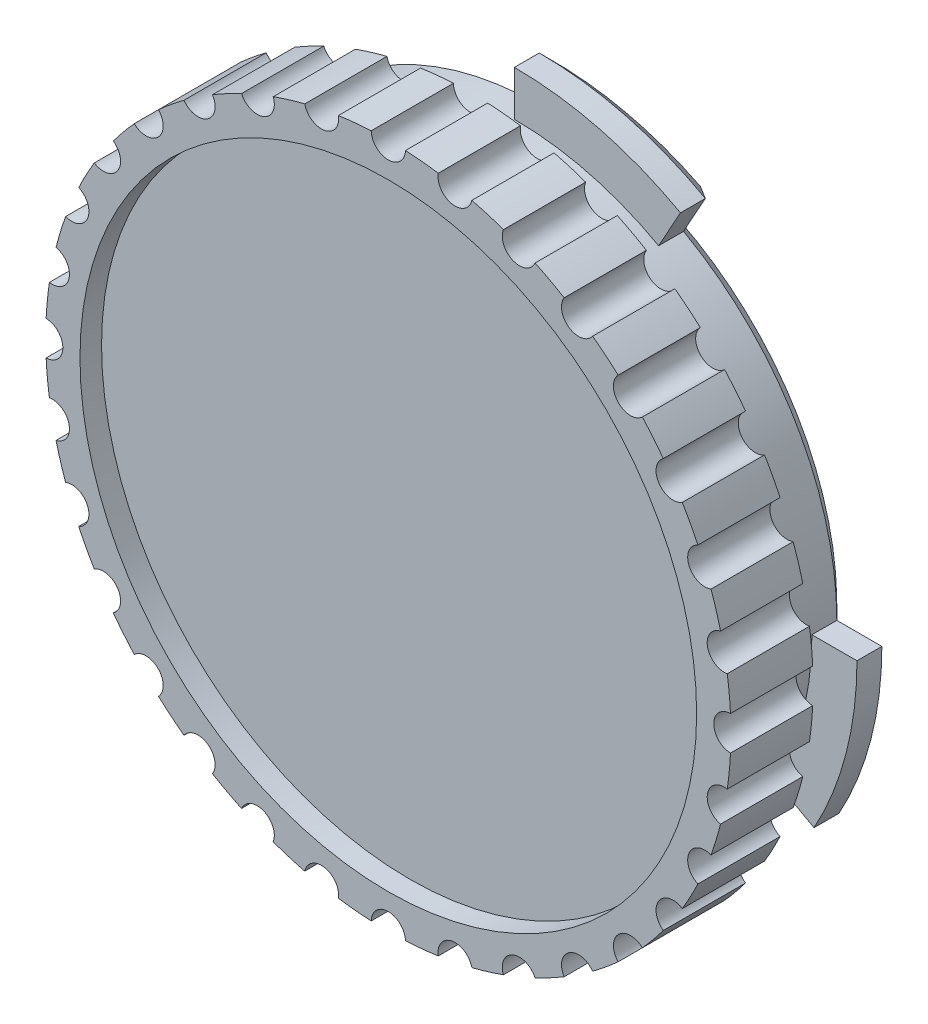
ISO-10303-21;
HEADER;
FILE_DESCRIPTION(('STEP AP214'),'2;1');
FILE_NAME('part.step','',(''),(''),'','','');
FILE_SCHEMA(('AUTOMOTIVE_DESIGN { 1 0 10303 214 1 1 1 1 }'));
ENDSEC;
DATA;
#1=APPLICATION_CONTEXT('core data for automotive mechanical design processes');
#2=APPLICATION_PROTOCOL_DEFINITION('international standard','automotive_design',2000,#1);
#3=PRODUCT_CONTEXT('',#1,'mechanical');
#4=PRODUCT('Part','Part','',(#3));
#5=PRODUCT_RELATED_PRODUCT_CATEGORY('part','',(#4));
#6=PRODUCT_DEFINITION_FORMATION('','',#4);
#7=PRODUCT_DEFINITION_CONTEXT('part definition',#1,'design');
#8=PRODUCT_DEFINITION('design','',#6,#7);
#9=PRODUCT_DEFINITION_SHAPE('','',#8);
#10=(LENGTH_UNIT() NAMED_UNIT(*) SI_UNIT(.MILLI.,.METRE.));
#11=(NAMED_UNIT(*) PLANE_ANGLE_UNIT() SI_UNIT($,.RADIAN.));
#12=(NAMED_UNIT(*) SI_UNIT($,.STERADIAN.) SOLID_ANGLE_UNIT());
#13=UNCERTAINTY_MEASURE_WITH_UNIT(LENGTH_MEASURE(1.E-05),#10,'distance_accuracy_value','');
#14=(GEOMETRIC_REPRESENTATION_CONTEXT(3) GLOBAL_UNCERTAINTY_ASSIGNED_CONTEXT((#13)) GLOBAL_UNIT_ASSIGNED_CONTEXT((#10,
#11,#12)) REPRESENTATION_CONTEXT('',''));
#15=CARTESIAN_POINT('',(0.,0.,0.));
#16=DIRECTION('',(0.,0.,1.));
#17=DIRECTION('',(1.,0.,0.));
#18=AXIS2_PLACEMENT_3D('',#15,#16,#17);
#19=CARTESIAN_POINT('',(0.,0.,6.62));
#20=DIRECTION('',(0.,0.,1.));
#21=DIRECTION('',(1.,0.,0.));
#22=AXIS2_PLACEMENT_3D('',#19,#20,#21);
#23=PLANE('',#22);
#24=CARTESIAN_POINT('',(0.,0.,6.62));
#25=DIRECTION('',(0.,0.,1.));
#26=DIRECTION('',(1.,0.,0.));
#27=AXIS2_PLACEMENT_3D('',#24,#25,#26);
#28=CIRCLE('',#27,14.2875);
#29=CARTESIAN_POINT('',(14.2875,0.,6.62));
#30=VERTEX_POINT('',#29);
#31=EDGE_CURVE('E706',#30,#30,#28,.T.);
#32=ORIENTED_EDGE('',*,*,#31,.T.);
#33=EDGE_LOOP('',(#32));
#34=FACE_BOUND('',#33,.T.);
#35=ADVANCED_FACE('F40',(#34),#23,.T.);
#36=CARTESIAN_POINT('',(0.,0.,7.62));
#37=DIRECTION('',(0.,0.,-1.));
#38=DIRECTION('',(-1.,0.,0.));
#39=AXIS2_PLACEMENT_3D('',#36,#37,#38);
#40=CYLINDRICAL_SURFACE('',#39,15.875);
#41=CARTESIAN_POINT('',(0.,0.,3.81));
#42=DIRECTION('',(0.,0.,1.));
#43=DIRECTION('',(1.,0.,0.));
#44=AXIS2_PLACEMENT_3D('',#41,#42,#43);
#45=CIRCLE('',#44,15.875);
#46=CARTESIAN_POINT('',(-0.793501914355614,15.85515625,3.81));
#47=VERTEX_POINT('',#46);
#48=CARTESIAN_POINT('',(-2.31493254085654,15.7053084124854,3.81));
#49=VERTEX_POINT('',#48);
#50=EDGE_CURVE('E1090',#47,#49,#45,.T.);
#51=ORIENTED_EDGE('',*,*,#50,.T.);
#52=DIRECTION('',(0.,0.,1.));
#53=VECTOR('',#52,1.);
#54=CARTESIAN_POINT('',(-2.31493254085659,15.7053084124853,3.810006));
#55=LINE('',#54,#53);
#56=CARTESIAN_POINT('',(-2.3149325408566,15.7053084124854,7.62));
#57=VERTEX_POINT('',#56);
#58=EDGE_CURVE('E712',#49,#57,#55,.T.);
#59=ORIENTED_EDGE('',*,*,#58,.T.);
#60=CARTESIAN_POINT('',(0.,0.,7.62));
#61=DIRECTION('',(0.,0.,1.));
#62=DIRECTION('',(1.,0.,0.));
#63=AXIS2_PLACEMENT_3D('',#60,#61,#62);
#64=CIRCLE('',#63,15.875);
#65=CARTESIAN_POINT('',(-0.79350191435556,15.85515625,7.62));
#66=VERTEX_POINT('',#65);
#67=EDGE_CURVE('E1123',#66,#57,#64,.T.);
#68=ORIENTED_EDGE('',*,*,#67,.F.);
#69=DIRECTION('',(0.,0.,1.));
#70=VECTOR('',#69,1.);
#71=CARTESIAN_POINT('',(-0.793501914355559,15.85515625,3.810006));
#72=LINE('',#71,#70);
#73=EDGE_CURVE('E707',#66,#47,#72,.F.);
#74=ORIENTED_EDGE('',*,*,#73,.T.);
#75=EDGE_LOOP('',(#51,#59,#68,#74));
#76=FACE_BOUND('',#75,.T.);
#77=ADVANCED_FACE('F1597',(#76),#40,.T.);
#78=CARTESIAN_POINT('',(-3.87144253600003,15.3956993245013,7.62));
#79=VERTEX_POINT('',#78);
#80=CARTESIAN_POINT('',(-5.33440543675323,14.9519143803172,7.62));
#81=VERTEX_POINT('',#80);
#82=EDGE_CURVE('E717',#79,#81,#64,.T.);
#83=ORIENTED_EDGE('',*,*,#82,.F.);
#84=DIRECTION('',(0.,0.,1.));
#85=VECTOR('',#84,1.);
#86=CARTESIAN_POINT('',(-3.87144253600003,15.3956993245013,3.810006));
#87=LINE('',#86,#85);
#88=CARTESIAN_POINT('',(-3.87144253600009,15.3956993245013,3.81));
#89=VERTEX_POINT('',#88);
#90=EDGE_CURVE('E711',#79,#89,#87,.F.);
#91=ORIENTED_EDGE('',*,*,#90,.T.);
#92=CARTESIAN_POINT('',(-5.33440543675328,14.9519143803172,3.81));
#93=VERTEX_POINT('',#92);
#94=EDGE_CURVE('E1080',#89,#93,#45,.T.);
#95=ORIENTED_EDGE('',*,*,#94,.T.);
#96=DIRECTION('',(0.,0.,1.));
#97=VECTOR('',#96,1.);
#98=CARTESIAN_POINT('',(-5.33440543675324,14.9519143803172,3.810006));
#99=LINE('',#98,#97);
#100=EDGE_CURVE('E1076',#93,#81,#99,.T.);
#101=ORIENTED_EDGE('',*,*,#100,.T.);
#102=EDGE_LOOP('',(#83,#91,#95,#101));
#103=FACE_BOUND('',#102,.T.);
#104=ADVANCED_FACE('F1603',(#103),#40,.T.);
#105=CARTESIAN_POINT('',(-6.80060579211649,14.3445943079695,7.62));
#106=VERTEX_POINT('',#105);
#107=CARTESIAN_POINT('',(-8.14888012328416,13.6239266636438,7.62));
#108=VERTEX_POINT('',#107);
#109=EDGE_CURVE('E2628',#106,#108,#64,.T.);
#110=ORIENTED_EDGE('',*,*,#109,.F.);
#111=DIRECTION('',(0.,0.,1.));
#112=VECTOR('',#111,1.);
#113=CARTESIAN_POINT('',(-6.80060579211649,14.3445943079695,3.810006));
#114=LINE('',#113,#112);
#115=CARTESIAN_POINT('',(-6.80060579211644,14.3445943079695,3.81));
#116=VERTEX_POINT('',#115);
#117=EDGE_CURVE('E1072',#106,#116,#114,.F.);
#118=ORIENTED_EDGE('',*,*,#117,.T.);
#119=CARTESIAN_POINT('',(-8.14888012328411,13.6239266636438,3.81));
#120=VERTEX_POINT('',#119);
#121=EDGE_CURVE('E1068',#116,#120,#45,.T.);
#122=ORIENTED_EDGE('',*,*,#121,.T.);
#123=DIRECTION('',(0.,0.,1.));
#124=VECTOR('',#123,1.);
#125=CARTESIAN_POINT('',(-8.14888012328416,13.6239266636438,3.810006));
#126=LINE('',#125,#124);
#127=EDGE_CURVE('E1064',#120,#108,#126,.T.);
#128=ORIENTED_EDGE('',*,*,#127,.T.);
#129=EDGE_LOOP('',(#110,#118,#122,#128));
#130=FACE_BOUND('',#129,.T.);
#131=ADVANCED_FACE('F2398',(#130),#40,.T.);
#132=CARTESIAN_POINT('',(-9.46842558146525,12.7422345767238,7.62));
#133=VERTEX_POINT('',#132);
#134=CARTESIAN_POINT('',(-10.6501979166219,11.7723790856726,7.62));
#135=VERTEX_POINT('',#134);
#136=EDGE_CURVE('E2630',#133,#135,#64,.T.);
#137=ORIENTED_EDGE('',*,*,#136,.F.);
#138=DIRECTION('',(0.,0.,1.));
#139=VECTOR('',#138,1.);
#140=CARTESIAN_POINT('',(-9.46842558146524,12.7422345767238,3.810006));
#141=LINE('',#140,#139);
#142=CARTESIAN_POINT('',(-9.46842558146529,12.7422345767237,3.81));
#143=VERTEX_POINT('',#142);
#144=EDGE_CURVE('E1060',#133,#143,#141,.F.);
#145=ORIENTED_EDGE('',*,*,#144,.T.);
#146=CARTESIAN_POINT('',(-10.6501979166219,11.7723790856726,3.81));
#147=VERTEX_POINT('',#146);
#148=EDGE_CURVE('E1056',#143,#147,#45,.T.);
#149=ORIENTED_EDGE('',*,*,#148,.T.);
#150=DIRECTION('',(0.,0.,1.));
#151=VECTOR('',#150,1.);
#152=CARTESIAN_POINT('',(-10.6501979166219,11.7723790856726,3.810006));
#153=LINE('',#152,#151);
#154=EDGE_CURVE('E1052',#147,#135,#153,.T.);
#155=ORIENTED_EDGE('',*,*,#154,.T.);
#156=EDGE_LOOP('',(#137,#145,#149,#155));
#157=FACE_BOUND('',#156,.T.);
#158=ADVANCED_FACE('F2389',(#157),#40,.T.);
#159=CARTESIAN_POINT('',(-11.7723790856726,10.6501979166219,7.62));
#160=VERTEX_POINT('',#159);
#161=CARTESIAN_POINT('',(-12.7422345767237,9.46842558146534,7.62));
#162=VERTEX_POINT('',#161);
#163=EDGE_CURVE('E2638',#160,#162,#64,.T.);
#164=ORIENTED_EDGE('',*,*,#163,.F.);
#165=DIRECTION('',(0.,0.,1.));
#166=VECTOR('',#165,1.);
#167=CARTESIAN_POINT('',(-11.7723790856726,10.6501979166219,3.810006));
#168=LINE('',#167,#166);
#169=CARTESIAN_POINT('',(-11.7723790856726,10.6501979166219,3.81));
#170=VERTEX_POINT('',#169);
#171=EDGE_CURVE('E1048',#160,#170,#168,.F.);
#172=ORIENTED_EDGE('',*,*,#171,.T.);
#173=CARTESIAN_POINT('',(-12.7422345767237,9.46842558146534,3.81));
#174=VERTEX_POINT('',#173);
#175=EDGE_CURVE('E1044',#170,#174,#45,.T.);
#176=ORIENTED_EDGE('',*,*,#175,.T.);
#177=DIRECTION('',(0.,0.,1.));
#178=VECTOR('',#177,1.);
#179=CARTESIAN_POINT('',(-12.7422345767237,9.46842558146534,3.810006));
#180=LINE('',#179,#178);
#181=EDGE_CURVE('E1040',#174,#162,#180,.T.);
#182=ORIENTED_EDGE('',*,*,#181,.T.);
#183=EDGE_LOOP('',(#164,#172,#176,#182));
#184=FACE_BOUND('',#183,.T.);
#185=ADVANCED_FACE('F2380',(#184),#40,.T.);
#186=CARTESIAN_POINT('',(-13.6239266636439,8.14888012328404,7.62));
#187=VERTEX_POINT('',#186);
#188=CARTESIAN_POINT('',(-14.3445943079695,6.80060579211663,7.62));
#189=VERTEX_POINT('',#188);
#190=EDGE_CURVE('E2644',#187,#189,#64,.T.);
#191=ORIENTED_EDGE('',*,*,#190,.F.);
#192=DIRECTION('',(0.,0.,1.));
#193=VECTOR('',#192,1.);
#194=CARTESIAN_POINT('',(-13.6239266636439,8.14888012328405,3.810006));
#195=LINE('',#194,#193);
#196=CARTESIAN_POINT('',(-13.6239266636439,8.14888012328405,3.81));
#197=VERTEX_POINT('',#196);
#198=EDGE_CURVE('E1036',#187,#197,#195,.F.);
#199=ORIENTED_EDGE('',*,*,#198,.T.);
#200=CARTESIAN_POINT('',(-14.3445943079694,6.80060579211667,3.81));
#201=VERTEX_POINT('',#200);
#202=EDGE_CURVE('E1032',#197,#201,#45,.T.);
#203=ORIENTED_EDGE('',*,*,#202,.T.);
#204=DIRECTION('',(0.,0.,1.));
#205=VECTOR('',#204,1.);
#206=CARTESIAN_POINT('',(-14.3445943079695,6.80060579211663,3.810006));
#207=LINE('',#206,#205);
#208=EDGE_CURVE('E1028',#201,#189,#207,.T.);
#209=ORIENTED_EDGE('',*,*,#208,.T.);
#210=EDGE_LOOP('',(#191,#199,#203,#209));
#211=FACE_BOUND('',#210,.T.);
#212=ADVANCED_FACE('F2371',(#211),#40,.T.);
#213=CARTESIAN_POINT('',(-14.9519143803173,5.33440543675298,7.62));
#214=VERTEX_POINT('',#213);
#215=CARTESIAN_POINT('',(-15.3956993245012,3.87144253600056,7.62));
#216=VERTEX_POINT('',#215);
#217=EDGE_CURVE('E2593',#214,#216,#64,.T.);
#218=ORIENTED_EDGE('',*,*,#217,.F.);
#219=DIRECTION('',(0.,0.,1.));
#220=VECTOR('',#219,1.);
#221=CARTESIAN_POINT('',(-14.9519143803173,5.33440543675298,3.810006));
#222=LINE('',#221,#220);
#223=CARTESIAN_POINT('',(-14.9519143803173,5.33440543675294,3.81));
#224=VERTEX_POINT('',#223);
#225=EDGE_CURVE('E1024',#214,#224,#222,.F.);
#226=ORIENTED_EDGE('',*,*,#225,.T.);
#227=CARTESIAN_POINT('',(-15.3956993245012,3.87144253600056,3.81));
#228=VERTEX_POINT('',#227);
#229=EDGE_CURVE('E1020',#224,#228,#45,.T.);
#230=ORIENTED_EDGE('',*,*,#229,.T.);
#231=DIRECTION('',(0.,0.,1.));
#232=VECTOR('',#231,1.);
#233=CARTESIAN_POINT('',(-15.3956993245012,3.87144253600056,3.810006));
#234=LINE('',#233,#232);
#235=EDGE_CURVE('E1016',#228,#216,#234,.T.);
#236=ORIENTED_EDGE('',*,*,#235,.T.);
#237=EDGE_LOOP('',(#218,#226,#230,#236));
#238=FACE_BOUND('',#237,.T.);
#239=ADVANCED_FACE('F2362',(#238),#40,.T.);
#240=CARTESIAN_POINT('',(-15.7053084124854,2.31493254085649,7.62));
#241=VERTEX_POINT('',#240);
#242=CARTESIAN_POINT('',(-15.85515625,0.793501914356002,7.62));
#243=VERTEX_POINT('',#242);
#244=EDGE_CURVE('E2590',#241,#243,#64,.T.);
#245=ORIENTED_EDGE('',*,*,#244,.F.);
#246=DIRECTION('',(0.,0.,1.));
#247=VECTOR('',#246,1.);
#248=CARTESIAN_POINT('',(-15.7053084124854,2.31493254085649,3.810006));
#249=LINE('',#248,#247);
#250=CARTESIAN_POINT('',(-15.7053084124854,2.31493254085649,3.81));
#251=VERTEX_POINT('',#250);
#252=EDGE_CURVE('E1012',#241,#251,#249,.F.);
#253=ORIENTED_EDGE('',*,*,#252,.T.);
#254=CARTESIAN_POINT('',(-15.85515625,0.793501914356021,3.81));
#255=VERTEX_POINT('',#254);
#256=EDGE_CURVE('E1008',#251,#255,#45,.T.);
#257=ORIENTED_EDGE('',*,*,#256,.T.);
#258=DIRECTION('',(0.,0.,1.));
#259=VECTOR('',#258,1.);
#260=CARTESIAN_POINT('',(-15.85515625,0.793501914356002,3.810006));
#261=LINE('',#260,#259);
#262=EDGE_CURVE('E1004',#255,#243,#261,.T.);
#263=ORIENTED_EDGE('',*,*,#262,.T.);
#264=EDGE_LOOP('',(#245,#253,#257,#263));
#265=FACE_BOUND('',#264,.T.);
#266=ADVANCED_FACE('F2353',(#265),#40,.T.);
#267=CARTESIAN_POINT('',(-15.85515625,-0.79350191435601,7.62));
#268=VERTEX_POINT('',#267);
#269=CARTESIAN_POINT('',(-15.7053084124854,-2.31493254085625,7.62));
#270=VERTEX_POINT('',#269);
#271=EDGE_CURVE('E2592',#268,#270,#64,.T.);
#272=ORIENTED_EDGE('',*,*,#271,.F.);
#273=DIRECTION('',(0.,0.,1.));
#274=VECTOR('',#273,1.);
#275=CARTESIAN_POINT('',(-15.85515625,-0.793501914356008,3.810006));
#276=LINE('',#275,#274);
#277=CARTESIAN_POINT('',(-15.85515625,-0.793501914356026,3.81));
#278=VERTEX_POINT('',#277);
#279=EDGE_CURVE('E1000',#268,#278,#276,.F.);
#280=ORIENTED_EDGE('',*,*,#279,.T.);
#281=CARTESIAN_POINT('',(-15.7053084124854,-2.31493254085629,3.81));
#282=VERTEX_POINT('',#281);
#283=EDGE_CURVE('E996',#278,#282,#45,.T.);
#284=ORIENTED_EDGE('',*,*,#283,.T.);
#285=DIRECTION('',(0.,0.,1.));
#286=VECTOR('',#285,1.);
#287=CARTESIAN_POINT('',(-15.7053084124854,-2.31493254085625,3.810006));
#288=LINE('',#287,#286);
#289=EDGE_CURVE('E992',#282,#270,#288,.T.);
#290=ORIENTED_EDGE('',*,*,#289,.T.);
#291=EDGE_LOOP('',(#272,#280,#284,#290));
#292=FACE_BOUND('',#291,.T.);
#293=ADVANCED_FACE('F2344',(#292),#40,.T.);
#294=CARTESIAN_POINT('',(-15.3956993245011,-3.87144253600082,7.62));
#295=VERTEX_POINT('',#294);
#296=CARTESIAN_POINT('',(-14.9519143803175,-5.33440543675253,7.62));
#297=VERTEX_POINT('',#296);
#298=EDGE_CURVE('E2612',#295,#297,#64,.T.);
#299=ORIENTED_EDGE('',*,*,#298,.F.);
#300=DIRECTION('',(0.,0.,1.));
#301=VECTOR('',#300,1.);
#302=CARTESIAN_POINT('',(-15.3956993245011,-3.87144253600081,3.810006));
#303=LINE('',#302,#301);
#304=CARTESIAN_POINT('',(-15.3956993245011,-3.87144253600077,3.81));
#305=VERTEX_POINT('',#304);
#306=EDGE_CURVE('E988',#295,#305,#303,.F.);
#307=ORIENTED_EDGE('',*,*,#306,.T.);
#308=CARTESIAN_POINT('',(-14.9519143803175,-5.33440543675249,3.81));
#309=VERTEX_POINT('',#308);
#310=EDGE_CURVE('E984',#305,#309,#45,.T.);
#311=ORIENTED_EDGE('',*,*,#310,.T.);
#312=DIRECTION('',(0.,0.,1.));
#313=VECTOR('',#312,1.);
#314=CARTESIAN_POINT('',(-14.9519143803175,-5.33440543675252,3.810006));
#315=LINE('',#314,#313);
#316=EDGE_CURVE('E980',#309,#297,#315,.T.);
#317=ORIENTED_EDGE('',*,*,#316,.T.);
#318=EDGE_LOOP('',(#299,#307,#311,#317));
#319=FACE_BOUND('',#318,.T.);
#320=ADVANCED_FACE('F2335',(#319),#40,.T.);
#321=CARTESIAN_POINT('',(-14.3445943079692,-6.80060579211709,7.62));
#322=VERTEX_POINT('',#321);
#323=CARTESIAN_POINT('',(-13.6239266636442,-8.14888012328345,7.62));
#324=VERTEX_POINT('',#323);
#325=EDGE_CURVE('E2633',#322,#324,#64,.T.);
#326=ORIENTED_EDGE('',*,*,#325,.F.);
#327=DIRECTION('',(0.,0.,1.));
#328=VECTOR('',#327,1.);
#329=CARTESIAN_POINT('',(-14.3445943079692,-6.80060579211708,3.810006));
#330=LINE('',#329,#328);
#331=CARTESIAN_POINT('',(-14.3445943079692,-6.80060579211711,3.81));
#332=VERTEX_POINT('',#331);
#333=EDGE_CURVE('E976',#322,#332,#330,.F.);
#334=ORIENTED_EDGE('',*,*,#333,.T.);
#335=CARTESIAN_POINT('',(-13.6239266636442,-8.14888012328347,3.81));
#336=VERTEX_POINT('',#335);
#337=EDGE_CURVE('E972',#332,#336,#45,.T.);
#338=ORIENTED_EDGE('',*,*,#337,.T.);
#339=DIRECTION('',(0.,0.,1.));
#340=VECTOR('',#339,1.);
#341=CARTESIAN_POINT('',(-13.6239266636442,-8.14888012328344,3.810006));
#342=LINE('',#341,#340);
#343=EDGE_CURVE('E968',#336,#324,#342,.T.);
#344=ORIENTED_EDGE('',*,*,#343,.T.);
#345=EDGE_LOOP('',(#326,#334,#338,#344));
#346=FACE_BOUND('',#345,.T.);
#347=ADVANCED_FACE('F2326',(#346),#40,.T.);
#348=CARTESIAN_POINT('',(-12.7422345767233,-9.46842558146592,7.62));
#349=VERTEX_POINT('',#348);
#350=CARTESIAN_POINT('',(-11.7723790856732,-10.6501979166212,7.62));
#351=VERTEX_POINT('',#350);
#352=EDGE_CURVE('E2576',#349,#351,#64,.T.);
#353=ORIENTED_EDGE('',*,*,#352,.F.);
#354=DIRECTION('',(0.,0.,1.));
#355=VECTOR('',#354,1.);
#356=CARTESIAN_POINT('',(-12.7422345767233,-9.46842558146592,3.810006));
#357=LINE('',#356,#355);
#358=CARTESIAN_POINT('',(-12.7422345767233,-9.46842558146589,3.81));
#359=VERTEX_POINT('',#358);
#360=EDGE_CURVE('E964',#349,#359,#357,.F.);
#361=ORIENTED_EDGE('',*,*,#360,.T.);
#362=CARTESIAN_POINT('',(-11.7723790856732,-10.6501979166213,3.81));
#363=VERTEX_POINT('',#362);
#364=EDGE_CURVE('E960',#359,#363,#45,.T.);
#365=ORIENTED_EDGE('',*,*,#364,.T.);
#366=DIRECTION('',(0.,0.,1.));
#367=VECTOR('',#366,1.);
#368=CARTESIAN_POINT('',(-11.7723790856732,-10.6501979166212,3.810006));
#369=LINE('',#368,#367);
#370=EDGE_CURVE('E956',#363,#351,#369,.T.);
#371=ORIENTED_EDGE('',*,*,#370,.T.);
#372=EDGE_LOOP('',(#353,#361,#365,#371));
#373=FACE_BOUND('',#372,.T.);
#374=ADVANCED_FACE('F2317',(#373),#40,.T.);
#375=CARTESIAN_POINT('',(-10.6501979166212,-11.7723790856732,7.62));
#376=VERTEX_POINT('',#375);
#377=CARTESIAN_POINT('',(-9.4684255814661,-12.7422345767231,7.62));
#378=VERTEX_POINT('',#377);
#379=EDGE_CURVE('E2572',#376,#378,#64,.T.);
#380=ORIENTED_EDGE('',*,*,#379,.F.);
#381=DIRECTION('',(0.,0.,1.));
#382=VECTOR('',#381,1.);
#383=CARTESIAN_POINT('',(-10.6501979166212,-11.7723790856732,3.810006));
#384=LINE('',#383,#382);
#385=CARTESIAN_POINT('',(-10.6501979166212,-11.7723790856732,3.81));
#386=VERTEX_POINT('',#385);
#387=EDGE_CURVE('E952',#376,#386,#384,.F.);
#388=ORIENTED_EDGE('',*,*,#387,.T.);
#389=CARTESIAN_POINT('',(-9.46842558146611,-12.7422345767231,3.81));
#390=VERTEX_POINT('',#389);
#391=EDGE_CURVE('E948',#386,#390,#45,.T.);
#392=ORIENTED_EDGE('',*,*,#391,.T.);
#393=DIRECTION('',(0.,0.,1.));
#394=VECTOR('',#393,1.);
#395=CARTESIAN_POINT('',(-9.4684255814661,-12.7422345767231,3.810006));
#396=LINE('',#395,#394);
#397=EDGE_CURVE('E944',#390,#378,#396,.T.);
#398=ORIENTED_EDGE('',*,*,#397,.T.);
#399=EDGE_LOOP('',(#380,#388,#392,#398));
#400=FACE_BOUND('',#399,.T.);
#401=ADVANCED_FACE('F2308',(#400),#40,.T.);
#402=CARTESIAN_POINT('',(-8.14888012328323,-13.6239266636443,7.62));
#403=VERTEX_POINT('',#402);
#404=CARTESIAN_POINT('',(-6.80060579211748,-14.3445943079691,7.62));
#405=VERTEX_POINT('',#404);
#406=EDGE_CURVE('E2575',#403,#405,#64,.T.);
#407=ORIENTED_EDGE('',*,*,#406,.F.);
#408=DIRECTION('',(0.,0.,1.));
#409=VECTOR('',#408,1.);
#410=CARTESIAN_POINT('',(-8.14888012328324,-13.6239266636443,3.810006));
#411=LINE('',#410,#409);
#412=CARTESIAN_POINT('',(-8.14888012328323,-13.6239266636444,3.81));
#413=VERTEX_POINT('',#412);
#414=EDGE_CURVE('E940',#403,#413,#411,.F.);
#415=ORIENTED_EDGE('',*,*,#414,.T.);
#416=CARTESIAN_POINT('',(-6.80060579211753,-14.344594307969,3.81));
#417=VERTEX_POINT('',#416);
#418=EDGE_CURVE('E936',#413,#417,#45,.T.);
#419=ORIENTED_EDGE('',*,*,#418,.T.);
#420=DIRECTION('',(0.,0.,1.));
#421=VECTOR('',#420,1.);
#422=CARTESIAN_POINT('',(-6.80060579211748,-14.3445943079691,3.810006));
#423=LINE('',#422,#421);
#424=EDGE_CURVE('E932',#417,#405,#423,.T.);
#425=ORIENTED_EDGE('',*,*,#424,.T.);
#426=EDGE_LOOP('',(#407,#415,#419,#425));
#427=FACE_BOUND('',#426,.T.);
#428=ADVANCED_FACE('F2299',(#427),#40,.T.);
#429=CARTESIAN_POINT('',(-5.33440543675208,-14.9519143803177,7.62));
#430=VERTEX_POINT('',#429);
#431=CARTESIAN_POINT('',(-3.87144253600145,-15.3956993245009,7.62));
#432=VERTEX_POINT('',#431);
#433=EDGE_CURVE('E2607',#430,#432,#64,.T.);
#434=ORIENTED_EDGE('',*,*,#433,.F.);
#435=DIRECTION('',(0.,0.,1.));
#436=VECTOR('',#435,1.);
#437=CARTESIAN_POINT('',(-5.33440543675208,-14.9519143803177,3.810006));
#438=LINE('',#437,#436);
#439=CARTESIAN_POINT('',(-5.33440543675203,-14.9519143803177,3.81));
#440=VERTEX_POINT('',#439);
#441=EDGE_CURVE('E928',#430,#440,#438,.F.);
#442=ORIENTED_EDGE('',*,*,#441,.T.);
#443=CARTESIAN_POINT('',(-3.87144253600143,-15.3956993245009,3.81));
#444=VERTEX_POINT('',#443);
#445=EDGE_CURVE('E924',#440,#444,#45,.T.);
#446=ORIENTED_EDGE('',*,*,#445,.T.);
#447=DIRECTION('',(0.,0.,1.));
#448=VECTOR('',#447,1.);
#449=CARTESIAN_POINT('',(-3.87144253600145,-15.3956993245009,3.810006));
#450=LINE('',#449,#448);
#451=EDGE_CURVE('E920',#444,#432,#450,.T.);
#452=ORIENTED_EDGE('',*,*,#451,.T.);
#453=EDGE_LOOP('',(#434,#442,#446,#452));
#454=FACE_BOUND('',#453,.T.);
#455=ADVANCED_FACE('F2290',(#454),#40,.T.);
#456=CARTESIAN_POINT('',(-2.31493254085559,-15.7053084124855,7.62));
#457=VERTEX_POINT('',#456);
#458=CARTESIAN_POINT('',(-0.793501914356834,-15.8551562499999,7.62));
#459=VERTEX_POINT('',#458);
#460=EDGE_CURVE('E2609',#457,#459,#64,.T.);
#461=ORIENTED_EDGE('',*,*,#460,.F.);
#462=DIRECTION('',(0.,0.,1.));
#463=VECTOR('',#462,1.);
#464=CARTESIAN_POINT('',(-2.31493254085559,-15.7053084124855,3.810006));
#465=LINE('',#464,#463);
#466=CARTESIAN_POINT('',(-2.31493254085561,-15.7053084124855,3.81));
#467=VERTEX_POINT('',#466);
#468=EDGE_CURVE('E916',#457,#467,#465,.F.);
#469=ORIENTED_EDGE('',*,*,#468,.T.);
#470=CARTESIAN_POINT('',(-0.79350191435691,-15.8551562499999,3.81));
#471=VERTEX_POINT('',#470);
#472=EDGE_CURVE('E912',#467,#471,#45,.T.);
#473=ORIENTED_EDGE('',*,*,#472,.T.);
#474=DIRECTION('',(0.,0.,1.));
#475=VECTOR('',#474,1.);
#476=CARTESIAN_POINT('',(-0.793501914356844,-15.8551562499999,3.810006));
#477=LINE('',#476,#475);
#478=EDGE_CURVE('E908',#471,#459,#477,.T.);
#479=ORIENTED_EDGE('',*,*,#478,.T.);
#480=EDGE_LOOP('',(#461,#469,#473,#479));
#481=FACE_BOUND('',#480,.T.);
#482=ADVANCED_FACE('F2281',(#481),#40,.T.);
#483=CARTESIAN_POINT('',(0.793501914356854,-15.8551562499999,7.62));
#484=VERTEX_POINT('',#483);
#485=CARTESIAN_POINT('',(2.31493254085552,-15.7053084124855,7.62));
#486=VERTEX_POINT('',#485);
#487=EDGE_CURVE('E2699',#484,#486,#64,.T.);
#488=ORIENTED_EDGE('',*,*,#487,.F.);
#489=DIRECTION('',(0.,0.,1.));
#490=VECTOR('',#489,1.);
#491=CARTESIAN_POINT('',(0.793501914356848,-15.8551562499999,3.810006));
#492=LINE('',#491,#490);
#493=CARTESIAN_POINT('',(0.793501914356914,-15.8551562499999,3.81));
#494=VERTEX_POINT('',#493);
#495=EDGE_CURVE('E904',#484,#494,#492,.F.);
#496=ORIENTED_EDGE('',*,*,#495,.T.);
#497=CARTESIAN_POINT('',(2.31493254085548,-15.7053084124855,3.81));
#498=VERTEX_POINT('',#497);
#499=EDGE_CURVE('E900',#494,#498,#45,.T.);
#500=ORIENTED_EDGE('',*,*,#499,.T.);
#501=DIRECTION('',(0.,0.,1.));
#502=VECTOR('',#501,1.);
#503=CARTESIAN_POINT('',(2.31493254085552,-15.7053084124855,3.810006));
#504=LINE('',#503,#502);
#505=EDGE_CURVE('E896',#498,#486,#504,.T.);
#506=ORIENTED_EDGE('',*,*,#505,.T.);
#507=EDGE_LOOP('',(#488,#496,#500,#506));
#508=FACE_BOUND('',#507,.T.);
#509=ADVANCED_FACE('F2272',(#508),#40,.T.);
#510=CARTESIAN_POINT('',(3.87144253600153,-15.3956993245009,7.62));
#511=VERTEX_POINT('',#510);
#512=CARTESIAN_POINT('',(5.33440543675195,-14.9519143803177,7.62));
#513=VERTEX_POINT('',#512);
#514=EDGE_CURVE('E2701',#511,#513,#64,.T.);
#515=ORIENTED_EDGE('',*,*,#514,.F.);
#516=DIRECTION('',(0.,0.,1.));
#517=VECTOR('',#516,1.);
#518=CARTESIAN_POINT('',(3.87144253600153,-15.3956993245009,3.810006));
#519=LINE('',#518,#517);
#520=CARTESIAN_POINT('',(3.87144253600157,-15.3956993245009,3.81));
#521=VERTEX_POINT('',#520);
#522=EDGE_CURVE('E892',#511,#521,#519,.F.);
#523=ORIENTED_EDGE('',*,*,#522,.T.);
#524=CARTESIAN_POINT('',(5.33440543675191,-14.9519143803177,3.81));
#525=VERTEX_POINT('',#524);
#526=EDGE_CURVE('E888',#521,#525,#45,.T.);
#527=ORIENTED_EDGE('',*,*,#526,.T.);
#528=DIRECTION('',(0.,0.,1.));
#529=VECTOR('',#528,1.);
#530=CARTESIAN_POINT('',(5.33440543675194,-14.9519143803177,3.810006));
#531=LINE('',#530,#529);
#532=EDGE_CURVE('E884',#525,#513,#531,.T.);
#533=ORIENTED_EDGE('',*,*,#532,.T.);
#534=EDGE_LOOP('',(#515,#523,#527,#533));
#535=FACE_BOUND('',#534,.T.);
#536=ADVANCED_FACE('F2263',(#535),#40,.T.);
#537=CARTESIAN_POINT('',(6.80060579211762,-14.344594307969,7.62));
#538=VERTEX_POINT('',#537);
#539=CARTESIAN_POINT('',(8.14888012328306,-13.6239266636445,7.62));
#540=VERTEX_POINT('',#539);
#541=EDGE_CURVE('E2697',#538,#540,#64,.T.);
#542=ORIENTED_EDGE('',*,*,#541,.F.);
#543=DIRECTION('',(0.,0.,1.));
#544=VECTOR('',#543,1.);
#545=CARTESIAN_POINT('',(6.80060579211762,-14.344594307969,3.810006));
#546=LINE('',#545,#544);
#547=CARTESIAN_POINT('',(6.80060579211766,-14.344594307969,3.81));
#548=VERTEX_POINT('',#547);
#549=EDGE_CURVE('E880',#538,#548,#546,.F.);
#550=ORIENTED_EDGE('',*,*,#549,.T.);
#551=CARTESIAN_POINT('',(8.14888012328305,-13.6239266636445,3.81));
#552=VERTEX_POINT('',#551);
#553=EDGE_CURVE('E876',#548,#552,#45,.T.);
#554=ORIENTED_EDGE('',*,*,#553,.T.);
#555=DIRECTION('',(0.,0.,1.));
#556=VECTOR('',#555,1.);
#557=CARTESIAN_POINT('',(8.14888012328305,-13.6239266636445,3.810006));
#558=LINE('',#557,#556);
#559=EDGE_CURVE('E872',#552,#540,#558,.T.);
#560=ORIENTED_EDGE('',*,*,#559,.T.);
#561=EDGE_LOOP('',(#542,#550,#554,#560));
#562=FACE_BOUND('',#561,.T.);
#563=ADVANCED_FACE('F2254',(#562),#40,.T.);
#564=CARTESIAN_POINT('',(9.46842558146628,-12.742234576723,7.62));
#565=VERTEX_POINT('',#564);
#566=CARTESIAN_POINT('',(10.650197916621,-11.7723790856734,7.62));
#567=VERTEX_POINT('',#566);
#568=EDGE_CURVE('E2695',#565,#567,#64,.T.);
#569=ORIENTED_EDGE('',*,*,#568,.F.);
#570=DIRECTION('',(0.,0.,1.));
#571=VECTOR('',#570,1.);
#572=CARTESIAN_POINT('',(9.46842558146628,-12.742234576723,3.810006));
#573=LINE('',#572,#571);
#574=CARTESIAN_POINT('',(9.46842558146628,-12.742234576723,3.81));
#575=VERTEX_POINT('',#574);
#576=EDGE_CURVE('E868',#565,#575,#573,.F.);
#577=ORIENTED_EDGE('',*,*,#576,.T.);
#578=CARTESIAN_POINT('',(10.650197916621,-11.7723790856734,3.81));
#579=VERTEX_POINT('',#578);
#580=EDGE_CURVE('E864',#575,#579,#45,.T.);
#581=ORIENTED_EDGE('',*,*,#580,.T.);
#582=DIRECTION('',(0.,0.,1.));
#583=VECTOR('',#582,1.);
#584=CARTESIAN_POINT('',(10.650197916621,-11.7723790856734,3.810006));
#585=LINE('',#584,#583);
#586=EDGE_CURVE('E860',#579,#567,#585,.T.);
#587=ORIENTED_EDGE('',*,*,#586,.T.);
#588=EDGE_LOOP('',(#569,#577,#581,#587));
#589=FACE_BOUND('',#588,.T.);
#590=ADVANCED_FACE('F2245',(#589),#40,.T.);
#591=CARTESIAN_POINT('',(11.7723790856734,-10.650197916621,7.62));
#592=VERTEX_POINT('',#591);
#593=CARTESIAN_POINT('',(12.7422345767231,-9.46842558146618,7.62));
#594=VERTEX_POINT('',#593);
#595=EDGE_CURVE('E2588',#592,#594,#64,.T.);
#596=ORIENTED_EDGE('',*,*,#595,.F.);
#597=DIRECTION('',(0.,0.,1.));
#598=VECTOR('',#597,1.);
#599=CARTESIAN_POINT('',(11.7723790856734,-10.650197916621,3.810006));
#600=LINE('',#599,#598);
#601=CARTESIAN_POINT('',(11.7723790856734,-10.650197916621,3.81));
#602=VERTEX_POINT('',#601);
#603=EDGE_CURVE('E856',#592,#602,#600,.F.);
#604=ORIENTED_EDGE('',*,*,#603,.T.);
#605=CARTESIAN_POINT('',(12.7422345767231,-9.46842558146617,3.81));
#606=VERTEX_POINT('',#605);
#607=EDGE_CURVE('E852',#602,#606,#45,.T.);
#608=ORIENTED_EDGE('',*,*,#607,.T.);
#609=DIRECTION('',(0.,0.,1.));
#610=VECTOR('',#609,1.);
#611=CARTESIAN_POINT('',(12.7422345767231,-9.46842558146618,3.810006));
#612=LINE('',#611,#610);
#613=EDGE_CURVE('E848',#606,#594,#612,.T.);
#614=ORIENTED_EDGE('',*,*,#613,.T.);
#615=EDGE_LOOP('',(#596,#604,#608,#614));
#616=FACE_BOUND('',#615,.T.);
#617=ADVANCED_FACE('F2236',(#616),#40,.T.);
#618=CARTESIAN_POINT('',(13.6239266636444,-8.14888012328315,7.62));
#619=VERTEX_POINT('',#618);
#620=CARTESIAN_POINT('',(14.3445943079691,-6.8006057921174,7.62));
#621=VERTEX_POINT('',#620);
#622=EDGE_CURVE('E2586',#619,#621,#64,.T.);
#623=ORIENTED_EDGE('',*,*,#622,.F.);
#624=DIRECTION('',(0.,0.,1.));
#625=VECTOR('',#624,1.);
#626=CARTESIAN_POINT('',(13.6239266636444,-8.14888012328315,3.810006));
#627=LINE('',#626,#625);
#628=CARTESIAN_POINT('',(13.6239266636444,-8.14888012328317,3.81));
#629=VERTEX_POINT('',#628);
#630=EDGE_CURVE('E844',#619,#629,#627,.F.);
#631=ORIENTED_EDGE('',*,*,#630,.T.);
#632=CARTESIAN_POINT('',(14.3445943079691,-6.80060579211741,3.81));
#633=VERTEX_POINT('',#632);
#634=EDGE_CURVE('E840',#629,#633,#45,.T.);
#635=ORIENTED_EDGE('',*,*,#634,.T.);
#636=DIRECTION('',(0.,0.,1.));
#637=VECTOR('',#636,1.);
#638=CARTESIAN_POINT('',(14.3445943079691,-6.8006057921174,3.810006));
#639=LINE('',#638,#637);
#640=EDGE_CURVE('E836',#633,#621,#639,.T.);
#641=ORIENTED_EDGE('',*,*,#640,.T.);
#642=EDGE_LOOP('',(#623,#631,#635,#641));
#643=FACE_BOUND('',#642,.T.);
#644=ADVANCED_FACE('F2227',(#643),#40,.T.);
#645=CARTESIAN_POINT('',(14.9519143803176,-5.33440543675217,7.62));
#646=VERTEX_POINT('',#645);
#647=CARTESIAN_POINT('',(15.395699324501,-3.87144253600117,7.62));
#648=VERTEX_POINT('',#647);
#649=EDGE_CURVE('E2568',#646,#648,#64,.T.);
#650=ORIENTED_EDGE('',*,*,#649,.F.);
#651=DIRECTION('',(0.,0.,1.));
#652=VECTOR('',#651,1.);
#653=CARTESIAN_POINT('',(14.9519143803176,-5.33440543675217,3.810006));
#654=LINE('',#653,#652);
#655=CARTESIAN_POINT('',(14.9519143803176,-5.33440543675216,3.81));
#656=VERTEX_POINT('',#655);
#657=EDGE_CURVE('E832',#646,#656,#654,.F.);
#658=ORIENTED_EDGE('',*,*,#657,.T.);
#659=CARTESIAN_POINT('',(15.395699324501,-3.87144253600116,3.81));
#660=VERTEX_POINT('',#659);
#661=EDGE_CURVE('E828',#656,#660,#45,.T.);
#662=ORIENTED_EDGE('',*,*,#661,.T.);
#663=DIRECTION('',(0.,0.,1.));
#664=VECTOR('',#663,1.);
#665=CARTESIAN_POINT('',(15.395699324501,-3.87144253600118,3.810006));
#666=LINE('',#665,#664);
#667=EDGE_CURVE('E824',#660,#648,#666,.T.);
#668=ORIENTED_EDGE('',*,*,#667,.T.);
#669=EDGE_LOOP('',(#650,#658,#662,#668));
#670=FACE_BOUND('',#669,.T.);
#671=ADVANCED_FACE('F2218',(#670),#40,.T.);
#672=CARTESIAN_POINT('',(15.7053084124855,-2.31493254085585,7.62));
#673=VERTEX_POINT('',#672);
#674=CARTESIAN_POINT('',(15.85515625,-0.793501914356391,7.62));
#675=VERTEX_POINT('',#674);
#676=EDGE_CURVE('E1114',#673,#675,#64,.T.);
#677=ORIENTED_EDGE('',*,*,#676,.F.);
#678=DIRECTION('',(0.,0.,1.));
#679=VECTOR('',#678,1.);
#680=CARTESIAN_POINT('',(15.7053084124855,-2.31493254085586,3.810006));
#681=LINE('',#680,#679);
#682=CARTESIAN_POINT('',(15.7053084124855,-2.31493254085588,3.81));
#683=VERTEX_POINT('',#682);
#684=EDGE_CURVE('E820',#673,#683,#681,.F.);
#685=ORIENTED_EDGE('',*,*,#684,.T.);
#686=CARTESIAN_POINT('',(15.85515625,-0.793501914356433,3.81));
#687=VERTEX_POINT('',#686);
#688=EDGE_CURVE('E816',#683,#687,#45,.T.);
#689=ORIENTED_EDGE('',*,*,#688,.T.);
#690=DIRECTION('',(0.,0.,1.));
#691=VECTOR('',#690,1.);
#692=CARTESIAN_POINT('',(15.85515625,-0.793501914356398,3.810006));
#693=LINE('',#692,#691);
#694=EDGE_CURVE('E812',#687,#675,#693,.T.);
#695=ORIENTED_EDGE('',*,*,#694,.T.);
#696=EDGE_LOOP('',(#677,#685,#689,#695));
#697=FACE_BOUND('',#696,.T.);
#698=ADVANCED_FACE('F2209',(#697),#40,.T.);
#699=CARTESIAN_POINT('',(15.85515625,0.793501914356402,7.62));
#700=VERTEX_POINT('',#699);
#701=CARTESIAN_POINT('',(15.7053084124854,2.31493254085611,7.62));
#702=VERTEX_POINT('',#701);
#703=EDGE_CURVE('E1109',#700,#702,#64,.T.);
#704=ORIENTED_EDGE('',*,*,#703,.F.);
#705=DIRECTION('',(0.,0.,1.));
#706=VECTOR('',#705,1.);
#707=CARTESIAN_POINT('',(15.85515625,0.7935019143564,3.810006));
#708=LINE('',#707,#706);
#709=CARTESIAN_POINT('',(15.85515625,0.793501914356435,3.81));
#710=VERTEX_POINT('',#709);
#711=EDGE_CURVE('E808',#700,#710,#708,.F.);
#712=ORIENTED_EDGE('',*,*,#711,.T.);
#713=CARTESIAN_POINT('',(15.7053084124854,2.31493254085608,3.81));
#714=VERTEX_POINT('',#713);
#715=EDGE_CURVE('E804',#710,#714,#45,.T.);
#716=ORIENTED_EDGE('',*,*,#715,.T.);
#717=DIRECTION('',(0.,0.,1.));
#718=VECTOR('',#717,1.);
#719=CARTESIAN_POINT('',(15.7053084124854,2.31493254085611,3.810006));
#720=LINE('',#719,#718);
#721=EDGE_CURVE('E800',#714,#702,#720,.T.);
#722=ORIENTED_EDGE('',*,*,#721,.T.);
#723=EDGE_LOOP('',(#704,#712,#716,#722));
#724=FACE_BOUND('',#723,.T.);
#725=ADVANCED_FACE('F2200',(#724),#40,.T.);
#726=CARTESIAN_POINT('',(15.3956993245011,3.87144253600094,7.62));
#727=VERTEX_POINT('',#726);
#728=CARTESIAN_POINT('',(14.9519143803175,5.33440543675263,7.62));
#729=VERTEX_POINT('',#728);
#730=EDGE_CURVE('E1113',#727,#729,#64,.T.);
#731=ORIENTED_EDGE('',*,*,#730,.F.);
#732=DIRECTION('',(0.,0.,1.));
#733=VECTOR('',#732,1.);
#734=CARTESIAN_POINT('',(15.3956993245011,3.87144253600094,3.810006));
#735=LINE('',#734,#733);
#736=CARTESIAN_POINT('',(15.3956993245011,3.87144253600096,3.81));
#737=VERTEX_POINT('',#736);
#738=EDGE_CURVE('E796',#727,#737,#735,.F.);
#739=ORIENTED_EDGE('',*,*,#738,.T.);
#740=CARTESIAN_POINT('',(14.9519143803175,5.33440543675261,3.81));
#741=VERTEX_POINT('',#740);
#742=EDGE_CURVE('E792',#737,#741,#45,.T.);
#743=ORIENTED_EDGE('',*,*,#742,.T.);
#744=DIRECTION('',(0.,0.,1.));
#745=VECTOR('',#744,1.);
#746=CARTESIAN_POINT('',(14.9519143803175,5.33440543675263,3.810006));
#747=LINE('',#746,#745);
#748=EDGE_CURVE('E788',#741,#729,#747,.T.);
#749=ORIENTED_EDGE('',*,*,#748,.T.);
#750=EDGE_LOOP('',(#731,#739,#743,#749));
#751=FACE_BOUND('',#750,.T.);
#752=ADVANCED_FACE('F2191',(#751),#40,.T.);
#753=CARTESIAN_POINT('',(14.3445943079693,6.80060579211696,7.62));
#754=VERTEX_POINT('',#753);
#755=CARTESIAN_POINT('',(13.623926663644,8.14888012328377,7.62));
#756=VERTEX_POINT('',#755);
#757=EDGE_CURVE('E2758',#754,#756,#64,.T.);
#758=ORIENTED_EDGE('',*,*,#757,.F.);
#759=DIRECTION('',(0.,0.,1.));
#760=VECTOR('',#759,1.);
#761=CARTESIAN_POINT('',(14.3445943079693,6.80060579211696,3.810006));
#762=LINE('',#761,#760);
#763=CARTESIAN_POINT('',(14.3445943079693,6.80060579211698,3.81));
#764=VERTEX_POINT('',#763);
#765=EDGE_CURVE('E784',#754,#764,#762,.F.);
#766=ORIENTED_EDGE('',*,*,#765,.T.);
#767=CARTESIAN_POINT('',(13.623926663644,8.14888012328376,3.81));
#768=VERTEX_POINT('',#767);
#769=EDGE_CURVE('E780',#764,#768,#45,.T.);
#770=ORIENTED_EDGE('',*,*,#769,.T.);
#771=DIRECTION('',(0.,0.,1.));
#772=VECTOR('',#771,1.);
#773=CARTESIAN_POINT('',(13.623926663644,8.14888012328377,3.810006));
#774=LINE('',#773,#772);
#775=EDGE_CURVE('E776',#768,#756,#774,.T.);
#776=ORIENTED_EDGE('',*,*,#775,.T.);
#777=EDGE_LOOP('',(#758,#766,#770,#776));
#778=FACE_BOUND('',#777,.T.);
#779=ADVANCED_FACE('F2182',(#778),#40,.T.);
#780=CARTESIAN_POINT('',(12.7422345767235,9.46842558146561,7.62));
#781=VERTEX_POINT('',#780);
#782=CARTESIAN_POINT('',(11.7723790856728,10.6501979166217,7.62));
#783=VERTEX_POINT('',#782);
#784=EDGE_CURVE('E2756',#781,#783,#64,.T.);
#785=ORIENTED_EDGE('',*,*,#784,.F.);
#786=DIRECTION('',(0.,0.,1.));
#787=VECTOR('',#786,1.);
#788=CARTESIAN_POINT('',(12.7422345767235,9.46842558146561,3.810006));
#789=LINE('',#788,#787);
#790=CARTESIAN_POINT('',(12.7422345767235,9.46842558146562,3.81));
#791=VERTEX_POINT('',#790);
#792=EDGE_CURVE('E772',#781,#791,#789,.F.);
#793=ORIENTED_EDGE('',*,*,#792,.T.);
#794=CARTESIAN_POINT('',(11.7723790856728,10.6501979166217,3.81));
#795=VERTEX_POINT('',#794);
#796=EDGE_CURVE('E768',#791,#795,#45,.T.);
#797=ORIENTED_EDGE('',*,*,#796,.T.);
#798=DIRECTION('',(0.,0.,1.));
#799=VECTOR('',#798,1.);
#800=CARTESIAN_POINT('',(11.7723790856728,10.6501979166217,3.810006));
#801=LINE('',#800,#799);
#802=EDGE_CURVE('E764',#795,#783,#801,.T.);
#803=ORIENTED_EDGE('',*,*,#802,.T.);
#804=EDGE_LOOP('',(#785,#793,#797,#803));
#805=FACE_BOUND('',#804,.T.);
#806=ADVANCED_FACE('F2173',(#805),#40,.T.);
#807=CARTESIAN_POINT('',(10.6501979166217,11.7723790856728,7.62));
#808=VERTEX_POINT('',#807);
#809=CARTESIAN_POINT('',(9.46842558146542,12.7422345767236,7.62));
#810=VERTEX_POINT('',#809);
#811=EDGE_CURVE('E2605',#808,#810,#64,.T.);
#812=ORIENTED_EDGE('',*,*,#811,.F.);
#813=DIRECTION('',(0.,0.,1.));
#814=VECTOR('',#813,1.);
#815=CARTESIAN_POINT('',(10.6501979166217,11.7723790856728,3.810006));
#816=LINE('',#815,#814);
#817=CARTESIAN_POINT('',(10.6501979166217,11.7723790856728,3.81));
#818=VERTEX_POINT('',#817);
#819=EDGE_CURVE('E760',#808,#818,#816,.F.);
#820=ORIENTED_EDGE('',*,*,#819,.T.);
#821=CARTESIAN_POINT('',(9.4684255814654,12.7422345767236,3.81));
#822=VERTEX_POINT('',#821);
#823=EDGE_CURVE('E756',#818,#822,#45,.T.);
#824=ORIENTED_EDGE('',*,*,#823,.T.);
#825=DIRECTION('',(0.,0.,1.));
#826=VECTOR('',#825,1.);
#827=CARTESIAN_POINT('',(9.46842558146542,12.7422345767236,3.810006));
#828=LINE('',#827,#826);
#829=EDGE_CURVE('E752',#822,#810,#828,.T.);
#830=ORIENTED_EDGE('',*,*,#829,.T.);
#831=EDGE_LOOP('',(#812,#820,#824,#830));
#832=FACE_BOUND('',#831,.T.);
#833=ADVANCED_FACE('F2164',(#832),#40,.T.);
#834=CARTESIAN_POINT('',(8.14888012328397,13.6239266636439,7.62));
#835=VERTEX_POINT('',#834);
#836=CARTESIAN_POINT('',(6.80060579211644,14.3445943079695,7.62));
#837=VERTEX_POINT('',#836);
#838=EDGE_CURVE('E2603',#835,#837,#64,.T.);
#839=ORIENTED_EDGE('',*,*,#838,.F.);
#840=DIRECTION('',(0.,0.,1.));
#841=VECTOR('',#840,1.);
#842=CARTESIAN_POINT('',(8.14888012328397,13.6239266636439,3.810006));
#843=LINE('',#842,#841);
#844=CARTESIAN_POINT('',(8.14888012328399,13.6239266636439,3.81));
#845=VERTEX_POINT('',#844);
#846=EDGE_CURVE('E748',#835,#845,#843,.F.);
#847=ORIENTED_EDGE('',*,*,#846,.T.);
#848=CARTESIAN_POINT('',(6.8006057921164,14.3445943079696,3.81));
#849=VERTEX_POINT('',#848);
#850=EDGE_CURVE('E744',#845,#849,#45,.T.);
#851=ORIENTED_EDGE('',*,*,#850,.T.);
#852=DIRECTION('',(0.,0.,1.));
#853=VECTOR('',#852,1.);
#854=CARTESIAN_POINT('',(6.80060579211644,14.3445943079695,3.810006));
#855=LINE('',#854,#853);
#856=EDGE_CURVE('E740',#849,#837,#855,.T.);
#857=ORIENTED_EDGE('',*,*,#856,.T.);
#858=EDGE_LOOP('',(#839,#847,#851,#857));
#859=FACE_BOUND('',#858,.T.);
#860=ADVANCED_FACE('F2155',(#859),#40,.T.);
#861=CARTESIAN_POINT('',(5.33440543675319,14.9519143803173,7.62));
#862=VERTEX_POINT('',#861);
#863=CARTESIAN_POINT('',(3.87144253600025,15.3956993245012,7.62));
#864=VERTEX_POINT('',#863);
#865=EDGE_CURVE('E2599',#862,#864,#64,.T.);
#866=ORIENTED_EDGE('',*,*,#865,.F.);
#867=DIRECTION('',(0.,0.,1.));
#868=VECTOR('',#867,1.);
#869=CARTESIAN_POINT('',(5.33440543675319,14.9519143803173,3.810006));
#870=LINE('',#869,#868);
#871=CARTESIAN_POINT('',(5.33440543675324,14.9519143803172,3.81));
#872=VERTEX_POINT('',#871);
#873=EDGE_CURVE('E736',#862,#872,#870,.F.);
#874=ORIENTED_EDGE('',*,*,#873,.T.);
#875=CARTESIAN_POINT('',(3.87144253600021,15.3956993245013,3.81));
#876=VERTEX_POINT('',#875);
#877=EDGE_CURVE('E732',#872,#876,#45,.T.);
#878=ORIENTED_EDGE('',*,*,#877,.T.);
#879=DIRECTION('',(0.,0.,1.));
#880=VECTOR('',#879,1.);
#881=CARTESIAN_POINT('',(3.87144253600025,15.3956993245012,3.810006));
#882=LINE('',#881,#880);
#883=EDGE_CURVE('E728',#876,#864,#882,.T.);
#884=ORIENTED_EDGE('',*,*,#883,.T.);
#885=EDGE_LOOP('',(#866,#874,#878,#884));
#886=FACE_BOUND('',#885,.T.);
#887=ADVANCED_FACE('F1626',(#886),#40,.T.);
#888=CARTESIAN_POINT('',(0.,0.,3.81));
#889=DIRECTION('',(0.,0.,-1.));
#890=DIRECTION('',(-1.,0.,0.));
#891=AXIS2_PLACEMENT_3D('',#888,#889,#890);
#892=CYLINDRICAL_SURFACE('',#891,13.7875);
#893=DIRECTION('',(0.,0.,-1.));
#894=VECTOR('',#893,1.);
#895=CARTESIAN_POINT('',(0.,13.7875,3.81));
#896=LINE('',#895,#894);
#897=CARTESIAN_POINT('',(0.,13.7875,1.778));
#898=VERTEX_POINT('',#897);
#899=CARTESIAN_POINT('',(0.,13.7875,0.625000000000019));
#900=VERTEX_POINT('',#899);
#901=EDGE_CURVE('E696',#898,#900,#896,.T.);
#902=ORIENTED_EDGE('',*,*,#901,.T.);
#903=CARTESIAN_POINT('',(0.,0.,0.625000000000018));
#904=DIRECTION('',(0.,0.,1.));
#905=DIRECTION('',(1.,0.,0.));
#906=AXIS2_PLACEMENT_3D('',#903,#904,#905);
#907=CIRCLE('',#906,13.7875);
#908=CARTESIAN_POINT('',(-12.0588192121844,6.68431263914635,0.625000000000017));
#909=VERTEX_POINT('',#908);
#910=EDGE_CURVE('E1337',#900,#909,#907,.T.);
#911=ORIENTED_EDGE('',*,*,#910,.T.);
#912=DIRECTION('',(0.,0.,-1.));
#913=VECTOR('',#912,1.);
#914=CARTESIAN_POINT('',(-12.0588192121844,6.68431263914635,3.81));
#915=LINE('',#914,#913);
#916=CARTESIAN_POINT('',(-12.0588192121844,6.68431263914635,1.778));
#917=VERTEX_POINT('',#916);
#918=EDGE_CURVE('E677',#909,#917,#915,.F.);
#919=ORIENTED_EDGE('',*,*,#918,.T.);
#920=CARTESIAN_POINT('',(0.,0.,1.778));
#921=DIRECTION('',(0.,0.,1.));
#922=DIRECTION('',(0.,-1.,0.));
#923=AXIS2_PLACEMENT_3D('',#920,#921,#922);
#924=CIRCLE('',#923,13.7875);
#925=CARTESIAN_POINT('',(-13.7875,0.,1.77800000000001));
#926=VERTEX_POINT('',#925);
#927=EDGE_CURVE('E1252',#917,#926,#924,.T.);
#928=ORIENTED_EDGE('',*,*,#927,.T.);
#929=DIRECTION('',(0.,0.,-1.));
#930=VECTOR('',#929,1.);
#931=CARTESIAN_POINT('',(-13.7875,0.,3.81));
#932=LINE('',#931,#930);
#933=CARTESIAN_POINT('',(-13.7875,0.,0.625000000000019));
#934=VERTEX_POINT('',#933);
#935=EDGE_CURVE('E670',#926,#934,#932,.T.);
#936=ORIENTED_EDGE('',*,*,#935,.T.);
#937=CARTESIAN_POINT('',(0.,0.,0.625000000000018));
#938=DIRECTION('',(0.,0.,1.));
#939=DIRECTION('',(1.,0.,0.));
#940=AXIS2_PLACEMENT_3D('',#937,#938,#939);
#941=CIRCLE('',#940,13.7875);
#942=CARTESIAN_POINT('',(-6.68431263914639,-12.0588192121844,0.62500000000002));
#943=VERTEX_POINT('',#942);
#944=EDGE_CURVE('E1334',#934,#943,#941,.T.);
#945=ORIENTED_EDGE('',*,*,#944,.T.);
#946=DIRECTION('',(0.,0.,-1.));
#947=VECTOR('',#946,1.);
#948=CARTESIAN_POINT('',(-6.68431263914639,-12.0588192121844,3.81));
#949=LINE('',#948,#947);
#950=CARTESIAN_POINT('',(-6.68431263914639,-12.0588192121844,1.77800000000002));
#951=VERTEX_POINT('',#950);
#952=EDGE_CURVE('E651',#943,#951,#949,.F.);
#953=ORIENTED_EDGE('',*,*,#952,.T.);
#954=CARTESIAN_POINT('',(0.,0.,1.778));
#955=DIRECTION('',(0.,0.,1.));
#956=DIRECTION('',(0.,-1.,0.));
#957=AXIS2_PLACEMENT_3D('',#954,#955,#956);
#958=CIRCLE('',#957,13.7875);
#959=CARTESIAN_POINT('',(0.,-13.7875,1.77800000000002));
#960=VERTEX_POINT('',#959);
#961=EDGE_CURVE('E1255',#951,#960,#958,.T.);
#962=ORIENTED_EDGE('',*,*,#961,.T.);
#963=DIRECTION('',(0.,0.,-1.));
#964=VECTOR('',#963,1.);
#965=CARTESIAN_POINT('',(0.,-13.7875,3.81));
#966=LINE('',#965,#964);
#967=CARTESIAN_POINT('',(0.,-13.7875,0.625000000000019));
#968=VERTEX_POINT('',#967);
#969=EDGE_CURVE('E644',#960,#968,#966,.T.);
#970=ORIENTED_EDGE('',*,*,#969,.T.);
#971=CARTESIAN_POINT('',(0.,0.,0.625000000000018));
#972=DIRECTION('',(0.,0.,1.));
#973=DIRECTION('',(1.,0.,0.));
#974=AXIS2_PLACEMENT_3D('',#971,#972,#973);
#975=CIRCLE('',#974,13.7875);
#976=CARTESIAN_POINT('',(12.0588192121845,-6.68431263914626,0.625000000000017));
#977=VERTEX_POINT('',#976);
#978=EDGE_CURVE('E1331',#968,#977,#975,.T.);
#979=ORIENTED_EDGE('',*,*,#978,.T.);
#980=DIRECTION('',(0.,0.,-1.));
#981=VECTOR('',#980,1.);
#982=CARTESIAN_POINT('',(12.0588192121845,-6.68431263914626,3.81));
#983=LINE('',#982,#981);
#984=CARTESIAN_POINT('',(12.0588192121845,-6.68431263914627,1.77800000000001));
#985=VERTEX_POINT('',#984);
#986=EDGE_CURVE('E625',#977,#985,#983,.F.);
#987=ORIENTED_EDGE('',*,*,#986,.T.);
#988=CARTESIAN_POINT('',(0.,0.,1.778));
#989=DIRECTION('',(0.,0.,1.));
#990=DIRECTION('',(1.,0.,0.));
#991=AXIS2_PLACEMENT_3D('',#988,#989,#990);
#992=CIRCLE('',#991,13.7875);
#993=CARTESIAN_POINT('',(13.7875,1.45363276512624E-13,1.77800000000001));
#994=VERTEX_POINT('',#993);
#995=EDGE_CURVE('E1258',#985,#994,#992,.T.);
#996=ORIENTED_EDGE('',*,*,#995,.T.);
#997=DIRECTION('',(0.,0.,-1.));
#998=VECTOR('',#997,1.);
#999=CARTESIAN_POINT('',(13.7875,1.46623173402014E-13,3.81));
#1000=LINE('',#999,#998);
#1001=CARTESIAN_POINT('',(13.7875,1.46623173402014E-13,0.625000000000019));
#1002=VERTEX_POINT('',#1001);
#1003=EDGE_CURVE('E598',#994,#1002,#1000,.T.);
#1004=ORIENTED_EDGE('',*,*,#1003,.T.);
#1005=CARTESIAN_POINT('',(0.,0.,0.625000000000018));
#1006=DIRECTION('',(0.,0.,1.));
#1007=DIRECTION('',(1.,0.,0.));
#1008=AXIS2_PLACEMENT_3D('',#1005,#1006,#1007);
#1009=CIRCLE('',#1008,13.7875);
#1010=CARTESIAN_POINT('',(6.68431263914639,12.0588192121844,0.625000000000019));
#1011=VERTEX_POINT('',#1010);
#1012=EDGE_CURVE('E1328',#1002,#1011,#1009,.T.);
#1013=ORIENTED_EDGE('',*,*,#1012,.T.);
#1014=DIRECTION('',(0.,0.,-1.));
#1015=VECTOR('',#1014,1.);
#1016=CARTESIAN_POINT('',(6.68431263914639,12.0588192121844,3.81));
#1017=LINE('',#1016,#1015);
#1018=CARTESIAN_POINT('',(6.68431263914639,12.0588192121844,1.778));
#1019=VERTEX_POINT('',#1018);
#1020=EDGE_CURVE('E703',#1011,#1019,#1017,.F.);
#1021=ORIENTED_EDGE('',*,*,#1020,.T.);
#1022=CARTESIAN_POINT('',(0.,0.,1.778));
#1023=DIRECTION('',(0.,0.,1.));
#1024=DIRECTION('',(1.,0.,0.));
#1025=AXIS2_PLACEMENT_3D('',#1022,#1023,#1024);
#1026=CIRCLE('',#1025,13.7875);
#1027=EDGE_CURVE('E1093',#1019,#898,#1026,.T.);
#1028=ORIENTED_EDGE('',*,*,#1027,.T.);
#1029=EDGE_LOOP('',(#902,#911,#919,#928,#936,#945,#953,#962,#970,#979,#987,#996,#1004,#1013,
#1021,#1028));
#1030=FACE_BOUND('',#1029,.T.);
#1031=CARTESIAN_POINT('',(0.,0.,3.81));
#1032=DIRECTION('',(0.,0.,1.));
#1033=DIRECTION('',(1.,0.,0.));
#1034=AXIS2_PLACEMENT_3D('',#1031,#1032,#1033);
#1035=CIRCLE('',#1034,13.7875);
#1036=CARTESIAN_POINT('',(13.7875,0.,3.81));
#1037=VERTEX_POINT('',#1036);
#1038=EDGE_CURVE('E1118',#1037,#1037,#1035,.T.);
#1039=ORIENTED_EDGE('',*,*,#1038,.F.);
#1040=EDGE_LOOP('',(#1039));
#1041=FACE_BOUND('',#1040,.T.);
#1042=ADVANCED_FACE('F1550',(#1030,#1041),#892,.T.);
#1043=CARTESIAN_POINT('',(0.,0.,0.));
#1044=DIRECTION('',(0.,0.,1.));
#1045=DIRECTION('',(1.,0.,0.));
#1046=AXIS2_PLACEMENT_3D('',#1043,#1044,#1045);
#1047=PLANE('',#1046);
#1048=CARTESIAN_POINT('',(0.,0.,0.));
#1049=DIRECTION('',(0.,0.,1.));
#1050=DIRECTION('',(1.,0.,0.));
#1051=AXIS2_PLACEMENT_3D('',#1048,#1049,#1050);
#1052=CIRCLE('',#1051,11.2375);
#1053=CARTESIAN_POINT('',(-11.2375,0.,0.));
#1054=VERTEX_POINT('',#1053);
#1055=EDGE_CURVE('E1314',#1054,#1054,#1052,.T.);
#1056=ORIENTED_EDGE('',*,*,#1055,.T.);
#1057=EDGE_LOOP('',(#1056));
#1058=FACE_BOUND('',#1057,.T.);
#1059=CARTESIAN_POINT('',(0.,0.,0.));
#1060=DIRECTION('',(0.,0.,1.));
#1061=DIRECTION('',(1.,0.,0.));
#1062=AXIS2_PLACEMENT_3D('',#1059,#1060,#1061);
#1063=CIRCLE('',#1062,15.25);
#1064=CARTESIAN_POINT('',(0.625000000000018,15.2371872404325,0.));
#1065=VERTEX_POINT('',#1064);
#1066=CARTESIAN_POINT('',(6.8404976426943,13.6297502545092,0.));
#1067=VERTEX_POINT('',#1066);
#1068=EDGE_CURVE('E1307',#1065,#1067,#1063,.F.);
#1069=ORIENTED_EDGE('',*,*,#1068,.T.);
#1070=DIRECTION('',(-0.484809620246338,-0.874619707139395,0.));
#1071=VECTOR('',#1070,1.);
#1072=CARTESIAN_POINT('',(6.13767532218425,12.3618252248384,0.));
#1073=LINE('',#1072,#1071);
#1074=CARTESIAN_POINT('',(5.82747137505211,11.8022024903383,0.));
#1075=VERTEX_POINT('',#1074);
#1076=EDGE_CURVE('E1310',#1067,#1075,#1073,.T.);
#1077=ORIENTED_EDGE('',*,*,#1076,.T.);
#1078=CARTESIAN_POINT('',(0.,0.,0.));
#1079=DIRECTION('',(0.,0.,1.));
#1080=DIRECTION('',(1.,0.,0.));
#1081=AXIS2_PLACEMENT_3D('',#1078,#1079,#1080);
#1082=CIRCLE('',#1081,13.1625);
#1083=CARTESIAN_POINT('',(13.147653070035,-0.62499999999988,0.));
#1084=VERTEX_POINT('',#1083);
#1085=EDGE_CURVE('E1265',#1075,#1084,#1082,.F.);
#1086=ORIENTED_EDGE('',*,*,#1085,.T.);
#1087=DIRECTION('',(1.,0.,0.));
#1088=VECTOR('',#1087,1.);
#1089=CARTESIAN_POINT('',(15.875,-0.624999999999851,0.));
#1090=LINE('',#1089,#1088);
#1091=CARTESIAN_POINT('',(15.2371872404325,-0.624999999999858,0.));
#1092=VERTEX_POINT('',#1091);
#1093=EDGE_CURVE('E1268',#1084,#1092,#1090,.T.);
#1094=ORIENTED_EDGE('',*,*,#1093,.T.);
#1095=CARTESIAN_POINT('',(0.,0.,0.));
#1096=DIRECTION('',(0.,0.,1.));
#1097=DIRECTION('',(1.,0.,0.));
#1098=AXIS2_PLACEMENT_3D('',#1095,#1096,#1097);
#1099=CIRCLE('',#1098,15.25);
#1100=CARTESIAN_POINT('',(13.6297502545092,-6.84049764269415,0.));
#1101=VERTEX_POINT('',#1100);
#1102=EDGE_CURVE('E1271',#1092,#1101,#1099,.F.);
#1103=ORIENTED_EDGE('',*,*,#1102,.T.);
#1104=DIRECTION('',(-0.8746197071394,0.484809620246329,0.));
#1105=VECTOR('',#1104,1.);
#1106=CARTESIAN_POINT('',(12.3618252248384,-6.13767532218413,0.));
#1107=LINE('',#1106,#1105);
#1108=CARTESIAN_POINT('',(11.8022024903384,-5.82747137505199,0.));
#1109=VERTEX_POINT('',#1108);
#1110=EDGE_CURVE('E1274',#1101,#1109,#1107,.T.);
#1111=ORIENTED_EDGE('',*,*,#1110,.T.);
#1112=CARTESIAN_POINT('',(0.,0.,0.));
#1113=DIRECTION('',(0.,0.,1.));
#1114=DIRECTION('',(1.,0.,0.));
#1115=AXIS2_PLACEMENT_3D('',#1112,#1113,#1114);
#1116=CIRCLE('',#1115,13.1625);
#1117=CARTESIAN_POINT('',(-0.625000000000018,-13.147653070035,0.));
#1118=VERTEX_POINT('',#1117);
#1119=EDGE_CURVE('E1277',#1109,#1118,#1116,.F.);
#1120=ORIENTED_EDGE('',*,*,#1119,.T.);
#1121=DIRECTION('',(0.,-1.,0.));
#1122=VECTOR('',#1121,1.);
#1123=CARTESIAN_POINT('',(-0.625000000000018,-15.875,0.));
#1124=LINE('',#1123,#1122);
#1125=CARTESIAN_POINT('',(-0.625000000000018,-15.2371872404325,0.));
#1126=VERTEX_POINT('',#1125);
#1127=EDGE_CURVE('E1280',#1118,#1126,#1124,.T.);
#1128=ORIENTED_EDGE('',*,*,#1127,.T.);
#1129=CARTESIAN_POINT('',(0.,0.,0.));
#1130=DIRECTION('',(0.,0.,1.));
#1131=DIRECTION('',(1.,0.,0.));
#1132=AXIS2_PLACEMENT_3D('',#1129,#1130,#1131);
#1133=CIRCLE('',#1132,15.25);
#1134=CARTESIAN_POINT('',(-6.84049764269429,-13.6297502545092,0.));
#1135=VERTEX_POINT('',#1134);
#1136=EDGE_CURVE('E1283',#1126,#1135,#1133,.F.);
#1137=ORIENTED_EDGE('',*,*,#1136,.T.);
#1138=DIRECTION('',(0.484809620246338,0.874619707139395,0.));
#1139=VECTOR('',#1138,1.);
#1140=CARTESIAN_POINT('',(-6.13767532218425,-12.3618252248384,0.));
#1141=LINE('',#1140,#1139);
#1142=CARTESIAN_POINT('',(-5.82747137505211,-11.8022024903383,0.));
#1143=VERTEX_POINT('',#1142);
#1144=EDGE_CURVE('E1286',#1135,#1143,#1141,.T.);
#1145=ORIENTED_EDGE('',*,*,#1144,.T.);
#1146=CARTESIAN_POINT('',(0.,0.,0.));
#1147=DIRECTION('',(0.,0.,1.));
#1148=DIRECTION('',(1.,0.,0.));
#1149=AXIS2_PLACEMENT_3D('',#1146,#1147,#1148);
#1150=CIRCLE('',#1149,13.1625);
#1151=CARTESIAN_POINT('',(-13.147653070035,0.624999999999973,0.));
#1152=VERTEX_POINT('',#1151);
#1153=EDGE_CURVE('E1289',#1143,#1152,#1150,.F.);
#1154=ORIENTED_EDGE('',*,*,#1153,.T.);
#1155=DIRECTION('',(-1.,0.,0.));
#1156=VECTOR('',#1155,1.);
#1157=CARTESIAN_POINT('',(-15.875,0.624999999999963,0.));
#1158=LINE('',#1157,#1156);
#1159=CARTESIAN_POINT('',(-15.2371872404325,0.624999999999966,0.));
#1160=VERTEX_POINT('',#1159);
#1161=EDGE_CURVE('E1292',#1152,#1160,#1158,.T.);
#1162=ORIENTED_EDGE('',*,*,#1161,.T.);
#1163=CARTESIAN_POINT('',(0.,0.,0.));
#1164=DIRECTION('',(0.,0.,1.));
#1165=DIRECTION('',(1.,0.,0.));
#1166=AXIS2_PLACEMENT_3D('',#1163,#1164,#1165);
#1167=CIRCLE('',#1166,15.25);
#1168=CARTESIAN_POINT('',(-13.6297502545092,6.84049764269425,0.));
#1169=VERTEX_POINT('',#1168);
#1170=EDGE_CURVE('E1295',#1160,#1169,#1167,.F.);
#1171=ORIENTED_EDGE('',*,*,#1170,.T.);
#1172=DIRECTION('',(0.874619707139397,-0.484809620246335,0.));
#1173=VECTOR('',#1172,1.);
#1174=CARTESIAN_POINT('',(-12.3618252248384,6.13767532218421,0.));
#1175=LINE('',#1174,#1173);
#1176=CARTESIAN_POINT('',(-11.8022024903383,5.82747137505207,0.));
#1177=VERTEX_POINT('',#1176);
#1178=EDGE_CURVE('E1298',#1169,#1177,#1175,.T.);
#1179=ORIENTED_EDGE('',*,*,#1178,.T.);
#1180=CARTESIAN_POINT('',(0.,0.,0.));
#1181=DIRECTION('',(0.,0.,1.));
#1182=DIRECTION('',(1.,0.,0.));
#1183=AXIS2_PLACEMENT_3D('',#1180,#1181,#1182);
#1184=CIRCLE('',#1183,13.1625);
#1185=CARTESIAN_POINT('',(0.625000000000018,13.147653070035,0.));
#1186=VERTEX_POINT('',#1185);
#1187=EDGE_CURVE('E1301',#1177,#1186,#1184,.F.);
#1188=ORIENTED_EDGE('',*,*,#1187,.T.);
#1189=DIRECTION('',(0.,1.,0.));
#1190=VECTOR('',#1189,1.);
#1191=CARTESIAN_POINT('',(0.625000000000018,15.875,0.));
#1192=LINE('',#1191,#1190);
#1193=EDGE_CURVE('E1304',#1186,#1065,#1192,.T.);
#1194=ORIENTED_EDGE('',*,*,#1193,.T.);
#1195=EDGE_LOOP('',(#1069,#1077,#1086,#1094,#1103,#1111,#1120,#1128,#1137,#1145,#1154,#1162,
#1171,#1179,#1188,#1194));
#1196=FACE_BOUND('',#1195,.T.);
#1197=ADVANCED_FACE('F1624',(#1058,#1196),#1047,.F.);
#1198=CARTESIAN_POINT('',(2.31493254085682,15.7053084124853,7.62));
#1199=VERTEX_POINT('',#1198);
#1200=CARTESIAN_POINT('',(0.793501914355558,15.85515625,7.62));
#1201=VERTEX_POINT('',#1200);
#1202=EDGE_CURVE('E2597',#1199,#1201,#64,.T.);
#1203=ORIENTED_EDGE('',*,*,#1202,.F.);
#1204=DIRECTION('',(0.,0.,1.));
#1205=VECTOR('',#1204,1.);
#1206=CARTESIAN_POINT('',(2.31493254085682,15.7053084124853,3.810006));
#1207=LINE('',#1206,#1205);
#1208=CARTESIAN_POINT('',(2.31493254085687,15.7053084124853,3.81));
#1209=VERTEX_POINT('',#1208);
#1210=EDGE_CURVE('E724',#1199,#1209,#1207,.F.);
#1211=ORIENTED_EDGE('',*,*,#1210,.T.);
#1212=CARTESIAN_POINT('',(0.793501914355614,15.85515625,3.81));
#1213=VERTEX_POINT('',#1212);
#1214=EDGE_CURVE('E718',#1209,#1213,#45,.T.);
#1215=ORIENTED_EDGE('',*,*,#1214,.T.);
#1216=DIRECTION('',(0.,0.,1.));
#1217=VECTOR('',#1216,1.);
#1218=CARTESIAN_POINT('',(0.793501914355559,15.85515625,3.810006));
#1219=LINE('',#1218,#1217);
#1220=EDGE_CURVE('E713',#1213,#1201,#1219,.T.);
#1221=ORIENTED_EDGE('',*,*,#1220,.T.);
#1222=EDGE_LOOP('',(#1203,#1211,#1215,#1221));
#1223=FACE_BOUND('',#1222,.T.);
#1224=ADVANCED_FACE('F1606',(#1223),#40,.T.);
#1225=CARTESIAN_POINT('',(0.,0.,7.62));
#1226=DIRECTION('',(0.,0.,1.));
#1227=DIRECTION('',(1.,0.,0.));
#1228=AXIS2_PLACEMENT_3D('',#1225,#1226,#1227);
#1229=PLANE('',#1228);
#1230=CARTESIAN_POINT('',(-3.09705886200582,15.5699663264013,7.62));
#1231=DIRECTION('',(0.,0.,1.));
#1232=DIRECTION('',(1.,0.,0.));
#1233=AXIS2_PLACEMENT_3D('',#1230,#1231,#1232);
#1234=CIRCLE('',#1233,0.79375);
#1235=EDGE_CURVE('E1083',#79,#57,#1234,.T.);
#1236=ORIENTED_EDGE('',*,*,#1235,.F.);
#1237=ORIENTED_EDGE('',*,*,#82,.T.);
#1238=CARTESIAN_POINT('',(-6.07509948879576,14.6665875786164,7.62));
#1239=DIRECTION('',(0.,0.,1.));
#1240=DIRECTION('',(1.,0.,0.));
#1241=AXIS2_PLACEMENT_3D('',#1238,#1239,#1240);
#1242=CIRCLE('',#1241,0.793749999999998);
#1243=EDGE_CURVE('E1071',#106,#81,#1242,.T.);
#1244=ORIENTED_EDGE('',*,*,#1243,.F.);
#1245=ORIENTED_EDGE('',*,*,#109,.T.);
#1246=CARTESIAN_POINT('',(-8.81967744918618,13.1995800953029,7.62));
#1247=DIRECTION('',(0.,0.,1.));
#1248=DIRECTION('',(1.,0.,0.));
#1249=AXIS2_PLACEMENT_3D('',#1246,#1247,#1248);
#1250=CIRCLE('',#1249,0.793749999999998);
#1251=EDGE_CURVE('E1059',#133,#108,#1250,.T.);
#1252=ORIENTED_EDGE('',*,*,#1251,.F.);
#1253=ORIENTED_EDGE('',*,*,#136,.T.);
#1254=CARTESIAN_POINT('',(-11.2253201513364,11.2253201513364,7.62));
#1255=DIRECTION('',(0.,0.,1.));
#1256=DIRECTION('',(1.,0.,0.));
#1257=AXIS2_PLACEMENT_3D('',#1254,#1255,#1256);
#1258=CIRCLE('',#1257,0.793750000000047);
#1259=EDGE_CURVE('E1047',#160,#135,#1258,.T.);
#1260=ORIENTED_EDGE('',*,*,#1259,.F.);
#1261=ORIENTED_EDGE('',*,*,#163,.T.);
#1262=CARTESIAN_POINT('',(-13.1995800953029,8.81967744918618,7.62));
#1263=DIRECTION('',(0.,0.,1.));
#1264=DIRECTION('',(1.,0.,0.));
#1265=AXIS2_PLACEMENT_3D('',#1262,#1263,#1264);
#1266=CIRCLE('',#1265,0.793750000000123);
#1267=EDGE_CURVE('E1035',#187,#162,#1266,.T.);
#1268=ORIENTED_EDGE('',*,*,#1267,.F.);
#1269=ORIENTED_EDGE('',*,*,#190,.T.);
#1270=CARTESIAN_POINT('',(-14.6665875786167,6.0750994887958,7.62));
#1271=DIRECTION('',(0.,0.,1.));
#1272=DIRECTION('',(1.,0.,0.));
#1273=AXIS2_PLACEMENT_3D('',#1270,#1271,#1272);
#1274=CIRCLE('',#1273,0.793750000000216);
#1275=EDGE_CURVE('E1023',#214,#189,#1274,.T.);
#1276=ORIENTED_EDGE('',*,*,#1275,.F.);
#1277=ORIENTED_EDGE('',*,*,#217,.T.);
#1278=CARTESIAN_POINT('',(-15.5699663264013,3.09705886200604,7.62));
#1279=DIRECTION('',(0.,0.,1.));
#1280=DIRECTION('',(1.,0.,0.));
#1281=AXIS2_PLACEMENT_3D('',#1278,#1279,#1280);
#1282=CIRCLE('',#1281,0.793750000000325);
#1283=EDGE_CURVE('E1011',#241,#216,#1282,.T.);
#1284=ORIENTED_EDGE('',*,*,#1283,.F.);
#1285=ORIENTED_EDGE('',*,*,#244,.T.);
#1286=CARTESIAN_POINT('',(-15.875,0.,7.62));
#1287=DIRECTION('',(0.,0.,1.));
#1288=DIRECTION('',(1.,0.,0.));
#1289=AXIS2_PLACEMENT_3D('',#1286,#1287,#1288);
#1290=CIRCLE('',#1289,0.793750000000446);
#1291=EDGE_CURVE('E999',#268,#243,#1290,.T.);
#1292=ORIENTED_EDGE('',*,*,#1291,.F.);
#1293=ORIENTED_EDGE('',*,*,#271,.T.);
#1294=CARTESIAN_POINT('',(-15.5699663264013,-3.09705886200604,7.62));
#1295=DIRECTION('',(0.,0.,1.));
#1296=DIRECTION('',(1.,0.,0.));
#1297=AXIS2_PLACEMENT_3D('',#1294,#1295,#1296);
#1298=CIRCLE('',#1297,0.793750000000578);
#1299=EDGE_CURVE('E987',#295,#270,#1298,.T.);
#1300=ORIENTED_EDGE('',*,*,#1299,.F.);
#1301=ORIENTED_EDGE('',*,*,#298,.T.);
#1302=CARTESIAN_POINT('',(-14.6665875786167,-6.07509948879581,7.62));
#1303=DIRECTION('',(0.,0.,1.));
#1304=DIRECTION('',(1.,0.,0.));
#1305=AXIS2_PLACEMENT_3D('',#1302,#1303,#1304);
#1306=CIRCLE('',#1305,0.793750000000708);
#1307=EDGE_CURVE('E975',#322,#297,#1306,.T.);
#1308=ORIENTED_EDGE('',*,*,#1307,.F.);
#1309=ORIENTED_EDGE('',*,*,#325,.T.);
#1310=CARTESIAN_POINT('',(-13.1995800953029,-8.81967744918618,7.62));
#1311=DIRECTION('',(0.,0.,1.));
#1312=DIRECTION('',(1.,0.,0.));
#1313=AXIS2_PLACEMENT_3D('',#1310,#1311,#1312);
#1314=CIRCLE('',#1313,0.793750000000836);
#1315=EDGE_CURVE('E963',#349,#324,#1314,.T.);
#1316=ORIENTED_EDGE('',*,*,#1315,.F.);
#1317=ORIENTED_EDGE('',*,*,#352,.T.);
#1318=CARTESIAN_POINT('',(-11.2253201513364,-11.2253201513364,7.62));
#1319=DIRECTION('',(0.,0.,1.));
#1320=DIRECTION('',(1.,0.,0.));
#1321=AXIS2_PLACEMENT_3D('',#1318,#1319,#1320);
#1322=CIRCLE('',#1321,0.793750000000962);
#1323=EDGE_CURVE('E951',#376,#351,#1322,.T.);
#1324=ORIENTED_EDGE('',*,*,#1323,.F.);
#1325=ORIENTED_EDGE('',*,*,#379,.T.);
#1326=CARTESIAN_POINT('',(-8.81967744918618,-13.1995800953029,7.62));
#1327=DIRECTION('',(0.,0.,1.));
#1328=DIRECTION('',(1.,0.,0.));
#1329=AXIS2_PLACEMENT_3D('',#1326,#1327,#1328);
#1330=CIRCLE('',#1329,0.793750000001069);
#1331=EDGE_CURVE('E939',#403,#378,#1330,.T.);
#1332=ORIENTED_EDGE('',*,*,#1331,.F.);
#1333=ORIENTED_EDGE('',*,*,#406,.T.);
#1334=CARTESIAN_POINT('',(-6.0750994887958,-14.6665875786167,7.62));
#1335=DIRECTION('',(0.,0.,1.));
#1336=DIRECTION('',(1.,0.,0.));
#1337=AXIS2_PLACEMENT_3D('',#1334,#1335,#1336);
#1338=CIRCLE('',#1337,0.793750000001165);
#1339=EDGE_CURVE('E927',#430,#405,#1338,.T.);
#1340=ORIENTED_EDGE('',*,*,#1339,.F.);
#1341=ORIENTED_EDGE('',*,*,#433,.T.);
#1342=CARTESIAN_POINT('',(-3.09705886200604,-15.5699663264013,7.62));
#1343=DIRECTION('',(0.,0.,1.));
#1344=DIRECTION('',(1.,0.,0.));
#1345=AXIS2_PLACEMENT_3D('',#1342,#1343,#1344);
#1346=CIRCLE('',#1345,0.793750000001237);
#1347=EDGE_CURVE('E915',#457,#432,#1346,.T.);
#1348=ORIENTED_EDGE('',*,*,#1347,.F.);
#1349=ORIENTED_EDGE('',*,*,#460,.T.);
#1350=CARTESIAN_POINT('',(0.,-15.875,7.62));
#1351=DIRECTION('',(0.,0.,1.));
#1352=DIRECTION('',(1.,0.,0.));
#1353=AXIS2_PLACEMENT_3D('',#1350,#1351,#1352);
#1354=CIRCLE('',#1353,0.793750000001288);
#1355=EDGE_CURVE('E903',#484,#459,#1354,.T.);
#1356=ORIENTED_EDGE('',*,*,#1355,.F.);
#1357=ORIENTED_EDGE('',*,*,#487,.T.);
#1358=CARTESIAN_POINT('',(3.09705886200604,-15.5699663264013,7.62));
#1359=DIRECTION('',(0.,0.,1.));
#1360=DIRECTION('',(1.,0.,0.));
#1361=AXIS2_PLACEMENT_3D('',#1358,#1359,#1360);
#1362=CIRCLE('',#1361,0.793750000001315);
#1363=EDGE_CURVE('E891',#511,#486,#1362,.T.);
#1364=ORIENTED_EDGE('',*,*,#1363,.F.);
#1365=ORIENTED_EDGE('',*,*,#514,.T.);
#1366=CARTESIAN_POINT('',(6.0750994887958,-14.6665875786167,7.62));
#1367=DIRECTION('',(0.,0.,1.));
#1368=DIRECTION('',(1.,0.,0.));
#1369=AXIS2_PLACEMENT_3D('',#1366,#1367,#1368);
#1370=CIRCLE('',#1369,0.793750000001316);
#1371=EDGE_CURVE('E879',#538,#513,#1370,.T.);
#1372=ORIENTED_EDGE('',*,*,#1371,.F.);
#1373=ORIENTED_EDGE('',*,*,#541,.T.);
#1374=CARTESIAN_POINT('',(8.81967744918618,-13.1995800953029,7.62));
#1375=DIRECTION('',(0.,0.,1.));
#1376=DIRECTION('',(1.,0.,0.));
#1377=AXIS2_PLACEMENT_3D('',#1374,#1375,#1376);
#1378=CIRCLE('',#1377,0.79375000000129);
#1379=EDGE_CURVE('E867',#565,#540,#1378,.T.);
#1380=ORIENTED_EDGE('',*,*,#1379,.F.);
#1381=ORIENTED_EDGE('',*,*,#568,.T.);
#1382=CARTESIAN_POINT('',(11.2253201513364,-11.2253201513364,7.62));
#1383=DIRECTION('',(0.,0.,1.));
#1384=DIRECTION('',(1.,0.,0.));
#1385=AXIS2_PLACEMENT_3D('',#1382,#1383,#1384);
#1386=CIRCLE('',#1385,0.793750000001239);
#1387=EDGE_CURVE('E855',#592,#567,#1386,.T.);
#1388=ORIENTED_EDGE('',*,*,#1387,.F.);
#1389=ORIENTED_EDGE('',*,*,#595,.T.);
#1390=CARTESIAN_POINT('',(13.1995800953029,-8.81967744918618,7.62));
#1391=DIRECTION('',(0.,0.,1.));
#1392=DIRECTION('',(1.,0.,0.));
#1393=AXIS2_PLACEMENT_3D('',#1390,#1391,#1392);
#1394=CIRCLE('',#1393,0.793750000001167);
#1395=EDGE_CURVE('E843',#619,#594,#1394,.T.);
#1396=ORIENTED_EDGE('',*,*,#1395,.F.);
#1397=ORIENTED_EDGE('',*,*,#622,.T.);
#1398=CARTESIAN_POINT('',(14.6665875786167,-6.0750994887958,7.62));
#1399=DIRECTION('',(0.,0.,1.));
#1400=DIRECTION('',(1.,0.,0.));
#1401=AXIS2_PLACEMENT_3D('',#1398,#1399,#1400);
#1402=CIRCLE('',#1401,0.793750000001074);
#1403=EDGE_CURVE('E831',#646,#621,#1402,.T.);
#1404=ORIENTED_EDGE('',*,*,#1403,.F.);
#1405=ORIENTED_EDGE('',*,*,#649,.T.);
#1406=CARTESIAN_POINT('',(15.5699663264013,-3.09705886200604,7.62));
#1407=DIRECTION('',(0.,0.,1.));
#1408=DIRECTION('',(1.,0.,0.));
#1409=AXIS2_PLACEMENT_3D('',#1406,#1407,#1408);
#1410=CIRCLE('',#1409,0.793750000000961);
#1411=EDGE_CURVE('E819',#673,#648,#1410,.T.);
#1412=ORIENTED_EDGE('',*,*,#1411,.F.);
#1413=ORIENTED_EDGE('',*,*,#676,.T.);
#1414=CARTESIAN_POINT('',(15.875,0.,7.62));
#1415=DIRECTION('',(0.,0.,1.));
#1416=DIRECTION('',(1.,0.,0.));
#1417=AXIS2_PLACEMENT_3D('',#1414,#1415,#1416);
#1418=CIRCLE('',#1417,0.79375000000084);
#1419=EDGE_CURVE('E807',#700,#675,#1418,.T.);
#1420=ORIENTED_EDGE('',*,*,#1419,.F.);
#1421=ORIENTED_EDGE('',*,*,#703,.T.);
#1422=CARTESIAN_POINT('',(15.5699663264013,3.09705886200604,7.62));
#1423=DIRECTION('',(0.,0.,1.));
#1424=DIRECTION('',(1.,0.,0.));
#1425=AXIS2_PLACEMENT_3D('',#1422,#1423,#1424);
#1426=CIRCLE('',#1425,0.793750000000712);
#1427=EDGE_CURVE('E795',#727,#702,#1426,.T.);
#1428=ORIENTED_EDGE('',*,*,#1427,.F.);
#1429=ORIENTED_EDGE('',*,*,#730,.T.);
#1430=CARTESIAN_POINT('',(14.6665875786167,6.0750994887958,7.62));
#1431=DIRECTION('',(0.,0.,1.));
#1432=DIRECTION('',(1.,0.,0.));
#1433=AXIS2_PLACEMENT_3D('',#1430,#1431,#1432);
#1434=CIRCLE('',#1433,0.79375000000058);
#1435=EDGE_CURVE('E783',#754,#729,#1434,.T.);
#1436=ORIENTED_EDGE('',*,*,#1435,.F.);
#1437=ORIENTED_EDGE('',*,*,#757,.T.);
#1438=CARTESIAN_POINT('',(13.1995800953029,8.81967744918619,7.62));
#1439=DIRECTION('',(0.,0.,1.));
#1440=DIRECTION('',(1.,0.,0.));
#1441=AXIS2_PLACEMENT_3D('',#1438,#1439,#1440);
#1442=CIRCLE('',#1441,0.79375000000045);
#1443=EDGE_CURVE('E771',#781,#756,#1442,.T.);
#1444=ORIENTED_EDGE('',*,*,#1443,.F.);
#1445=ORIENTED_EDGE('',*,*,#784,.T.);
#1446=CARTESIAN_POINT('',(11.2253201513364,11.2253201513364,7.62));
#1447=DIRECTION('',(0.,0.,1.));
#1448=DIRECTION('',(1.,0.,0.));
#1449=AXIS2_PLACEMENT_3D('',#1446,#1447,#1448);
#1450=CIRCLE('',#1449,0.793750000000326);
#1451=EDGE_CURVE('E759',#808,#783,#1450,.T.);
#1452=ORIENTED_EDGE('',*,*,#1451,.F.);
#1453=ORIENTED_EDGE('',*,*,#811,.T.);
#1454=CARTESIAN_POINT('',(8.81967744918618,13.1995800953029,7.62));
#1455=DIRECTION('',(0.,0.,1.));
#1456=DIRECTION('',(1.,0.,0.));
#1457=AXIS2_PLACEMENT_3D('',#1454,#1455,#1456);
#1458=CIRCLE('',#1457,0.793750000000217);
#1459=EDGE_CURVE('E747',#835,#810,#1458,.T.);
#1460=ORIENTED_EDGE('',*,*,#1459,.F.);
#1461=ORIENTED_EDGE('',*,*,#838,.T.);
#1462=CARTESIAN_POINT('',(6.07509948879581,14.6665875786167,7.62));
#1463=DIRECTION('',(0.,0.,1.));
#1464=DIRECTION('',(1.,0.,0.));
#1465=AXIS2_PLACEMENT_3D('',#1462,#1463,#1464);
#1466=CIRCLE('',#1465,0.79375);
#1467=EDGE_CURVE('E735',#862,#837,#1466,.T.);
#1468=ORIENTED_EDGE('',*,*,#1467,.F.);
#1469=ORIENTED_EDGE('',*,*,#865,.T.);
#1470=CARTESIAN_POINT('',(3.09705886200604,15.5699663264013,7.62));
#1471=DIRECTION('',(0.,0.,1.));
#1472=DIRECTION('',(1.,0.,0.));
#1473=AXIS2_PLACEMENT_3D('',#1470,#1471,#1472);
#1474=CIRCLE('',#1473,0.79375);
#1475=EDGE_CURVE('E722',#1199,#864,#1474,.T.);
#1476=ORIENTED_EDGE('',*,*,#1475,.F.);
#1477=ORIENTED_EDGE('',*,*,#1202,.T.);
#1478=CARTESIAN_POINT('',(0.,15.875,7.62));
#1479=DIRECTION('',(0.,0.,1.));
#1480=DIRECTION('',(1.,0.,0.));
#1481=AXIS2_PLACEMENT_3D('',#1478,#1479,#1480);
#1482=CIRCLE('',#1481,0.79375);
#1483=EDGE_CURVE('E719',#66,#1201,#1482,.T.);
#1484=ORIENTED_EDGE('',*,*,#1483,.F.);
#1485=ORIENTED_EDGE('',*,*,#67,.T.);
#1486=EDGE_LOOP('',(#1236,#1237,#1244,#1245,#1252,#1253,#1260,#1261,#1268,#1269,#1276,#1277,
#1284,#1285,#1292,#1293,#1300,#1301,#1308,#1309,#1316,#1317,#1324,#1325,#1332,#1333,#1340,#1341,
#1348,#1349,#1356,#1357,#1364,#1365,#1372,#1373,#1380,#1381,#1388,#1389,#1396,#1397,#1404,#1405,
#1412,#1413,#1420,#1421,#1428,#1429,#1436,#1437,#1444,#1445,#1452,#1453,#1460,#1461,#1468,#1469,
#1476,#1477,#1484,#1485));
#1487=FACE_BOUND('',#1486,.T.);
#1488=CARTESIAN_POINT('',(0.,0.,7.62));
#1489=DIRECTION('',(0.,0.,1.));
#1490=DIRECTION('',(1.,0.,0.));
#1491=AXIS2_PLACEMENT_3D('',#1488,#1489,#1490);
#1492=CIRCLE('',#1491,14.2875);
#1493=CARTESIAN_POINT('',(14.2875,0.,7.62));
#1494=VERTEX_POINT('',#1493);
#1495=EDGE_CURVE('E1101',#1494,#1494,#1492,.T.);
#1496=ORIENTED_EDGE('',*,*,#1495,.F.);
#1497=EDGE_LOOP('',(#1496));
#1498=FACE_BOUND('',#1497,.T.);
#1499=ADVANCED_FACE('F1616',(#1487,#1498),#1229,.T.);
#1500=CARTESIAN_POINT('',(0.,0.,3.81));
#1501=DIRECTION('',(0.,0.,1.));
#1502=DIRECTION('',(1.,0.,0.));
#1503=AXIS2_PLACEMENT_3D('',#1500,#1501,#1502);
#1504=PLANE('',#1503);
#1505=ORIENTED_EDGE('',*,*,#1038,.T.);
#1506=EDGE_LOOP('',(#1505));
#1507=FACE_BOUND('',#1506,.T.);
#1508=ORIENTED_EDGE('',*,*,#94,.F.);
#1509=CARTESIAN_POINT('',(-3.09705886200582,15.5699663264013,3.81));
#1510=DIRECTION('',(0.,0.,1.));
#1511=DIRECTION('',(1.,0.,0.));
#1512=AXIS2_PLACEMENT_3D('',#1509,#1510,#1511);
#1513=CIRCLE('',#1512,0.79375);
#1514=EDGE_CURVE('E1122',#89,#49,#1513,.T.);
#1515=ORIENTED_EDGE('',*,*,#1514,.T.);
#1516=ORIENTED_EDGE('',*,*,#50,.F.);
#1517=CARTESIAN_POINT('',(0.,15.875,3.81));
#1518=DIRECTION('',(0.,0.,1.));
#1519=DIRECTION('',(1.,0.,0.));
#1520=AXIS2_PLACEMENT_3D('',#1517,#1518,#1519);
#1521=CIRCLE('',#1520,0.79375);
#1522=EDGE_CURVE('E1124',#47,#1213,#1521,.T.);
#1523=ORIENTED_EDGE('',*,*,#1522,.T.);
#1524=ORIENTED_EDGE('',*,*,#1214,.F.);
#1525=CARTESIAN_POINT('',(3.09705886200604,15.5699663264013,3.81));
#1526=DIRECTION('',(0.,0.,1.));
#1527=DIRECTION('',(1.,0.,0.));
#1528=AXIS2_PLACEMENT_3D('',#1525,#1526,#1527);
#1529=CIRCLE('',#1528,0.79375);
#1530=EDGE_CURVE('E1128',#1209,#876,#1529,.T.);
#1531=ORIENTED_EDGE('',*,*,#1530,.T.);
#1532=ORIENTED_EDGE('',*,*,#877,.F.);
#1533=CARTESIAN_POINT('',(6.07509948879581,14.6665875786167,3.81));
#1534=DIRECTION('',(0.,0.,1.));
#1535=DIRECTION('',(1.,0.,0.));
#1536=AXIS2_PLACEMENT_3D('',#1533,#1534,#1535);
#1537=CIRCLE('',#1536,0.79375);
#1538=EDGE_CURVE('E1132',#872,#849,#1537,.T.);
#1539=ORIENTED_EDGE('',*,*,#1538,.T.);
#1540=ORIENTED_EDGE('',*,*,#850,.F.);
#1541=CARTESIAN_POINT('',(8.81967744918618,13.1995800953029,3.81));
#1542=DIRECTION('',(0.,0.,1.));
#1543=DIRECTION('',(1.,0.,0.));
#1544=AXIS2_PLACEMENT_3D('',#1541,#1542,#1543);
#1545=CIRCLE('',#1544,0.793750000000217);
#1546=EDGE_CURVE('E1136',#845,#822,#1545,.T.);
#1547=ORIENTED_EDGE('',*,*,#1546,.T.);
#1548=ORIENTED_EDGE('',*,*,#823,.F.);
#1549=CARTESIAN_POINT('',(11.2253201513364,11.2253201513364,3.81));
#1550=DIRECTION('',(0.,0.,1.));
#1551=DIRECTION('',(1.,0.,0.));
#1552=AXIS2_PLACEMENT_3D('',#1549,#1550,#1551);
#1553=CIRCLE('',#1552,0.793750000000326);
#1554=EDGE_CURVE('E1140',#818,#795,#1553,.T.);
#1555=ORIENTED_EDGE('',*,*,#1554,.T.);
#1556=ORIENTED_EDGE('',*,*,#796,.F.);
#1557=CARTESIAN_POINT('',(13.1995800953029,8.81967744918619,3.81));
#1558=DIRECTION('',(0.,0.,1.));
#1559=DIRECTION('',(1.,0.,0.));
#1560=AXIS2_PLACEMENT_3D('',#1557,#1558,#1559);
#1561=CIRCLE('',#1560,0.79375000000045);
#1562=EDGE_CURVE('E1144',#791,#768,#1561,.T.);
#1563=ORIENTED_EDGE('',*,*,#1562,.T.);
#1564=ORIENTED_EDGE('',*,*,#769,.F.);
#1565=CARTESIAN_POINT('',(14.6665875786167,6.0750994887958,3.81));
#1566=DIRECTION('',(0.,0.,1.));
#1567=DIRECTION('',(1.,0.,0.));
#1568=AXIS2_PLACEMENT_3D('',#1565,#1566,#1567);
#1569=CIRCLE('',#1568,0.79375000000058);
#1570=EDGE_CURVE('E1148',#764,#741,#1569,.T.);
#1571=ORIENTED_EDGE('',*,*,#1570,.T.);
#1572=ORIENTED_EDGE('',*,*,#742,.F.);
#1573=CARTESIAN_POINT('',(15.5699663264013,3.09705886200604,3.81));
#1574=DIRECTION('',(0.,0.,1.));
#1575=DIRECTION('',(1.,0.,0.));
#1576=AXIS2_PLACEMENT_3D('',#1573,#1574,#1575);
#1577=CIRCLE('',#1576,0.793750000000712);
#1578=EDGE_CURVE('E1152',#737,#714,#1577,.T.);
#1579=ORIENTED_EDGE('',*,*,#1578,.T.);
#1580=ORIENTED_EDGE('',*,*,#715,.F.);
#1581=CARTESIAN_POINT('',(15.875,0.,3.81));
#1582=DIRECTION('',(0.,0.,1.));
#1583=DIRECTION('',(1.,0.,0.));
#1584=AXIS2_PLACEMENT_3D('',#1581,#1582,#1583);
#1585=CIRCLE('',#1584,0.79375000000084);
#1586=EDGE_CURVE('E1156',#710,#687,#1585,.T.);
#1587=ORIENTED_EDGE('',*,*,#1586,.T.);
#1588=ORIENTED_EDGE('',*,*,#688,.F.);
#1589=CARTESIAN_POINT('',(15.5699663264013,-3.09705886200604,3.81));
#1590=DIRECTION('',(0.,0.,1.));
#1591=DIRECTION('',(1.,0.,0.));
#1592=AXIS2_PLACEMENT_3D('',#1589,#1590,#1591);
#1593=CIRCLE('',#1592,0.793750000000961);
#1594=EDGE_CURVE('E1160',#683,#660,#1593,.T.);
#1595=ORIENTED_EDGE('',*,*,#1594,.T.);
#1596=ORIENTED_EDGE('',*,*,#661,.F.);
#1597=CARTESIAN_POINT('',(14.6665875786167,-6.0750994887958,3.81));
#1598=DIRECTION('',(0.,0.,1.));
#1599=DIRECTION('',(1.,0.,0.));
#1600=AXIS2_PLACEMENT_3D('',#1597,#1598,#1599);
#1601=CIRCLE('',#1600,0.793750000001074);
#1602=EDGE_CURVE('E1164',#656,#633,#1601,.T.);
#1603=ORIENTED_EDGE('',*,*,#1602,.T.);
#1604=ORIENTED_EDGE('',*,*,#634,.F.);
#1605=CARTESIAN_POINT('',(13.1995800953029,-8.81967744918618,3.81));
#1606=DIRECTION('',(0.,0.,1.));
#1607=DIRECTION('',(1.,0.,0.));
#1608=AXIS2_PLACEMENT_3D('',#1605,#1606,#1607);
#1609=CIRCLE('',#1608,0.793750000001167);
#1610=EDGE_CURVE('E1168',#629,#606,#1609,.T.);
#1611=ORIENTED_EDGE('',*,*,#1610,.T.);
#1612=ORIENTED_EDGE('',*,*,#607,.F.);
#1613=CARTESIAN_POINT('',(11.2253201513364,-11.2253201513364,3.81));
#1614=DIRECTION('',(0.,0.,1.));
#1615=DIRECTION('',(1.,0.,0.));
#1616=AXIS2_PLACEMENT_3D('',#1613,#1614,#1615);
#1617=CIRCLE('',#1616,0.793750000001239);
#1618=EDGE_CURVE('E1172',#602,#579,#1617,.T.);
#1619=ORIENTED_EDGE('',*,*,#1618,.T.);
#1620=ORIENTED_EDGE('',*,*,#580,.F.);
#1621=CARTESIAN_POINT('',(8.81967744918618,-13.1995800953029,3.81));
#1622=DIRECTION('',(0.,0.,1.));
#1623=DIRECTION('',(1.,0.,0.));
#1624=AXIS2_PLACEMENT_3D('',#1621,#1622,#1623);
#1625=CIRCLE('',#1624,0.79375000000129);
#1626=EDGE_CURVE('E1176',#575,#552,#1625,.T.);
#1627=ORIENTED_EDGE('',*,*,#1626,.T.);
#1628=ORIENTED_EDGE('',*,*,#553,.F.);
#1629=CARTESIAN_POINT('',(6.0750994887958,-14.6665875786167,3.81));
#1630=DIRECTION('',(0.,0.,1.));
#1631=DIRECTION('',(1.,0.,0.));
#1632=AXIS2_PLACEMENT_3D('',#1629,#1630,#1631);
#1633=CIRCLE('',#1632,0.793750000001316);
#1634=EDGE_CURVE('E1180',#548,#525,#1633,.T.);
#1635=ORIENTED_EDGE('',*,*,#1634,.T.);
#1636=ORIENTED_EDGE('',*,*,#526,.F.);
#1637=CARTESIAN_POINT('',(3.09705886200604,-15.5699663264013,3.81));
#1638=DIRECTION('',(0.,0.,1.));
#1639=DIRECTION('',(1.,0.,0.));
#1640=AXIS2_PLACEMENT_3D('',#1637,#1638,#1639);
#1641=CIRCLE('',#1640,0.793750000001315);
#1642=EDGE_CURVE('E1184',#521,#498,#1641,.T.);
#1643=ORIENTED_EDGE('',*,*,#1642,.T.);
#1644=ORIENTED_EDGE('',*,*,#499,.F.);
#1645=CARTESIAN_POINT('',(0.,-15.875,3.81));
#1646=DIRECTION('',(0.,0.,1.));
#1647=DIRECTION('',(1.,0.,0.));
#1648=AXIS2_PLACEMENT_3D('',#1645,#1646,#1647);
#1649=CIRCLE('',#1648,0.793750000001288);
#1650=EDGE_CURVE('E1188',#494,#471,#1649,.T.);
#1651=ORIENTED_EDGE('',*,*,#1650,.T.);
#1652=ORIENTED_EDGE('',*,*,#472,.F.);
#1653=CARTESIAN_POINT('',(-3.09705886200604,-15.5699663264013,3.81));
#1654=DIRECTION('',(0.,0.,1.));
#1655=DIRECTION('',(1.,0.,0.));
#1656=AXIS2_PLACEMENT_3D('',#1653,#1654,#1655);
#1657=CIRCLE('',#1656,0.793750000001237);
#1658=EDGE_CURVE('E1192',#467,#444,#1657,.T.);
#1659=ORIENTED_EDGE('',*,*,#1658,.T.);
#1660=ORIENTED_EDGE('',*,*,#445,.F.);
#1661=CARTESIAN_POINT('',(-6.0750994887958,-14.6665875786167,3.81));
#1662=DIRECTION('',(0.,0.,1.));
#1663=DIRECTION('',(1.,0.,0.));
#1664=AXIS2_PLACEMENT_3D('',#1661,#1662,#1663);
#1665=CIRCLE('',#1664,0.793750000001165);
#1666=EDGE_CURVE('E1196',#440,#417,#1665,.T.);
#1667=ORIENTED_EDGE('',*,*,#1666,.T.);
#1668=ORIENTED_EDGE('',*,*,#418,.F.);
#1669=CARTESIAN_POINT('',(-8.81967744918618,-13.1995800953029,3.81));
#1670=DIRECTION('',(0.,0.,1.));
#1671=DIRECTION('',(1.,0.,0.));
#1672=AXIS2_PLACEMENT_3D('',#1669,#1670,#1671);
#1673=CIRCLE('',#1672,0.793750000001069);
#1674=EDGE_CURVE('E1200',#413,#390,#1673,.T.);
#1675=ORIENTED_EDGE('',*,*,#1674,.T.);
#1676=ORIENTED_EDGE('',*,*,#391,.F.);
#1677=CARTESIAN_POINT('',(-11.2253201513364,-11.2253201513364,3.81));
#1678=DIRECTION('',(0.,0.,1.));
#1679=DIRECTION('',(1.,0.,0.));
#1680=AXIS2_PLACEMENT_3D('',#1677,#1678,#1679);
#1681=CIRCLE('',#1680,0.793750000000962);
#1682=EDGE_CURVE('E1204',#386,#363,#1681,.T.);
#1683=ORIENTED_EDGE('',*,*,#1682,.T.);
#1684=ORIENTED_EDGE('',*,*,#364,.F.);
#1685=CARTESIAN_POINT('',(-13.1995800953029,-8.81967744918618,3.81));
#1686=DIRECTION('',(0.,0.,1.));
#1687=DIRECTION('',(1.,0.,0.));
#1688=AXIS2_PLACEMENT_3D('',#1685,#1686,#1687);
#1689=CIRCLE('',#1688,0.793750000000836);
#1690=EDGE_CURVE('E1208',#359,#336,#1689,.T.);
#1691=ORIENTED_EDGE('',*,*,#1690,.T.);
#1692=ORIENTED_EDGE('',*,*,#337,.F.);
#1693=CARTESIAN_POINT('',(-14.6665875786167,-6.07509948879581,3.81));
#1694=DIRECTION('',(0.,0.,1.));
#1695=DIRECTION('',(1.,0.,0.));
#1696=AXIS2_PLACEMENT_3D('',#1693,#1694,#1695);
#1697=CIRCLE('',#1696,0.793750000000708);
#1698=EDGE_CURVE('E1212',#332,#309,#1697,.T.);
#1699=ORIENTED_EDGE('',*,*,#1698,.T.);
#1700=ORIENTED_EDGE('',*,*,#310,.F.);
#1701=CARTESIAN_POINT('',(-15.5699663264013,-3.09705886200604,3.81));
#1702=DIRECTION('',(0.,0.,1.));
#1703=DIRECTION('',(1.,0.,0.));
#1704=AXIS2_PLACEMENT_3D('',#1701,#1702,#1703);
#1705=CIRCLE('',#1704,0.793750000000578);
#1706=EDGE_CURVE('E1216',#305,#282,#1705,.T.);
#1707=ORIENTED_EDGE('',*,*,#1706,.T.);
#1708=ORIENTED_EDGE('',*,*,#283,.F.);
#1709=CARTESIAN_POINT('',(-15.875,0.,3.81));
#1710=DIRECTION('',(0.,0.,1.));
#1711=DIRECTION('',(1.,0.,0.));
#1712=AXIS2_PLACEMENT_3D('',#1709,#1710,#1711);
#1713=CIRCLE('',#1712,0.793750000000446);
#1714=EDGE_CURVE('E1220',#278,#255,#1713,.T.);
#1715=ORIENTED_EDGE('',*,*,#1714,.T.);
#1716=ORIENTED_EDGE('',*,*,#256,.F.);
#1717=CARTESIAN_POINT('',(-15.5699663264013,3.09705886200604,3.81));
#1718=DIRECTION('',(0.,0.,1.));
#1719=DIRECTION('',(1.,0.,0.));
#1720=AXIS2_PLACEMENT_3D('',#1717,#1718,#1719);
#1721=CIRCLE('',#1720,0.793750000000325);
#1722=EDGE_CURVE('E1224',#251,#228,#1721,.T.);
#1723=ORIENTED_EDGE('',*,*,#1722,.T.);
#1724=ORIENTED_EDGE('',*,*,#229,.F.);
#1725=CARTESIAN_POINT('',(-14.6665875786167,6.0750994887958,3.81));
#1726=DIRECTION('',(0.,0.,1.));
#1727=DIRECTION('',(1.,0.,0.));
#1728=AXIS2_PLACEMENT_3D('',#1725,#1726,#1727);
#1729=CIRCLE('',#1728,0.793750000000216);
#1730=EDGE_CURVE('E1228',#224,#201,#1729,.T.);
#1731=ORIENTED_EDGE('',*,*,#1730,.T.);
#1732=ORIENTED_EDGE('',*,*,#202,.F.);
#1733=CARTESIAN_POINT('',(-13.1995800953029,8.81967744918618,3.81));
#1734=DIRECTION('',(0.,0.,1.));
#1735=DIRECTION('',(1.,0.,0.));
#1736=AXIS2_PLACEMENT_3D('',#1733,#1734,#1735);
#1737=CIRCLE('',#1736,0.793750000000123);
#1738=EDGE_CURVE('E1232',#197,#174,#1737,.T.);
#1739=ORIENTED_EDGE('',*,*,#1738,.T.);
#1740=ORIENTED_EDGE('',*,*,#175,.F.);
#1741=CARTESIAN_POINT('',(-11.2253201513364,11.2253201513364,3.81));
#1742=DIRECTION('',(0.,0.,1.));
#1743=DIRECTION('',(1.,0.,0.));
#1744=AXIS2_PLACEMENT_3D('',#1741,#1742,#1743);
#1745=CIRCLE('',#1744,0.793750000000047);
#1746=EDGE_CURVE('E1236',#170,#147,#1745,.T.);
#1747=ORIENTED_EDGE('',*,*,#1746,.T.);
#1748=ORIENTED_EDGE('',*,*,#148,.F.);
#1749=CARTESIAN_POINT('',(-8.81967744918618,13.1995800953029,3.81));
#1750=DIRECTION('',(0.,0.,1.));
#1751=DIRECTION('',(1.,0.,0.));
#1752=AXIS2_PLACEMENT_3D('',#1749,#1750,#1751);
#1753=CIRCLE('',#1752,0.793749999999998);
#1754=EDGE_CURVE('E1240',#143,#120,#1753,.T.);
#1755=ORIENTED_EDGE('',*,*,#1754,.T.);
#1756=ORIENTED_EDGE('',*,*,#121,.F.);
#1757=CARTESIAN_POINT('',(-6.07509948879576,14.6665875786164,3.81));
#1758=DIRECTION('',(0.,0.,1.));
#1759=DIRECTION('',(1.,0.,0.));
#1760=AXIS2_PLACEMENT_3D('',#1757,#1758,#1759);
#1761=CIRCLE('',#1760,0.793749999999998);
#1762=EDGE_CURVE('E1108',#116,#93,#1761,.T.);
#1763=ORIENTED_EDGE('',*,*,#1762,.T.);
#1764=EDGE_LOOP('',(#1508,#1515,#1516,#1523,#1524,#1531,#1532,#1539,#1540,#1547,#1548,#1555,
#1556,#1563,#1564,#1571,#1572,#1579,#1580,#1587,#1588,#1595,#1596,#1603,#1604,#1611,#1612,#1619,
#1620,#1627,#1628,#1635,#1636,#1643,#1644,#1651,#1652,#1659,#1660,#1667,#1668,#1675,#1676,#1683,
#1684,#1691,#1692,#1699,#1700,#1707,#1708,#1715,#1716,#1723,#1724,#1731,#1732,#1739,#1740,#1747,
#1748,#1755,#1756,#1763));
#1765=FACE_BOUND('',#1764,.T.);
#1766=ADVANCED_FACE('F1614',(#1507,#1765),#1504,.F.);
#1767=CARTESIAN_POINT('',(0.,0.,6.62));
#1768=DIRECTION('',(0.,0.,1.));
#1769=DIRECTION('',(1.,0.,0.));
#1770=AXIS2_PLACEMENT_3D('',#1767,#1768,#1769);
#1771=CYLINDRICAL_SURFACE('',#1770,14.2875);
#1772=ORIENTED_EDGE('',*,*,#31,.F.);
#1773=EDGE_LOOP('',(#1772));
#1774=FACE_BOUND('',#1773,.T.);
#1775=ORIENTED_EDGE('',*,*,#1495,.T.);
#1776=EDGE_LOOP('',(#1775));
#1777=FACE_BOUND('',#1776,.T.);
#1778=ADVANCED_FACE('F1611',(#1774,#1777),#1771,.F.);
#1779=CARTESIAN_POINT('',(0.,0.,-0.479475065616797));
#1780=DIRECTION('',(0.,0.,-1.));
#1781=DIRECTION('',(-1.,0.,0.));
#1782=AXIS2_PLACEMENT_3D('',#1779,#1780,#1781);
#1783=SPHERICAL_SURFACE('',#1782,5.5594750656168);
#1784=CARTESIAN_POINT('',(0.,0.,4.68376976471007));
#1785=DIRECTION('',(0.,0.,-1.));
#1786=DIRECTION('',(-1.,0.,0.));
#1787=AXIS2_PLACEMENT_3D('',#1784,#1785,#1786);
#1788=CIRCLE('',#1787,2.06122920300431);
#1789=CARTESIAN_POINT('',(-2.0612292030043,0.,4.68376976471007));
#1790=VERTEX_POINT('',#1789);
#1791=EDGE_CURVE('E1097',#1790,#1790,#1788,.T.);
#1792=ORIENTED_EDGE('',*,*,#1791,.T.);
#1793=EDGE_LOOP('',(#1792));
#1794=FACE_BOUND('',#1793,.T.);
#1795=ADVANCED_FACE('F1609',(#1794),#1783,.F.);
#1796=CARTESIAN_POINT('',(0.,0.,4.68376976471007));
#1797=DIRECTION('',(0.,0.,-1.));
#1798=DIRECTION('',(-1.,0.,0.));
#1799=AXIS2_PLACEMENT_3D('',#1796,#1797,#1798);
#1800=CONICAL_SURFACE('',#1799,2.06122920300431,1.19096945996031);
#1801=CARTESIAN_POINT('',(0.,0.,1.27));
#1802=DIRECTION('',(0.,0.,-1.));
#1803=DIRECTION('',(-1.,0.,0.));
#1804=AXIS2_PLACEMENT_3D('',#1801,#1802,#1803);
#1805=CIRCLE('',#1804,10.6125);
#1806=CARTESIAN_POINT('',(-10.6125,0.,1.27));
#1807=VERTEX_POINT('',#1806);
#1808=EDGE_CURVE('E723',#1807,#1807,#1805,.T.);
#1809=CARTESIAN_POINT('',(-10.6125,0.,1.27));
#1810=CARTESIAN_POINT('',(-10.5234242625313,0.,1.30556010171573));
#1811=CARTESIAN_POINT('',(-10.4343485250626,0.,1.34112020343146));
#1812=CARTESIAN_POINT('',(-10.2561970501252,0.,1.41224040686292));
#1813=CARTESIAN_POINT('',(-10.1671213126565,0.,1.44780050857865));
#1814=CARTESIAN_POINT('',(-9.98896983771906,0.,1.51892071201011));
#1815=CARTESIAN_POINT('',(-9.89989410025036,0.,1.55448081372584));
#1816=CARTESIAN_POINT('',(-9.72174262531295,0.,1.6256010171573));
#1817=CARTESIAN_POINT('',(-9.63266688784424,0.,1.66116111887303));
#1818=CARTESIAN_POINT('',(-9.45451541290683,0.,1.73228132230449));
#1819=CARTESIAN_POINT('',(-9.36543967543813,0.,1.76784142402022));
#1820=CARTESIAN_POINT('',(-9.18728820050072,0.,1.83896162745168));
#1821=CARTESIAN_POINT('',(-9.09821246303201,0.,1.87452172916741));
#1822=CARTESIAN_POINT('',(-8.9200609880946,0.,1.94564193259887));
#1823=CARTESIAN_POINT('',(-8.8309852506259,0.,1.9812020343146));
#1824=CARTESIAN_POINT('',(-8.65283377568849,0.,2.05232223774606));
#1825=CARTESIAN_POINT('',(-8.56375803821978,0.,2.08788233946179));
#1826=CARTESIAN_POINT('',(-8.38560656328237,0.,2.15900254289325));
#1827=CARTESIAN_POINT('',(-8.29653082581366,0.,2.19456264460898));
#1828=CARTESIAN_POINT('',(-8.11837935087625,0.,2.26568284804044));
#1829=CARTESIAN_POINT('',(-8.02930361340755,0.,2.30124294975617));
#1830=CARTESIAN_POINT('',(-7.85115213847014,0.,2.37236315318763));
#1831=CARTESIAN_POINT('',(-7.76207640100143,0.,2.40792325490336));
#1832=CARTESIAN_POINT('',(-7.58392492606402,0.,2.47904345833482));
#1833=CARTESIAN_POINT('',(-7.49484918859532,0.,2.51460356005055));
#1834=CARTESIAN_POINT('',(-7.31669771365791,0.,2.58572376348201));
#1835=CARTESIAN_POINT('',(-7.2276219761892,0.,2.62128386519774));
#1836=CARTESIAN_POINT('',(-7.04947050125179,0.,2.6924040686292));
#1837=CARTESIAN_POINT('',(-6.96039476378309,0.,2.72796417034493));
#1838=CARTESIAN_POINT('',(-6.78224328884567,0.,2.79908437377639));
#1839=CARTESIAN_POINT('',(-6.69316755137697,0.,2.83464447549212));
#1840=CARTESIAN_POINT('',(-6.51501607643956,0.,2.90576467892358));
#1841=CARTESIAN_POINT('',(-6.42594033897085,0.,2.94132478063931));
#1842=CARTESIAN_POINT('',(-6.24778886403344,0.,3.01244498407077));
#1843=CARTESIAN_POINT('',(-6.15871312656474,0.,3.0480050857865));
#1844=CARTESIAN_POINT('',(-5.98056165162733,0.,3.11912528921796));
#1845=CARTESIAN_POINT('',(-5.89148591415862,0.,3.15468539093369));
#1846=CARTESIAN_POINT('',(-5.71333443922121,0.,3.22580559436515));
#1847=CARTESIAN_POINT('',(-5.62425870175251,0.,3.26136569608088));
#1848=CARTESIAN_POINT('',(-5.4461072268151,0.,3.33248589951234));
#1849=CARTESIAN_POINT('',(-5.35703148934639,0.,3.36804600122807));
#1850=CARTESIAN_POINT('',(-5.17888001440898,0.,3.43916620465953));
#1851=CARTESIAN_POINT('',(-5.08980427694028,0.,3.47472630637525));
#1852=CARTESIAN_POINT('',(-4.91165280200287,0.,3.54584650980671));
#1853=CARTESIAN_POINT('',(-4.82257706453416,0.,3.58140661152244));
#1854=CARTESIAN_POINT('',(-4.64442558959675,0.,3.6525268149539));
#1855=CARTESIAN_POINT('',(-4.55534985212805,0.,3.68808691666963));
#1856=CARTESIAN_POINT('',(-4.37719837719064,0.,3.75920712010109));
#1857=CARTESIAN_POINT('',(-4.28812263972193,0.,3.79476722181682));
#1858=CARTESIAN_POINT('',(-4.10997116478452,0.,3.86588742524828));
#1859=CARTESIAN_POINT('',(-4.02089542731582,0.,3.90144752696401));
#1860=CARTESIAN_POINT('',(-3.84274395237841,0.,3.97256773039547));
#1861=CARTESIAN_POINT('',(-3.7536682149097,0.,4.0081278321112));
#1862=CARTESIAN_POINT('',(-3.57551673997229,0.,4.07924803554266));
#1863=CARTESIAN_POINT('',(-3.48644100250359,0.,4.11480813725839));
#1864=CARTESIAN_POINT('',(-3.30828952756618,0.,4.18592834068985));
#1865=CARTESIAN_POINT('',(-3.21921379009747,0.,4.22148844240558));
#1866=CARTESIAN_POINT('',(-3.04106231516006,0.,4.29260864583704));
#1867=CARTESIAN_POINT('',(-2.95198657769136,0.,4.32816874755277));
#1868=CARTESIAN_POINT('',(-2.77383510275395,0.,4.39928895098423));
#1869=CARTESIAN_POINT('',(-2.68475936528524,0.,4.43484905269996));
#1870=CARTESIAN_POINT('',(-2.50660789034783,0.,4.50596925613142));
#1871=CARTESIAN_POINT('',(-2.41753215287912,0.,4.54152935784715));
#1872=CARTESIAN_POINT('',(-2.23938067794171,0.,4.61264956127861));
#1873=CARTESIAN_POINT('',(-2.15030494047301,0.,4.64820966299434));
#1874=CARTESIAN_POINT('',(-2.0612292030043,0.,4.68376976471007));
#1875=B_SPLINE_CURVE_WITH_KNOTS('',3,(#1809,#1810,#1811,#1812,#1813,#1814,#1815,#1816,#1817,
#1818,#1819,#1820,#1821,#1822,#1823,#1824,#1825,#1826,#1827,#1828,#1829,#1830,#1831,#1832,#1833,
#1834,#1835,#1836,#1837,#1838,#1839,#1840,#1841,#1842,#1843,#1844,#1845,#1846,#1847,#1848,#1849,
#1850,#1851,#1852,#1853,#1854,#1855,#1856,#1857,#1858,#1859,#1860,#1861,#1862,#1863,#1864,#1865,
#1866,#1867,#1868,#1869,#1870,#1871,#1872,#1873,#1874),.UNSPECIFIED.,.F.,.F.,(4,2,2,2,2,2,2,2,2,
2,2,2,2,2,2,2,2,2,2,2,2,2,2,2,2,2,2,2,2,2,2,2,4),(0.,0.287734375,0.57546875,0.863203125,
1.1509375,1.438671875,1.72640625,2.014140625,2.301875,2.589609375,2.87734375,3.165078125,
3.4528125,3.740546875,4.02828125,4.316015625,4.60375,4.891484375,5.17921875,5.466953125,
5.7546875,6.042421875,6.33015625,6.617890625,6.905625,7.193359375,7.48109375,7.768828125,
8.0565625,8.344296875,8.63203125,8.919765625,9.2075),.UNSPECIFIED.);
#1876=EDGE_CURVE('BSEAM1646',#1807,#1790,#1875,.T.);
#1877=ORIENTED_EDGE('',*,*,#1808,.T.);
#1878=ORIENTED_EDGE('',*,*,#1791,.F.);
#1879=ORIENTED_EDGE('',*,*,#1876,.T.);
#1880=ORIENTED_EDGE('',*,*,#1876,.F.);
#1881=EDGE_LOOP('',(#1877,#1879,#1878,#1880));
#1882=FACE_BOUND('',#1881,.T.);
#1883=ADVANCED_FACE('F1646',(#1882),#1800,.F.);
#1884=CARTESIAN_POINT('',(0.,0.,0.));
#1885=DIRECTION('',(0.,0.,-1.));
#1886=DIRECTION('',(-1.,0.,0.));
#1887=AXIS2_PLACEMENT_3D('',#1884,#1885,#1886);
#1888=CYLINDRICAL_SURFACE('',#1887,10.6125);
#1889=CARTESIAN_POINT('',(0.,0.,0.624999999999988));
#1890=DIRECTION('',(0.,0.,1.));
#1891=DIRECTION('',(1.,0.,0.));
#1892=AXIS2_PLACEMENT_3D('',#1889,#1890,#1891);
#1893=CIRCLE('',#1892,10.6125);
#1894=CARTESIAN_POINT('',(-10.6125,0.,0.62499999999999));
#1895=VERTEX_POINT('',#1894);
#1896=EDGE_CURVE('E1261',#1895,#1895,#1893,.F.);
#1897=ORIENTED_EDGE('',*,*,#1896,.T.);
#1898=EDGE_LOOP('',(#1897));
#1899=FACE_BOUND('',#1898,.T.);
#1900=ORIENTED_EDGE('',*,*,#1808,.F.);
#1901=EDGE_LOOP('',(#1900));
#1902=FACE_BOUND('',#1901,.T.);
#1903=ADVANCED_FACE('F1642',(#1899,#1902),#1888,.F.);
#1904=CARTESIAN_POINT('',(0.,15.875,0.));
#1905=DIRECTION('',(0.,0.,1.));
#1906=DIRECTION('',(1.,0.,0.));
#1907=AXIS2_PLACEMENT_3D('',#1904,#1905,#1906);
#1908=CYLINDRICAL_SURFACE('',#1907,0.79375);
#1909=ORIENTED_EDGE('',*,*,#1483,.T.);
#1910=ORIENTED_EDGE('',*,*,#1220,.F.);
#1911=ORIENTED_EDGE('',*,*,#1522,.F.);
#1912=ORIENTED_EDGE('',*,*,#73,.F.);
#1913=EDGE_LOOP('',(#1909,#1910,#1911,#1912));
#1914=FACE_BOUND('',#1913,.T.);
#1915=ADVANCED_FACE('F1645',(#1914),#1908,.F.);
#1916=CARTESIAN_POINT('',(3.09705886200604,15.5699663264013,0.));
#1917=DIRECTION('',(0.,0.,1.));
#1918=DIRECTION('',(1.,0.,0.));
#1919=AXIS2_PLACEMENT_3D('',#1916,#1917,#1918);
#1920=CYLINDRICAL_SURFACE('',#1919,0.79375);
#1921=ORIENTED_EDGE('',*,*,#1475,.T.);
#1922=ORIENTED_EDGE('',*,*,#883,.F.);
#1923=ORIENTED_EDGE('',*,*,#1530,.F.);
#1924=ORIENTED_EDGE('',*,*,#1210,.F.);
#1925=EDGE_LOOP('',(#1921,#1922,#1923,#1924));
#1926=FACE_BOUND('',#1925,.T.);
#1927=ADVANCED_FACE('F1677',(#1926),#1920,.F.);
#1928=CARTESIAN_POINT('',(6.07509948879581,14.6665875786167,0.));
#1929=DIRECTION('',(0.,0.,1.));
#1930=DIRECTION('',(1.,0.,0.));
#1931=AXIS2_PLACEMENT_3D('',#1928,#1929,#1930);
#1932=CYLINDRICAL_SURFACE('',#1931,0.79375);
#1933=ORIENTED_EDGE('',*,*,#1467,.T.);
#1934=ORIENTED_EDGE('',*,*,#856,.F.);
#1935=ORIENTED_EDGE('',*,*,#1538,.F.);
#1936=ORIENTED_EDGE('',*,*,#873,.F.);
#1937=EDGE_LOOP('',(#1933,#1934,#1935,#1936));
#1938=FACE_BOUND('',#1937,.T.);
#1939=ADVANCED_FACE('F1685',(#1938),#1932,.F.);
#1940=CARTESIAN_POINT('',(8.81967744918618,13.1995800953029,0.));
#1941=DIRECTION('',(0.,0.,1.));
#1942=DIRECTION('',(1.,0.,0.));
#1943=AXIS2_PLACEMENT_3D('',#1940,#1941,#1942);
#1944=CYLINDRICAL_SURFACE('',#1943,0.793750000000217);
#1945=ORIENTED_EDGE('',*,*,#1459,.T.);
#1946=ORIENTED_EDGE('',*,*,#829,.F.);
#1947=ORIENTED_EDGE('',*,*,#1546,.F.);
#1948=ORIENTED_EDGE('',*,*,#846,.F.);
#1949=EDGE_LOOP('',(#1945,#1946,#1947,#1948));
#1950=FACE_BOUND('',#1949,.T.);
#1951=ADVANCED_FACE('F1693',(#1950),#1944,.F.);
#1952=CARTESIAN_POINT('',(11.2253201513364,11.2253201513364,0.));
#1953=DIRECTION('',(0.,0.,1.));
#1954=DIRECTION('',(1.,0.,0.));
#1955=AXIS2_PLACEMENT_3D('',#1952,#1953,#1954);
#1956=CYLINDRICAL_SURFACE('',#1955,0.793750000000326);
#1957=ORIENTED_EDGE('',*,*,#1451,.T.);
#1958=ORIENTED_EDGE('',*,*,#802,.F.);
#1959=ORIENTED_EDGE('',*,*,#1554,.F.);
#1960=ORIENTED_EDGE('',*,*,#819,.F.);
#1961=EDGE_LOOP('',(#1957,#1958,#1959,#1960));
#1962=FACE_BOUND('',#1961,.T.);
#1963=ADVANCED_FACE('F1701',(#1962),#1956,.F.);
#1964=CARTESIAN_POINT('',(13.1995800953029,8.81967744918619,0.));
#1965=DIRECTION('',(0.,0.,1.));
#1966=DIRECTION('',(1.,0.,0.));
#1967=AXIS2_PLACEMENT_3D('',#1964,#1965,#1966);
#1968=CYLINDRICAL_SURFACE('',#1967,0.79375000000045);
#1969=ORIENTED_EDGE('',*,*,#1443,.T.);
#1970=ORIENTED_EDGE('',*,*,#775,.F.);
#1971=ORIENTED_EDGE('',*,*,#1562,.F.);
#1972=ORIENTED_EDGE('',*,*,#792,.F.);
#1973=EDGE_LOOP('',(#1969,#1970,#1971,#1972));
#1974=FACE_BOUND('',#1973,.T.);
#1975=ADVANCED_FACE('F1709',(#1974),#1968,.F.);
#1976=CARTESIAN_POINT('',(14.6665875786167,6.0750994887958,0.));
#1977=DIRECTION('',(0.,0.,1.));
#1978=DIRECTION('',(1.,0.,0.));
#1979=AXIS2_PLACEMENT_3D('',#1976,#1977,#1978);
#1980=CYLINDRICAL_SURFACE('',#1979,0.79375000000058);
#1981=ORIENTED_EDGE('',*,*,#1435,.T.);
#1982=ORIENTED_EDGE('',*,*,#748,.F.);
#1983=ORIENTED_EDGE('',*,*,#1570,.F.);
#1984=ORIENTED_EDGE('',*,*,#765,.F.);
#1985=EDGE_LOOP('',(#1981,#1982,#1983,#1984));
#1986=FACE_BOUND('',#1985,.T.);
#1987=ADVANCED_FACE('F1717',(#1986),#1980,.F.);
#1988=CARTESIAN_POINT('',(15.5699663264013,3.09705886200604,0.));
#1989=DIRECTION('',(0.,0.,1.));
#1990=DIRECTION('',(1.,0.,0.));
#1991=AXIS2_PLACEMENT_3D('',#1988,#1989,#1990);
#1992=CYLINDRICAL_SURFACE('',#1991,0.793750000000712);
#1993=ORIENTED_EDGE('',*,*,#1427,.T.);
#1994=ORIENTED_EDGE('',*,*,#721,.F.);
#1995=ORIENTED_EDGE('',*,*,#1578,.F.);
#1996=ORIENTED_EDGE('',*,*,#738,.F.);
#1997=EDGE_LOOP('',(#1993,#1994,#1995,#1996));
#1998=FACE_BOUND('',#1997,.T.);
#1999=ADVANCED_FACE('F1725',(#1998),#1992,.F.);
#2000=CARTESIAN_POINT('',(15.875,0.,0.));
#2001=DIRECTION('',(0.,0.,1.));
#2002=DIRECTION('',(1.,0.,0.));
#2003=AXIS2_PLACEMENT_3D('',#2000,#2001,#2002);
#2004=CYLINDRICAL_SURFACE('',#2003,0.79375000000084);
#2005=ORIENTED_EDGE('',*,*,#1419,.T.);
#2006=ORIENTED_EDGE('',*,*,#694,.F.);
#2007=ORIENTED_EDGE('',*,*,#1586,.F.);
#2008=ORIENTED_EDGE('',*,*,#711,.F.);
#2009=EDGE_LOOP('',(#2005,#2006,#2007,#2008));
#2010=FACE_BOUND('',#2009,.T.);
#2011=ADVANCED_FACE('F1733',(#2010),#2004,.F.);
#2012=CARTESIAN_POINT('',(15.5699663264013,-3.09705886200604,0.));
#2013=DIRECTION('',(0.,0.,1.));
#2014=DIRECTION('',(1.,0.,0.));
#2015=AXIS2_PLACEMENT_3D('',#2012,#2013,#2014);
#2016=CYLINDRICAL_SURFACE('',#2015,0.793750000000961);
#2017=ORIENTED_EDGE('',*,*,#1411,.T.);
#2018=ORIENTED_EDGE('',*,*,#667,.F.);
#2019=ORIENTED_EDGE('',*,*,#1594,.F.);
#2020=ORIENTED_EDGE('',*,*,#684,.F.);
#2021=EDGE_LOOP('',(#2017,#2018,#2019,#2020));
#2022=FACE_BOUND('',#2021,.T.);
#2023=ADVANCED_FACE('F1741',(#2022),#2016,.F.);
#2024=CARTESIAN_POINT('',(14.6665875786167,-6.0750994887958,0.));
#2025=DIRECTION('',(0.,0.,1.));
#2026=DIRECTION('',(1.,0.,0.));
#2027=AXIS2_PLACEMENT_3D('',#2024,#2025,#2026);
#2028=CYLINDRICAL_SURFACE('',#2027,0.793750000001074);
#2029=ORIENTED_EDGE('',*,*,#1403,.T.);
#2030=ORIENTED_EDGE('',*,*,#640,.F.);
#2031=ORIENTED_EDGE('',*,*,#1602,.F.);
#2032=ORIENTED_EDGE('',*,*,#657,.F.);
#2033=EDGE_LOOP('',(#2029,#2030,#2031,#2032));
#2034=FACE_BOUND('',#2033,.T.);
#2035=ADVANCED_FACE('F1749',(#2034),#2028,.F.);
#2036=CARTESIAN_POINT('',(13.1995800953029,-8.81967744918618,0.));
#2037=DIRECTION('',(0.,0.,1.));
#2038=DIRECTION('',(1.,0.,0.));
#2039=AXIS2_PLACEMENT_3D('',#2036,#2037,#2038);
#2040=CYLINDRICAL_SURFACE('',#2039,0.793750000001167);
#2041=ORIENTED_EDGE('',*,*,#1395,.T.);
#2042=ORIENTED_EDGE('',*,*,#613,.F.);
#2043=ORIENTED_EDGE('',*,*,#1610,.F.);
#2044=ORIENTED_EDGE('',*,*,#630,.F.);
#2045=EDGE_LOOP('',(#2041,#2042,#2043,#2044));
#2046=FACE_BOUND('',#2045,.T.);
#2047=ADVANCED_FACE('F1757',(#2046),#2040,.F.);
#2048=CARTESIAN_POINT('',(11.2253201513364,-11.2253201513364,0.));
#2049=DIRECTION('',(0.,0.,1.));
#2050=DIRECTION('',(1.,0.,0.));
#2051=AXIS2_PLACEMENT_3D('',#2048,#2049,#2050);
#2052=CYLINDRICAL_SURFACE('',#2051,0.793750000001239);
#2053=ORIENTED_EDGE('',*,*,#1387,.T.);
#2054=ORIENTED_EDGE('',*,*,#586,.F.);
#2055=ORIENTED_EDGE('',*,*,#1618,.F.);
#2056=ORIENTED_EDGE('',*,*,#603,.F.);
#2057=EDGE_LOOP('',(#2053,#2054,#2055,#2056));
#2058=FACE_BOUND('',#2057,.T.);
#2059=ADVANCED_FACE('F1765',(#2058),#2052,.F.);
#2060=CARTESIAN_POINT('',(8.81967744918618,-13.1995800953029,0.));
#2061=DIRECTION('',(0.,0.,1.));
#2062=DIRECTION('',(1.,0.,0.));
#2063=AXIS2_PLACEMENT_3D('',#2060,#2061,#2062);
#2064=CYLINDRICAL_SURFACE('',#2063,0.79375000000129);
#2065=ORIENTED_EDGE('',*,*,#1379,.T.);
#2066=ORIENTED_EDGE('',*,*,#559,.F.);
#2067=ORIENTED_EDGE('',*,*,#1626,.F.);
#2068=ORIENTED_EDGE('',*,*,#576,.F.);
#2069=EDGE_LOOP('',(#2065,#2066,#2067,#2068));
#2070=FACE_BOUND('',#2069,.T.);
#2071=ADVANCED_FACE('F1773',(#2070),#2064,.F.);
#2072=CARTESIAN_POINT('',(6.0750994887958,-14.6665875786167,0.));
#2073=DIRECTION('',(0.,0.,1.));
#2074=DIRECTION('',(1.,0.,0.));
#2075=AXIS2_PLACEMENT_3D('',#2072,#2073,#2074);
#2076=CYLINDRICAL_SURFACE('',#2075,0.793750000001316);
#2077=ORIENTED_EDGE('',*,*,#1371,.T.);
#2078=ORIENTED_EDGE('',*,*,#532,.F.);
#2079=ORIENTED_EDGE('',*,*,#1634,.F.);
#2080=ORIENTED_EDGE('',*,*,#549,.F.);
#2081=EDGE_LOOP('',(#2077,#2078,#2079,#2080));
#2082=FACE_BOUND('',#2081,.T.);
#2083=ADVANCED_FACE('F1781',(#2082),#2076,.F.);
#2084=CARTESIAN_POINT('',(3.09705886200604,-15.5699663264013,0.));
#2085=DIRECTION('',(0.,0.,1.));
#2086=DIRECTION('',(1.,0.,0.));
#2087=AXIS2_PLACEMENT_3D('',#2084,#2085,#2086);
#2088=CYLINDRICAL_SURFACE('',#2087,0.793750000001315);
#2089=ORIENTED_EDGE('',*,*,#1363,.T.);
#2090=ORIENTED_EDGE('',*,*,#505,.F.);
#2091=ORIENTED_EDGE('',*,*,#1642,.F.);
#2092=ORIENTED_EDGE('',*,*,#522,.F.);
#2093=EDGE_LOOP('',(#2089,#2090,#2091,#2092));
#2094=FACE_BOUND('',#2093,.T.);
#2095=ADVANCED_FACE('F1789',(#2094),#2088,.F.);
#2096=CARTESIAN_POINT('',(0.,-15.875,0.));
#2097=DIRECTION('',(0.,0.,1.));
#2098=DIRECTION('',(1.,0.,0.));
#2099=AXIS2_PLACEMENT_3D('',#2096,#2097,#2098);
#2100=CYLINDRICAL_SURFACE('',#2099,0.793750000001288);
#2101=ORIENTED_EDGE('',*,*,#1355,.T.);
#2102=ORIENTED_EDGE('',*,*,#478,.F.);
#2103=ORIENTED_EDGE('',*,*,#1650,.F.);
#2104=ORIENTED_EDGE('',*,*,#495,.F.);
#2105=EDGE_LOOP('',(#2101,#2102,#2103,#2104));
#2106=FACE_BOUND('',#2105,.T.);
#2107=ADVANCED_FACE('F1797',(#2106),#2100,.F.);
#2108=CARTESIAN_POINT('',(-3.09705886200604,-15.5699663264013,0.));
#2109=DIRECTION('',(0.,0.,1.));
#2110=DIRECTION('',(1.,0.,0.));
#2111=AXIS2_PLACEMENT_3D('',#2108,#2109,#2110);
#2112=CYLINDRICAL_SURFACE('',#2111,0.793750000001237);
#2113=ORIENTED_EDGE('',*,*,#1347,.T.);
#2114=ORIENTED_EDGE('',*,*,#451,.F.);
#2115=ORIENTED_EDGE('',*,*,#1658,.F.);
#2116=ORIENTED_EDGE('',*,*,#468,.F.);
#2117=EDGE_LOOP('',(#2113,#2114,#2115,#2116));
#2118=FACE_BOUND('',#2117,.T.);
#2119=ADVANCED_FACE('F1805',(#2118),#2112,.F.);
#2120=CARTESIAN_POINT('',(-6.0750994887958,-14.6665875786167,0.));
#2121=DIRECTION('',(0.,0.,1.));
#2122=DIRECTION('',(1.,0.,0.));
#2123=AXIS2_PLACEMENT_3D('',#2120,#2121,#2122);
#2124=CYLINDRICAL_SURFACE('',#2123,0.793750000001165);
#2125=ORIENTED_EDGE('',*,*,#1339,.T.);
#2126=ORIENTED_EDGE('',*,*,#424,.F.);
#2127=ORIENTED_EDGE('',*,*,#1666,.F.);
#2128=ORIENTED_EDGE('',*,*,#441,.F.);
#2129=EDGE_LOOP('',(#2125,#2126,#2127,#2128));
#2130=FACE_BOUND('',#2129,.T.);
#2131=ADVANCED_FACE('F1813',(#2130),#2124,.F.);
#2132=CARTESIAN_POINT('',(-8.81967744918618,-13.1995800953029,0.));
#2133=DIRECTION('',(0.,0.,1.));
#2134=DIRECTION('',(1.,0.,0.));
#2135=AXIS2_PLACEMENT_3D('',#2132,#2133,#2134);
#2136=CYLINDRICAL_SURFACE('',#2135,0.793750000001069);
#2137=ORIENTED_EDGE('',*,*,#1331,.T.);
#2138=ORIENTED_EDGE('',*,*,#397,.F.);
#2139=ORIENTED_EDGE('',*,*,#1674,.F.);
#2140=ORIENTED_EDGE('',*,*,#414,.F.);
#2141=EDGE_LOOP('',(#2137,#2138,#2139,#2140));
#2142=FACE_BOUND('',#2141,.T.);
#2143=ADVANCED_FACE('F1821',(#2142),#2136,.F.);
#2144=CARTESIAN_POINT('',(-11.2253201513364,-11.2253201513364,0.));
#2145=DIRECTION('',(0.,0.,1.));
#2146=DIRECTION('',(1.,0.,0.));
#2147=AXIS2_PLACEMENT_3D('',#2144,#2145,#2146);
#2148=CYLINDRICAL_SURFACE('',#2147,0.793750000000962);
#2149=ORIENTED_EDGE('',*,*,#1323,.T.);
#2150=ORIENTED_EDGE('',*,*,#370,.F.);
#2151=ORIENTED_EDGE('',*,*,#1682,.F.);
#2152=ORIENTED_EDGE('',*,*,#387,.F.);
#2153=EDGE_LOOP('',(#2149,#2150,#2151,#2152));
#2154=FACE_BOUND('',#2153,.T.);
#2155=ADVANCED_FACE('F1829',(#2154),#2148,.F.);
#2156=CARTESIAN_POINT('',(-13.1995800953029,-8.81967744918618,0.));
#2157=DIRECTION('',(0.,0.,1.));
#2158=DIRECTION('',(1.,0.,0.));
#2159=AXIS2_PLACEMENT_3D('',#2156,#2157,#2158);
#2160=CYLINDRICAL_SURFACE('',#2159,0.793750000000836);
#2161=ORIENTED_EDGE('',*,*,#1315,.T.);
#2162=ORIENTED_EDGE('',*,*,#343,.F.);
#2163=ORIENTED_EDGE('',*,*,#1690,.F.);
#2164=ORIENTED_EDGE('',*,*,#360,.F.);
#2165=EDGE_LOOP('',(#2161,#2162,#2163,#2164));
#2166=FACE_BOUND('',#2165,.T.);
#2167=ADVANCED_FACE('F1837',(#2166),#2160,.F.);
#2168=CARTESIAN_POINT('',(-14.6665875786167,-6.07509948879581,0.));
#2169=DIRECTION('',(0.,0.,1.));
#2170=DIRECTION('',(1.,0.,0.));
#2171=AXIS2_PLACEMENT_3D('',#2168,#2169,#2170);
#2172=CYLINDRICAL_SURFACE('',#2171,0.793750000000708);
#2173=ORIENTED_EDGE('',*,*,#1307,.T.);
#2174=ORIENTED_EDGE('',*,*,#316,.F.);
#2175=ORIENTED_EDGE('',*,*,#1698,.F.);
#2176=ORIENTED_EDGE('',*,*,#333,.F.);
#2177=EDGE_LOOP('',(#2173,#2174,#2175,#2176));
#2178=FACE_BOUND('',#2177,.T.);
#2179=ADVANCED_FACE('F1845',(#2178),#2172,.F.);
#2180=CARTESIAN_POINT('',(-15.5699663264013,-3.09705886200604,0.));
#2181=DIRECTION('',(0.,0.,1.));
#2182=DIRECTION('',(1.,0.,0.));
#2183=AXIS2_PLACEMENT_3D('',#2180,#2181,#2182);
#2184=CYLINDRICAL_SURFACE('',#2183,0.793750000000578);
#2185=ORIENTED_EDGE('',*,*,#1299,.T.);
#2186=ORIENTED_EDGE('',*,*,#289,.F.);
#2187=ORIENTED_EDGE('',*,*,#1706,.F.);
#2188=ORIENTED_EDGE('',*,*,#306,.F.);
#2189=EDGE_LOOP('',(#2185,#2186,#2187,#2188));
#2190=FACE_BOUND('',#2189,.T.);
#2191=ADVANCED_FACE('F1853',(#2190),#2184,.F.);
#2192=CARTESIAN_POINT('',(-15.875,0.,0.));
#2193=DIRECTION('',(0.,0.,1.));
#2194=DIRECTION('',(1.,0.,0.));
#2195=AXIS2_PLACEMENT_3D('',#2192,#2193,#2194);
#2196=CYLINDRICAL_SURFACE('',#2195,0.793750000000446);
#2197=ORIENTED_EDGE('',*,*,#1291,.T.);
#2198=ORIENTED_EDGE('',*,*,#262,.F.);
#2199=ORIENTED_EDGE('',*,*,#1714,.F.);
#2200=ORIENTED_EDGE('',*,*,#279,.F.);
#2201=EDGE_LOOP('',(#2197,#2198,#2199,#2200));
#2202=FACE_BOUND('',#2201,.T.);
#2203=ADVANCED_FACE('F1861',(#2202),#2196,.F.);
#2204=CARTESIAN_POINT('',(-15.5699663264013,3.09705886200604,0.));
#2205=DIRECTION('',(0.,0.,1.));
#2206=DIRECTION('',(1.,0.,0.));
#2207=AXIS2_PLACEMENT_3D('',#2204,#2205,#2206);
#2208=CYLINDRICAL_SURFACE('',#2207,0.793750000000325);
#2209=ORIENTED_EDGE('',*,*,#1283,.T.);
#2210=ORIENTED_EDGE('',*,*,#235,.F.);
#2211=ORIENTED_EDGE('',*,*,#1722,.F.);
#2212=ORIENTED_EDGE('',*,*,#252,.F.);
#2213=EDGE_LOOP('',(#2209,#2210,#2211,#2212));
#2214=FACE_BOUND('',#2213,.T.);
#2215=ADVANCED_FACE('F1869',(#2214),#2208,.F.);
#2216=CARTESIAN_POINT('',(-14.6665875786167,6.0750994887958,0.));
#2217=DIRECTION('',(0.,0.,1.));
#2218=DIRECTION('',(1.,0.,0.));
#2219=AXIS2_PLACEMENT_3D('',#2216,#2217,#2218);
#2220=CYLINDRICAL_SURFACE('',#2219,0.793750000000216);
#2221=ORIENTED_EDGE('',*,*,#1275,.T.);
#2222=ORIENTED_EDGE('',*,*,#208,.F.);
#2223=ORIENTED_EDGE('',*,*,#1730,.F.);
#2224=ORIENTED_EDGE('',*,*,#225,.F.);
#2225=EDGE_LOOP('',(#2221,#2222,#2223,#2224));
#2226=FACE_BOUND('',#2225,.T.);
#2227=ADVANCED_FACE('F1877',(#2226),#2220,.F.);
#2228=CARTESIAN_POINT('',(-13.1995800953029,8.81967744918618,0.));
#2229=DIRECTION('',(0.,0.,1.));
#2230=DIRECTION('',(1.,0.,0.));
#2231=AXIS2_PLACEMENT_3D('',#2228,#2229,#2230);
#2232=CYLINDRICAL_SURFACE('',#2231,0.793750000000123);
#2233=ORIENTED_EDGE('',*,*,#1267,.T.);
#2234=ORIENTED_EDGE('',*,*,#181,.F.);
#2235=ORIENTED_EDGE('',*,*,#1738,.F.);
#2236=ORIENTED_EDGE('',*,*,#198,.F.);
#2237=EDGE_LOOP('',(#2233,#2234,#2235,#2236));
#2238=FACE_BOUND('',#2237,.T.);
#2239=ADVANCED_FACE('F1885',(#2238),#2232,.F.);
#2240=CARTESIAN_POINT('',(-11.2253201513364,11.2253201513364,0.));
#2241=DIRECTION('',(0.,0.,1.));
#2242=DIRECTION('',(1.,0.,0.));
#2243=AXIS2_PLACEMENT_3D('',#2240,#2241,#2242);
#2244=CYLINDRICAL_SURFACE('',#2243,0.793750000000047);
#2245=ORIENTED_EDGE('',*,*,#1259,.T.);
#2246=ORIENTED_EDGE('',*,*,#154,.F.);
#2247=ORIENTED_EDGE('',*,*,#1746,.F.);
#2248=ORIENTED_EDGE('',*,*,#171,.F.);
#2249=EDGE_LOOP('',(#2245,#2246,#2247,#2248));
#2250=FACE_BOUND('',#2249,.T.);
#2251=ADVANCED_FACE('F1893',(#2250),#2244,.F.);
#2252=CARTESIAN_POINT('',(-8.81967744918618,13.1995800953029,0.));
#2253=DIRECTION('',(0.,0.,1.));
#2254=DIRECTION('',(1.,0.,0.));
#2255=AXIS2_PLACEMENT_3D('',#2252,#2253,#2254);
#2256=CYLINDRICAL_SURFACE('',#2255,0.793749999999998);
#2257=ORIENTED_EDGE('',*,*,#1251,.T.);
#2258=ORIENTED_EDGE('',*,*,#127,.F.);
#2259=ORIENTED_EDGE('',*,*,#1754,.F.);
#2260=ORIENTED_EDGE('',*,*,#144,.F.);
#2261=EDGE_LOOP('',(#2257,#2258,#2259,#2260));
#2262=FACE_BOUND('',#2261,.T.);
#2263=ADVANCED_FACE('F1901',(#2262),#2256,.F.);
#2264=CARTESIAN_POINT('',(-6.07509948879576,14.6665875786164,0.));
#2265=DIRECTION('',(0.,0.,1.));
#2266=DIRECTION('',(1.,0.,0.));
#2267=AXIS2_PLACEMENT_3D('',#2264,#2265,#2266);
#2268=CYLINDRICAL_SURFACE('',#2267,0.793749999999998);
#2269=ORIENTED_EDGE('',*,*,#1243,.T.);
#2270=ORIENTED_EDGE('',*,*,#100,.F.);
#2271=ORIENTED_EDGE('',*,*,#1762,.F.);
#2272=ORIENTED_EDGE('',*,*,#117,.F.);
#2273=EDGE_LOOP('',(#2269,#2270,#2271,#2272));
#2274=FACE_BOUND('',#2273,.T.);
#2275=ADVANCED_FACE('F1909',(#2274),#2268,.F.);
#2276=CARTESIAN_POINT('',(-3.09705886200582,15.5699663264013,0.));
#2277=DIRECTION('',(0.,0.,1.));
#2278=DIRECTION('',(1.,0.,0.));
#2279=AXIS2_PLACEMENT_3D('',#2276,#2277,#2278);
#2280=CYLINDRICAL_SURFACE('',#2279,0.79375);
#2281=ORIENTED_EDGE('',*,*,#1235,.T.);
#2282=ORIENTED_EDGE('',*,*,#58,.F.);
#2283=ORIENTED_EDGE('',*,*,#1514,.F.);
#2284=ORIENTED_EDGE('',*,*,#90,.F.);
#2285=EDGE_LOOP('',(#2281,#2282,#2283,#2284));
#2286=FACE_BOUND('',#2285,.T.);
#2287=ADVANCED_FACE('F1917',(#2286),#2280,.F.);
#2288=CARTESIAN_POINT('',(5.14504209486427,9.28190164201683,1.778));
#2289=DIRECTION('',(0.874619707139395,-0.484809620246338,0.));
#2290=DIRECTION('',(0.484809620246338,0.874619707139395,0.));
#2291=AXIS2_PLACEMENT_3D('',#2288,#2289,#2290);
#2292=PLANE('',#2291);
#2293=ORIENTED_EDGE('',*,*,#1020,.F.);
#2294=DIRECTION('',(0.484809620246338,0.874619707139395,0.));
#2295=VECTOR('',#2294,1.);
#2296=CARTESIAN_POINT('',(7.69635272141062,13.8845878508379,0.625000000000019));
#2297=LINE('',#2296,#2295);
#2298=CARTESIAN_POINT('',(7.69635272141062,13.8845878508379,0.625000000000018));
#2299=VERTEX_POINT('',#2298);
#2300=EDGE_CURVE('E1318',#1011,#2299,#2297,.T.);
#2301=ORIENTED_EDGE('',*,*,#2300,.T.);
#2302=DIRECTION('',(0.,0.,-1.));
#2303=VECTOR('',#2302,1.);
#2304=CARTESIAN_POINT('',(7.69635272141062,13.8845878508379,1.778));
#2305=LINE('',#2304,#2303);
#2306=CARTESIAN_POINT('',(7.69635272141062,13.8845878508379,1.778));
#2307=VERTEX_POINT('',#2306);
#2308=EDGE_CURVE('E692',#2307,#2299,#2305,.T.);
#2309=ORIENTED_EDGE('',*,*,#2308,.F.);
#2310=DIRECTION('',(-0.484809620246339,-0.874619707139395,0.));
#2311=VECTOR('',#2310,1.);
#2312=CARTESIAN_POINT('',(6.68431263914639,12.0588192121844,1.778));
#2313=LINE('',#2312,#2311);
#2314=EDGE_CURVE('E687',#2307,#1019,#2313,.T.);
#2315=ORIENTED_EDGE('',*,*,#2314,.T.);
#2316=EDGE_LOOP('',(#2293,#2301,#2309,#2315));
#2317=FACE_BOUND('',#2316,.T.);
#2318=ADVANCED_FACE('F1925',(#2317),#2292,.T.);
#2319=CARTESIAN_POINT('',(0.,10.6125,1.778));
#2320=DIRECTION('',(-1.,0.,0.));
#2321=DIRECTION('',(0.,0.,1.));
#2322=AXIS2_PLACEMENT_3D('',#2319,#2320,#2321);
#2323=PLANE('',#2322);
#2324=DIRECTION('',(0.,0.,-1.));
#2325=VECTOR('',#2324,1.);
#2326=CARTESIAN_POINT('',(0.,15.875,1.778));
#2327=LINE('',#2326,#2325);
#2328=CARTESIAN_POINT('',(0.,15.875,1.778));
#2329=VERTEX_POINT('',#2328);
#2330=CARTESIAN_POINT('',(0.,15.875,0.625000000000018));
#2331=VERTEX_POINT('',#2330);
#2332=EDGE_CURVE('E691',#2329,#2331,#2327,.T.);
#2333=ORIENTED_EDGE('',*,*,#2332,.T.);
#2334=DIRECTION('',(0.,-1.,0.));
#2335=VECTOR('',#2334,1.);
#2336=CARTESIAN_POINT('',(0.,13.7875,0.625000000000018));
#2337=LINE('',#2336,#2335);
#2338=EDGE_CURVE('E1325',#2331,#900,#2337,.T.);
#2339=ORIENTED_EDGE('',*,*,#2338,.T.);
#2340=ORIENTED_EDGE('',*,*,#901,.F.);
#2341=DIRECTION('',(0.,1.,0.));
#2342=VECTOR('',#2341,1.);
#2343=CARTESIAN_POINT('',(0.,10.6125,1.778));
#2344=LINE('',#2343,#2342);
#2345=EDGE_CURVE('E680',#898,#2329,#2344,.T.);
#2346=ORIENTED_EDGE('',*,*,#2345,.T.);
#2347=EDGE_LOOP('',(#2333,#2339,#2340,#2346));
#2348=FACE_BOUND('',#2347,.T.);
#2349=ADVANCED_FACE('F1932',(#2348),#2323,.T.);
#2350=CARTESIAN_POINT('',(0.,0.,1.778));
#2351=DIRECTION('',(0.,0.,-1.));
#2352=DIRECTION('',(-1.,0.,0.));
#2353=AXIS2_PLACEMENT_3D('',#2350,#2351,#2352);
#2354=CYLINDRICAL_SURFACE('',#2353,15.875);
#2355=ORIENTED_EDGE('',*,*,#2308,.T.);
#2356=CARTESIAN_POINT('',(0.,0.,0.625000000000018));
#2357=DIRECTION('',(0.,0.,1.));
#2358=DIRECTION('',(1.,0.,0.));
#2359=AXIS2_PLACEMENT_3D('',#2356,#2357,#2358);
#2360=CIRCLE('',#2359,15.875);
#2361=EDGE_CURVE('E1322',#2299,#2331,#2360,.T.);
#2362=ORIENTED_EDGE('',*,*,#2361,.T.);
#2363=ORIENTED_EDGE('',*,*,#2332,.F.);
#2364=CARTESIAN_POINT('',(0.,0.,1.778));
#2365=DIRECTION('',(0.,0.,-1.));
#2366=DIRECTION('',(1.,0.,0.));
#2367=AXIS2_PLACEMENT_3D('',#2364,#2365,#2366);
#2368=CIRCLE('',#2367,15.875);
#2369=EDGE_CURVE('E683',#2329,#2307,#2368,.T.);
#2370=ORIENTED_EDGE('',*,*,#2369,.T.);
#2371=EDGE_LOOP('',(#2355,#2362,#2363,#2370));
#2372=FACE_BOUND('',#2371,.T.);
#2373=ADVANCED_FACE('F1940',(#2372),#2354,.T.);
#2374=CARTESIAN_POINT('',(0.,0.,1.778));
#2375=DIRECTION('',(0.,0.,1.));
#2376=DIRECTION('',(1.,0.,0.));
#2377=AXIS2_PLACEMENT_3D('',#2374,#2375,#2376);
#2378=PLANE('',#2377);
#2379=ORIENTED_EDGE('',*,*,#1027,.F.);
#2380=ORIENTED_EDGE('',*,*,#2314,.F.);
#2381=ORIENTED_EDGE('',*,*,#2369,.F.);
#2382=ORIENTED_EDGE('',*,*,#2345,.F.);
#2383=EDGE_LOOP('',(#2379,#2380,#2381,#2382));
#2384=FACE_BOUND('',#2383,.T.);
#2385=ADVANCED_FACE('F1948',(#2384),#2378,.T.);
#2386=CARTESIAN_POINT('',(-9.28190164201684,5.14504209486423,1.778));
#2387=DIRECTION('',(0.484809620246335,0.874619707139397,0.));
#2388=DIRECTION('',(-0.874619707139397,0.484809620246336,0.));
#2389=AXIS2_PLACEMENT_3D('',#2386,#2387,#2388);
#2390=PLANE('',#2389);
#2391=ORIENTED_EDGE('',*,*,#918,.F.);
#2392=DIRECTION('',(-0.874619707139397,0.484809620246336,0.));
#2393=VECTOR('',#2392,1.);
#2394=CARTESIAN_POINT('',(-13.8845878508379,7.69635272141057,0.625000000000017));
#2395=LINE('',#2394,#2393);
#2396=CARTESIAN_POINT('',(-13.8845878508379,7.69635272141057,0.625000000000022));
#2397=VERTEX_POINT('',#2396);
#2398=EDGE_CURVE('E1340',#909,#2397,#2395,.T.);
#2399=ORIENTED_EDGE('',*,*,#2398,.T.);
#2400=DIRECTION('',(0.,0.,-1.));
#2401=VECTOR('',#2400,1.);
#2402=CARTESIAN_POINT('',(-13.8845878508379,7.69635272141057,1.778));
#2403=LINE('',#2402,#2401);
#2404=CARTESIAN_POINT('',(-13.8845878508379,7.69635272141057,1.778));
#2405=VERTEX_POINT('',#2404);
#2406=EDGE_CURVE('E666',#2405,#2397,#2403,.T.);
#2407=ORIENTED_EDGE('',*,*,#2406,.F.);
#2408=DIRECTION('',(0.874619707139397,-0.484809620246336,0.));
#2409=VECTOR('',#2408,1.);
#2410=CARTESIAN_POINT('',(-12.0588192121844,6.68431263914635,1.778));
#2411=LINE('',#2410,#2409);
#2412=EDGE_CURVE('E661',#2405,#917,#2411,.T.);
#2413=ORIENTED_EDGE('',*,*,#2412,.T.);
#2414=EDGE_LOOP('',(#2391,#2399,#2407,#2413));
#2415=FACE_BOUND('',#2414,.T.);
#2416=ADVANCED_FACE('F1956',(#2415),#2390,.T.);
#2417=CARTESIAN_POINT('',(-10.6125,0.,1.77800000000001));
#2418=DIRECTION('',(0.,-1.,0.));
#2419=DIRECTION('',(1.,0.,0.));
#2420=AXIS2_PLACEMENT_3D('',#2417,#2418,#2419);
#2421=PLANE('',#2420);
#2422=DIRECTION('',(0.,0.,-1.));
#2423=VECTOR('',#2422,1.);
#2424=CARTESIAN_POINT('',(-15.875,0.,1.77800000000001));
#2425=LINE('',#2424,#2423);
#2426=CARTESIAN_POINT('',(-15.875,0.,1.77800000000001));
#2427=VERTEX_POINT('',#2426);
#2428=CARTESIAN_POINT('',(-15.875,0.,0.625000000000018));
#2429=VERTEX_POINT('',#2428);
#2430=EDGE_CURVE('E665',#2427,#2429,#2425,.T.);
#2431=ORIENTED_EDGE('',*,*,#2430,.T.);
#2432=DIRECTION('',(1.,0.,0.));
#2433=VECTOR('',#2432,1.);
#2434=CARTESIAN_POINT('',(-13.7875,0.,0.625000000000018));
#2435=LINE('',#2434,#2433);
#2436=EDGE_CURVE('E1346',#2429,#934,#2435,.T.);
#2437=ORIENTED_EDGE('',*,*,#2436,.T.);
#2438=ORIENTED_EDGE('',*,*,#935,.F.);
#2439=DIRECTION('',(-1.,0.,0.));
#2440=VECTOR('',#2439,1.);
#2441=CARTESIAN_POINT('',(-10.6125,0.,1.77800000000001));
#2442=LINE('',#2441,#2440);
#2443=EDGE_CURVE('E654',#926,#2427,#2442,.T.);
#2444=ORIENTED_EDGE('',*,*,#2443,.T.);
#2445=EDGE_LOOP('',(#2431,#2437,#2438,#2444));
#2446=FACE_BOUND('',#2445,.T.);
#2447=ADVANCED_FACE('F1963',(#2446),#2421,.T.);
#2448=CARTESIAN_POINT('',(0.,0.,1.778));
#2449=DIRECTION('',(0.,0.,-1.));
#2450=DIRECTION('',(0.,1.,0.));
#2451=AXIS2_PLACEMENT_3D('',#2448,#2449,#2450);
#2452=CYLINDRICAL_SURFACE('',#2451,15.875);
#2453=ORIENTED_EDGE('',*,*,#2406,.T.);
#2454=CARTESIAN_POINT('',(0.,0.,0.625000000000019));
#2455=DIRECTION('',(0.,0.,1.));
#2456=DIRECTION('',(0.,-1.,0.));
#2457=AXIS2_PLACEMENT_3D('',#2454,#2455,#2456);
#2458=CIRCLE('',#2457,15.875);
#2459=EDGE_CURVE('E1343',#2397,#2429,#2458,.T.);
#2460=ORIENTED_EDGE('',*,*,#2459,.T.);
#2461=ORIENTED_EDGE('',*,*,#2430,.F.);
#2462=CARTESIAN_POINT('',(0.,0.,1.778));
#2463=DIRECTION('',(0.,0.,-1.));
#2464=DIRECTION('',(0.,1.,0.));
#2465=AXIS2_PLACEMENT_3D('',#2462,#2463,#2464);
#2466=CIRCLE('',#2465,15.875);
#2467=EDGE_CURVE('E657',#2427,#2405,#2466,.T.);
#2468=ORIENTED_EDGE('',*,*,#2467,.T.);
#2469=EDGE_LOOP('',(#2453,#2460,#2461,#2468));
#2470=FACE_BOUND('',#2469,.T.);
#2471=ADVANCED_FACE('F1971',(#2470),#2452,.T.);
#2472=CARTESIAN_POINT('',(0.,0.,1.778));
#2473=DIRECTION('',(0.,0.,1.));
#2474=DIRECTION('',(0.,1.,0.));
#2475=AXIS2_PLACEMENT_3D('',#2472,#2473,#2474);
#2476=PLANE('',#2475);
#2477=ORIENTED_EDGE('',*,*,#927,.F.);
#2478=ORIENTED_EDGE('',*,*,#2412,.F.);
#2479=ORIENTED_EDGE('',*,*,#2467,.F.);
#2480=ORIENTED_EDGE('',*,*,#2443,.F.);
#2481=EDGE_LOOP('',(#2477,#2478,#2479,#2480));
#2482=FACE_BOUND('',#2481,.T.);
#2483=ADVANCED_FACE('F1979',(#2482),#2476,.T.);
#2484=CARTESIAN_POINT('',(-5.14504209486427,-9.28190164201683,1.77800000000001));
#2485=DIRECTION('',(-0.874619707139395,0.484809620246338,0.));
#2486=DIRECTION('',(-0.484809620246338,-0.874619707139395,0.));
#2487=AXIS2_PLACEMENT_3D('',#2484,#2485,#2486);
#2488=PLANE('',#2487);
#2489=ORIENTED_EDGE('',*,*,#952,.F.);
#2490=DIRECTION('',(-0.484809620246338,-0.874619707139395,0.));
#2491=VECTOR('',#2490,1.);
#2492=CARTESIAN_POINT('',(-7.69635272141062,-13.8845878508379,0.625000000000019));
#2493=LINE('',#2492,#2491);
#2494=CARTESIAN_POINT('',(-7.69635272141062,-13.8845878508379,0.625000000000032));
#2495=VERTEX_POINT('',#2494);
#2496=EDGE_CURVE('E1349',#943,#2495,#2493,.T.);
#2497=ORIENTED_EDGE('',*,*,#2496,.T.);
#2498=DIRECTION('',(0.,0.,-1.));
#2499=VECTOR('',#2498,1.);
#2500=CARTESIAN_POINT('',(-7.69635272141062,-13.8845878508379,1.77800000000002));
#2501=LINE('',#2500,#2499);
#2502=CARTESIAN_POINT('',(-7.69635272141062,-13.8845878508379,1.77800000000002));
#2503=VERTEX_POINT('',#2502);
#2504=EDGE_CURVE('E640',#2503,#2495,#2501,.T.);
#2505=ORIENTED_EDGE('',*,*,#2504,.F.);
#2506=DIRECTION('',(0.484809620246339,0.874619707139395,0.));
#2507=VECTOR('',#2506,1.);
#2508=CARTESIAN_POINT('',(-6.68431263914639,-12.0588192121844,1.77800000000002));
#2509=LINE('',#2508,#2507);
#2510=EDGE_CURVE('E635',#2503,#951,#2509,.T.);
#2511=ORIENTED_EDGE('',*,*,#2510,.T.);
#2512=EDGE_LOOP('',(#2489,#2497,#2505,#2511));
#2513=FACE_BOUND('',#2512,.T.);
#2514=ADVANCED_FACE('F1556',(#2513),#2488,.T.);
#2515=CARTESIAN_POINT('',(0.,-10.6125,1.77800000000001));
#2516=DIRECTION('',(1.,0.,0.));
#2517=DIRECTION('',(0.,0.,-1.));
#2518=AXIS2_PLACEMENT_3D('',#2515,#2516,#2517);
#2519=PLANE('',#2518);
#2520=DIRECTION('',(0.,0.,-1.));
#2521=VECTOR('',#2520,1.);
#2522=CARTESIAN_POINT('',(0.,-15.875,1.77800000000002));
#2523=LINE('',#2522,#2521);
#2524=CARTESIAN_POINT('',(0.,-15.875,1.77800000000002));
#2525=VERTEX_POINT('',#2524);
#2526=CARTESIAN_POINT('',(0.,-15.875,0.625000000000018));
#2527=VERTEX_POINT('',#2526);
#2528=EDGE_CURVE('E639',#2525,#2527,#2523,.T.);
#2529=ORIENTED_EDGE('',*,*,#2528,.T.);
#2530=DIRECTION('',(0.,1.,0.));
#2531=VECTOR('',#2530,1.);
#2532=CARTESIAN_POINT('',(0.,-13.7875,0.625000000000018));
#2533=LINE('',#2532,#2531);
#2534=EDGE_CURVE('E1355',#2527,#968,#2533,.T.);
#2535=ORIENTED_EDGE('',*,*,#2534,.T.);
#2536=ORIENTED_EDGE('',*,*,#969,.F.);
#2537=DIRECTION('',(0.,-1.,0.));
#2538=VECTOR('',#2537,1.);
#2539=CARTESIAN_POINT('',(0.,-10.6125,1.77800000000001));
#2540=LINE('',#2539,#2538);
#2541=EDGE_CURVE('E628',#960,#2525,#2540,.T.);
#2542=ORIENTED_EDGE('',*,*,#2541,.T.);
#2543=EDGE_LOOP('',(#2529,#2535,#2536,#2542));
#2544=FACE_BOUND('',#2543,.T.);
#2545=ADVANCED_FACE('F1567',(#2544),#2519,.T.);
#2546=CARTESIAN_POINT('',(0.,0.,1.778));
#2547=DIRECTION('',(0.,0.,-1.));
#2548=DIRECTION('',(0.,1.,0.));
#2549=AXIS2_PLACEMENT_3D('',#2546,#2547,#2548);
#2550=CYLINDRICAL_SURFACE('',#2549,15.875);
#2551=ORIENTED_EDGE('',*,*,#2504,.T.);
#2552=CARTESIAN_POINT('',(0.,0.,0.625000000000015));
#2553=DIRECTION('',(0.,0.,1.));
#2554=DIRECTION('',(0.,-1.,0.));
#2555=AXIS2_PLACEMENT_3D('',#2552,#2553,#2554);
#2556=CIRCLE('',#2555,15.875);
#2557=EDGE_CURVE('E1352',#2495,#2527,#2556,.T.);
#2558=ORIENTED_EDGE('',*,*,#2557,.T.);
#2559=ORIENTED_EDGE('',*,*,#2528,.F.);
#2560=CARTESIAN_POINT('',(0.,0.,1.778));
#2561=DIRECTION('',(0.,0.,-1.));
#2562=DIRECTION('',(-1.,0.,0.));
#2563=AXIS2_PLACEMENT_3D('',#2560,#2561,#2562);
#2564=CIRCLE('',#2563,15.875);
#2565=EDGE_CURVE('E631',#2525,#2503,#2564,.T.);
#2566=ORIENTED_EDGE('',*,*,#2565,.T.);
#2567=EDGE_LOOP('',(#2551,#2558,#2559,#2566));
#2568=FACE_BOUND('',#2567,.T.);
#2569=ADVANCED_FACE('F1564',(#2568),#2550,.T.);
#2570=CARTESIAN_POINT('',(0.,0.,1.778));
#2571=DIRECTION('',(0.,0.,1.));
#2572=DIRECTION('',(-1.,0.,0.));
#2573=AXIS2_PLACEMENT_3D('',#2570,#2571,#2572);
#2574=PLANE('',#2573);
#2575=ORIENTED_EDGE('',*,*,#961,.F.);
#2576=ORIENTED_EDGE('',*,*,#2510,.F.);
#2577=ORIENTED_EDGE('',*,*,#2565,.F.);
#2578=ORIENTED_EDGE('',*,*,#2541,.F.);
#2579=EDGE_LOOP('',(#2575,#2576,#2577,#2578));
#2580=FACE_BOUND('',#2579,.T.);
#2581=ADVANCED_FACE('F1571',(#2580),#2574,.T.);
#2582=CARTESIAN_POINT('',(9.28190164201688,-5.14504209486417,1.77800000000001));
#2583=DIRECTION('',(-0.484809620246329,-0.8746197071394,0.));
#2584=DIRECTION('',(0.8746197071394,-0.484809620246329,0.));
#2585=AXIS2_PLACEMENT_3D('',#2582,#2583,#2584);
#2586=PLANE('',#2585);
#2587=ORIENTED_EDGE('',*,*,#986,.F.);
#2588=DIRECTION('',(0.8746197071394,-0.484809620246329,0.));
#2589=VECTOR('',#2588,1.);
#2590=CARTESIAN_POINT('',(13.884587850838,-7.69635272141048,0.625000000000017));
#2591=LINE('',#2590,#2589);
#2592=CARTESIAN_POINT('',(13.884587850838,-7.69635272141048,0.625000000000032));
#2593=VERTEX_POINT('',#2592);
#2594=EDGE_CURVE('E70',#977,#2593,#2591,.T.);
#2595=ORIENTED_EDGE('',*,*,#2594,.T.);
#2596=DIRECTION('',(0.,0.,-1.));
#2597=VECTOR('',#2596,1.);
#2598=CARTESIAN_POINT('',(13.884587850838,-7.69635272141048,1.77800000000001));
#2599=LINE('',#2598,#2597);
#2600=CARTESIAN_POINT('',(13.884587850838,-7.69635272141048,1.77800000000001));
#2601=VERTEX_POINT('',#2600);
#2602=EDGE_CURVE('E608',#2601,#2593,#2599,.T.);
#2603=ORIENTED_EDGE('',*,*,#2602,.F.);
#2604=DIRECTION('',(-0.8746197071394,0.48480962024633,0.));
#2605=VECTOR('',#2604,1.);
#2606=CARTESIAN_POINT('',(12.0588192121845,-6.68431263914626,1.77800000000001));
#2607=LINE('',#2606,#2605);
#2608=EDGE_CURVE('E609',#2601,#985,#2607,.T.);
#2609=ORIENTED_EDGE('',*,*,#2608,.T.);
#2610=EDGE_LOOP('',(#2587,#2595,#2603,#2609));
#2611=FACE_BOUND('',#2610,.T.);
#2612=ADVANCED_FACE('F1585',(#2611),#2586,.T.);
#2613=CARTESIAN_POINT('',(10.6125,1.12106916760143E-13,1.77800000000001));
#2614=DIRECTION('',(0.,1.,0.));
#2615=DIRECTION('',(-1.,0.,0.));
#2616=AXIS2_PLACEMENT_3D('',#2613,#2614,#2615);
#2617=PLANE('',#2616);
#2618=DIRECTION('',(0.,0.,-1.));
#2619=VECTOR('',#2618,1.);
#2620=CARTESIAN_POINT('',(15.875,1.67228678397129E-13,1.77800000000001));
#2621=LINE('',#2620,#2619);
#2622=CARTESIAN_POINT('',(15.875,1.67228678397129E-13,1.77800000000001));
#2623=VERTEX_POINT('',#2622);
#2624=CARTESIAN_POINT('',(15.875,1.66513786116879E-13,0.625000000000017));
#2625=VERTEX_POINT('',#2624);
#2626=EDGE_CURVE('E595',#2623,#2625,#2621,.T.);
#2627=ORIENTED_EDGE('',*,*,#2626,.T.);
#2628=DIRECTION('',(-1.,0.,0.));
#2629=VECTOR('',#2628,1.);
#2630=CARTESIAN_POINT('',(13.7875,1.44648384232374E-13,0.625000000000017));
#2631=LINE('',#2630,#2629);
#2632=EDGE_CURVE('E11',#2625,#1002,#2631,.T.);
#2633=ORIENTED_EDGE('',*,*,#2632,.T.);
#2634=ORIENTED_EDGE('',*,*,#1003,.F.);
#2635=DIRECTION('',(1.,0.,0.));
#2636=VECTOR('',#2635,1.);
#2637=CARTESIAN_POINT('',(10.6125,1.12106916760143E-13,1.77800000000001));
#2638=LINE('',#2637,#2636);
#2639=EDGE_CURVE('E593',#994,#2623,#2638,.T.);
#2640=ORIENTED_EDGE('',*,*,#2639,.T.);
#2641=EDGE_LOOP('',(#2627,#2633,#2634,#2640));
#2642=FACE_BOUND('',#2641,.T.);
#2643=ADVANCED_FACE('F594',(#2642),#2617,.T.);
#2644=CARTESIAN_POINT('',(0.,0.,1.778));
#2645=DIRECTION('',(0.,0.,-1.));
#2646=DIRECTION('',(-1.,0.,0.));
#2647=AXIS2_PLACEMENT_3D('',#2644,#2645,#2646);
#2648=CYLINDRICAL_SURFACE('',#2647,15.875);
#2649=ORIENTED_EDGE('',*,*,#2602,.T.);
#2650=CARTESIAN_POINT('',(0.,0.,0.625000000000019));
#2651=DIRECTION('',(0.,0.,1.));
#2652=DIRECTION('',(1.,0.,0.));
#2653=AXIS2_PLACEMENT_3D('',#2650,#2651,#2652);
#2654=CIRCLE('',#2653,15.875);
#2655=EDGE_CURVE('E55',#2593,#2625,#2654,.T.);
#2656=ORIENTED_EDGE('',*,*,#2655,.T.);
#2657=ORIENTED_EDGE('',*,*,#2626,.F.);
#2658=CARTESIAN_POINT('',(0.,0.,1.778));
#2659=DIRECTION('',(0.,0.,-1.));
#2660=DIRECTION('',(0.,-1.,0.));
#2661=AXIS2_PLACEMENT_3D('',#2658,#2659,#2660);
#2662=CIRCLE('',#2661,15.875);
#2663=EDGE_CURVE('E603',#2623,#2601,#2662,.T.);
#2664=ORIENTED_EDGE('',*,*,#2663,.T.);
#2665=EDGE_LOOP('',(#2649,#2656,#2657,#2664));
#2666=FACE_BOUND('',#2665,.T.);
#2667=ADVANCED_FACE('F606',(#2666),#2648,.T.);
#2668=CARTESIAN_POINT('',(0.,0.,1.778));
#2669=DIRECTION('',(0.,0.,1.));
#2670=DIRECTION('',(0.,-1.,0.));
#2671=AXIS2_PLACEMENT_3D('',#2668,#2669,#2670);
#2672=PLANE('',#2671);
#2673=ORIENTED_EDGE('',*,*,#995,.F.);
#2674=ORIENTED_EDGE('',*,*,#2608,.F.);
#2675=ORIENTED_EDGE('',*,*,#2663,.F.);
#2676=ORIENTED_EDGE('',*,*,#2639,.F.);
#2677=EDGE_LOOP('',(#2673,#2674,#2675,#2676));
#2678=FACE_BOUND('',#2677,.T.);
#2679=ADVANCED_FACE('F612',(#2678),#2672,.T.);
#2680=CARTESIAN_POINT('',(0.,0.,0.624999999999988));
#2681=DIRECTION('',(0.,0.,-1.));
#2682=DIRECTION('',(-1.,0.,0.));
#2683=AXIS2_PLACEMENT_3D('',#2680,#2681,#2682);
#2684=CONICAL_SURFACE('',#2683,10.6125,0.785398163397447);
#2685=CARTESIAN_POINT('',(-11.2375,0.,0.));
#2686=CARTESIAN_POINT('',(-11.2309895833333,0.,0.00651041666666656));
#2687=CARTESIAN_POINT('',(-11.2244791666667,0.,0.0130208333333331));
#2688=CARTESIAN_POINT('',(-11.2114583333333,0.,0.0260416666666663));
#2689=CARTESIAN_POINT('',(-11.2049479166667,0.,0.0325520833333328));
#2690=CARTESIAN_POINT('',(-11.1919270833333,0.,0.0455729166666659));
#2691=CARTESIAN_POINT('',(-11.1854166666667,0.,0.0520833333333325));
#2692=CARTESIAN_POINT('',(-11.1723958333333,0.,0.0651041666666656));
#2693=CARTESIAN_POINT('',(-11.1658854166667,0.,0.0716145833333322));
#2694=CARTESIAN_POINT('',(-11.1528645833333,0.,0.0846354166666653));
#2695=CARTESIAN_POINT('',(-11.1463541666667,0.,0.0911458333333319));
#2696=CARTESIAN_POINT('',(-11.1333333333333,0.,0.104166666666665));
#2697=CARTESIAN_POINT('',(-11.1268229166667,0.,0.110677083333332));
#2698=CARTESIAN_POINT('',(-11.1138020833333,0.,0.123697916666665));
#2699=CARTESIAN_POINT('',(-11.1072916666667,0.,0.130208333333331));
#2700=CARTESIAN_POINT('',(-11.0942708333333,0.,0.143229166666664));
#2701=CARTESIAN_POINT('',(-11.0877604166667,0.,0.149739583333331));
#2702=CARTESIAN_POINT('',(-11.0747395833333,0.,0.162760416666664));
#2703=CARTESIAN_POINT('',(-11.0682291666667,0.,0.16927083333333));
#2704=CARTESIAN_POINT('',(-11.0552083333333,0.,0.182291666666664));
#2705=CARTESIAN_POINT('',(-11.0486979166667,0.,0.18880208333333));
#2706=CARTESIAN_POINT('',(-11.0356770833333,0.,0.201822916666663));
#2707=CARTESIAN_POINT('',(-11.0291666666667,0.,0.20833333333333));
#2708=CARTESIAN_POINT('',(-11.0161458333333,0.,0.221354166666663));
#2709=CARTESIAN_POINT('',(-11.0096354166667,0.,0.227864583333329));
#2710=CARTESIAN_POINT('',(-10.9966145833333,0.,0.240885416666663));
#2711=CARTESIAN_POINT('',(-10.9901041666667,0.,0.247395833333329));
#2712=CARTESIAN_POINT('',(-10.9770833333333,0.,0.260416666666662));
#2713=CARTESIAN_POINT('',(-10.9705729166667,0.,0.266927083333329));
#2714=CARTESIAN_POINT('',(-10.9575520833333,0.,0.279947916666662));
#2715=CARTESIAN_POINT('',(-10.9510416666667,0.,0.286458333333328));
#2716=CARTESIAN_POINT('',(-10.9380208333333,0.,0.299479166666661));
#2717=CARTESIAN_POINT('',(-10.9315104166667,0.,0.305989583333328));
#2718=CARTESIAN_POINT('',(-10.9184895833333,0.,0.319010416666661));
#2719=CARTESIAN_POINT('',(-10.9119791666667,0.,0.325520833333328));
#2720=CARTESIAN_POINT('',(-10.8989583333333,0.,0.338541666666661));
#2721=CARTESIAN_POINT('',(-10.8924479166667,0.,0.345052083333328));
#2722=CARTESIAN_POINT('',(-10.8794270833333,0.,0.358072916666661));
#2723=CARTESIAN_POINT('',(-10.8729166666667,0.,0.364583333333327));
#2724=CARTESIAN_POINT('',(-10.8598958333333,0.,0.37760416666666));
#2725=CARTESIAN_POINT('',(-10.8533854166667,0.,0.384114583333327));
#2726=CARTESIAN_POINT('',(-10.8403645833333,0.,0.39713541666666));
#2727=CARTESIAN_POINT('',(-10.8338541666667,0.,0.403645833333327));
#2728=CARTESIAN_POINT('',(-10.8208333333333,0.,0.41666666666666));
#2729=CARTESIAN_POINT('',(-10.8143229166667,0.,0.423177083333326));
#2730=CARTESIAN_POINT('',(-10.8013020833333,0.,0.436197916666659));
#2731=CARTESIAN_POINT('',(-10.7947916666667,0.,0.442708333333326));
#2732=CARTESIAN_POINT('',(-10.7817708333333,0.,0.455729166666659));
#2733=CARTESIAN_POINT('',(-10.7752604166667,0.,0.462239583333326));
#2734=CARTESIAN_POINT('',(-10.7622395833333,0.,0.475260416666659));
#2735=CARTESIAN_POINT('',(-10.7557291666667,0.,0.481770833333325));
#2736=CARTESIAN_POINT('',(-10.7427083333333,0.,0.494791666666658));
#2737=CARTESIAN_POINT('',(-10.7361979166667,0.,0.501302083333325));
#2738=CARTESIAN_POINT('',(-10.7231770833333,0.,0.514322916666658));
#2739=CARTESIAN_POINT('',(-10.7166666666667,0.,0.520833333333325));
#2740=CARTESIAN_POINT('',(-10.7036458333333,0.,0.533854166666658));
#2741=CARTESIAN_POINT('',(-10.6971354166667,0.,0.540364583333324));
#2742=CARTESIAN_POINT('',(-10.6841145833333,0.,0.553385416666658));
#2743=CARTESIAN_POINT('',(-10.6776041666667,0.,0.559895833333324));
#2744=CARTESIAN_POINT('',(-10.6645833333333,0.,0.572916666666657));
#2745=CARTESIAN_POINT('',(-10.6580729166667,0.,0.579427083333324));
#2746=CARTESIAN_POINT('',(-10.6450520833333,0.,0.592447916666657));
#2747=CARTESIAN_POINT('',(-10.6385416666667,0.,0.598958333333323));
#2748=CARTESIAN_POINT('',(-10.6255208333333,0.,0.611979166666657));
#2749=CARTESIAN_POINT('',(-10.6190104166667,0.,0.618489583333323));
#2750=CARTESIAN_POINT('',(-10.6125,0.,0.62499999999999));
#2751=B_SPLINE_CURVE_WITH_KNOTS('',3,(#2685,#2686,#2687,#2688,#2689,#2690,#2691,#2692,#2693,
#2694,#2695,#2696,#2697,#2698,#2699,#2700,#2701,#2702,#2703,#2704,#2705,#2706,#2707,#2708,#2709,
#2710,#2711,#2712,#2713,#2714,#2715,#2716,#2717,#2718,#2719,#2720,#2721,#2722,#2723,#2724,#2725,
#2726,#2727,#2728,#2729,#2730,#2731,#2732,#2733,#2734,#2735,#2736,#2737,#2738,#2739,#2740,#2741,
#2742,#2743,#2744,#2745,#2746,#2747,#2748,#2749,#2750),.UNSPECIFIED.,.F.,.F.,(4,2,2,2,2,2,2,2,2,
2,2,2,2,2,2,2,2,2,2,2,2,2,2,2,2,2,2,2,2,2,2,2,4),(0.,0.027621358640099,0.055242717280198,
0.082864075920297,0.110485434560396,0.138106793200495,0.165728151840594,0.193349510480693,
0.220970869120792,0.248592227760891,0.27621358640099,0.303834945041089,0.331456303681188,
0.359077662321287,0.386699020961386,0.414320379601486,0.441941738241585,0.469563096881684,
0.497184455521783,0.524805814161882,0.552427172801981,0.58004853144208,0.607669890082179,
0.635291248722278,0.662912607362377,0.690533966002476,0.718155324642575,0.745776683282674,
0.773398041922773,0.801019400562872,0.828640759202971,0.85626211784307,0.883883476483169),.UNSPECIFIED.);
#2752=EDGE_CURVE('BSEAM1631',#1054,#1895,#2751,.T.);
#2753=ORIENTED_EDGE('',*,*,#1055,.F.);
#2754=ORIENTED_EDGE('',*,*,#1896,.F.);
#2755=ORIENTED_EDGE('',*,*,#2752,.T.);
#2756=ORIENTED_EDGE('',*,*,#2752,.F.);
#2757=EDGE_LOOP('',(#2753,#2755,#2754,#2756));
#2758=FACE_BOUND('',#2757,.T.);
#2759=ADVANCED_FACE('F1631',(#2758),#2684,.F.);
#2760=CARTESIAN_POINT('',(0.546637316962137,-0.30300601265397,0.));
#2761=DIRECTION('',(-0.618449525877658,0.342812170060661,-0.707106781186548));
#2762=DIRECTION('',(-0.484809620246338,-0.874619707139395,0.));
#2763=AXIS2_PLACEMENT_3D('',#2760,#2761,#2762);
#2764=PLANE('',#2763);
#2765=CARTESIAN_POINT('',(-7.69635272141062,-13.8845878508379,0.625000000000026));
#2766=CARTESIAN_POINT('',(-7.55376549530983,-13.8437227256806,0.520102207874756));
#2767=CARTESIAN_POINT('',(-7.41115065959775,-13.8020537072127,0.415570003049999));
#2768=CARTESIAN_POINT('',(-7.12586563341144,-13.7171078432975,0.207236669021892));
#2769=CARTESIAN_POINT('',(-6.98319544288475,-13.6738309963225,0.103435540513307));
#2770=CARTESIAN_POINT('',(-6.84049764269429,-13.6297502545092,0.));
#2771=B_SPLINE_CURVE_WITH_KNOTS('',3,(#2765,#2766,#2767,#2768,#2769,#2770),.UNSPECIFIED.,.F.,
.F.,(4,2,4),(0.,0.544995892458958,1.08999230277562),.UNSPECIFIED.);
#2772=EDGE_CURVE('E1523',#2495,#1135,#2771,.T.);
#2773=ORIENTED_EDGE('',*,*,#2772,.F.);
#2774=ORIENTED_EDGE('',*,*,#2496,.F.);
#2775=CARTESIAN_POINT('',(-6.68431263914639,-12.0588192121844,0.625000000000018));
#2776=CARTESIAN_POINT('',(-6.54156755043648,-12.0179159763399,0.519982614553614));
#2777=CARTESIAN_POINT('',(-6.39879162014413,-11.9760796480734,0.415390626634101));
#2778=CARTESIAN_POINT('',(-6.11317786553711,-11.8905407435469,0.207057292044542));
#2779=CARTESIAN_POINT('',(-5.97034004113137,-11.8468381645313,0.103315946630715));
#2780=CARTESIAN_POINT('',(-5.82747137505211,-11.8022024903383,0.));
#2781=B_SPLINE_CURVE_WITH_KNOTS('',3,(#2775,#2776,#2777,#2778,#2779,#2780),.UNSPECIFIED.,.F.,
.F.,(4,2,4),(0.,0.545593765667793,1.09118833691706),.UNSPECIFIED.);
#2782=EDGE_CURVE('E45',#1143,#943,#2781,.F.);
#2783=ORIENTED_EDGE('',*,*,#2782,.F.);
#2784=ORIENTED_EDGE('',*,*,#1144,.F.);
#2785=EDGE_LOOP('',(#2773,#2774,#2783,#2784));
#2786=FACE_BOUND('',#2785,.T.);
#2787=ADVANCED_FACE('F42',(#2786),#2764,.T.);
#2788=CARTESIAN_POINT('',(0.,0.,0.625000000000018));
#2789=DIRECTION('',(0.,0.,1.));
#2790=DIRECTION('',(1.,0.,0.));
#2791=AXIS2_PLACEMENT_3D('',#2788,#2789,#2790);
#2792=CONICAL_SURFACE('',#2791,13.7875,0.785398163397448);
#2793=ORIENTED_EDGE('',*,*,#2782,.T.);
#2794=ORIENTED_EDGE('',*,*,#944,.F.);
#2795=CARTESIAN_POINT('',(-13.7875,0.,0.625000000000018));
#2796=CARTESIAN_POINT('',(-13.6825210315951,0.105017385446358,0.519982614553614));
#2797=CARTESIAN_POINT('',(-13.5767110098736,0.209609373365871,0.4153906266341));
#2798=CARTESIAN_POINT('',(-13.3634287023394,0.41794270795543,0.207057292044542));
#2799=CARTESIAN_POINT('',(-13.2559564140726,0.521684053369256,0.103315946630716));
#2800=CARTESIAN_POINT('',(-13.147653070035,0.624999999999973,0.));
#2801=B_SPLINE_CURVE_WITH_KNOTS('',3,(#2795,#2796,#2797,#2798,#2799,#2800),.UNSPECIFIED.,.F.,
.F.,(4,2,4),(0.,0.545593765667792,1.09118833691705),.UNSPECIFIED.);
#2802=EDGE_CURVE('E1511',#1152,#934,#2801,.F.);
#2803=ORIENTED_EDGE('',*,*,#2802,.F.);
#2804=ORIENTED_EDGE('',*,*,#1153,.F.);
#2805=EDGE_LOOP('',(#2793,#2794,#2803,#2804));
#2806=FACE_BOUND('',#2805,.T.);
#2807=ADVANCED_FACE('F1519',(#2806),#2792,.T.);
#2808=CARTESIAN_POINT('',(0.,0.,0.));
#2809=DIRECTION('',(0.,0.,1.));
#2810=DIRECTION('',(0.,-1.,0.));
#2811=AXIS2_PLACEMENT_3D('',#2808,#2809,#2810);
#2812=CONICAL_SURFACE('',#2811,15.25,0.785398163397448);
#2813=ORIENTED_EDGE('',*,*,#2772,.T.);
#2814=ORIENTED_EDGE('',*,*,#1136,.F.);
#2815=CARTESIAN_POINT('',(0.,-15.875,0.625000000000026));
#2816=CARTESIAN_POINT('',(-0.104897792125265,-15.7701308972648,0.520102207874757));
#2817=CARTESIAN_POINT('',(-0.209429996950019,-15.6645453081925,0.41557000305));
#2818=CARTESIAN_POINT('',(-0.417763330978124,-15.451941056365,0.207236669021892));
#2819=CARTESIAN_POINT('',(-0.521564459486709,-15.3449223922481,0.103435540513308));
#2820=CARTESIAN_POINT('',(-0.625000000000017,-15.2371872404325,0.));
#2821=B_SPLINE_CURVE_WITH_KNOTS('',3,(#2815,#2816,#2817,#2818,#2819,#2820),.UNSPECIFIED.,.F.,
.F.,(4,2,4),(0.,0.544995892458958,1.08999230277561),.UNSPECIFIED.);
#2822=EDGE_CURVE('E1503',#2527,#1126,#2821,.T.);
#2823=ORIENTED_EDGE('',*,*,#2822,.F.);
#2824=ORIENTED_EDGE('',*,*,#2557,.F.);
#2825=EDGE_LOOP('',(#2813,#2814,#2823,#2824));
#2826=FACE_BOUND('',#2825,.T.);
#2827=ADVANCED_FACE('F1516',(#2826),#2812,.T.);
#2828=CARTESIAN_POINT('',(0.,0.625000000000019,0.));
#2829=DIRECTION('',(0.,-0.707106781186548,-0.707106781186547));
#2830=DIRECTION('',(1.,0.,0.));
#2831=AXIS2_PLACEMENT_3D('',#2828,#2829,#2830);
#2832=PLANE('',#2831);
#2833=ORIENTED_EDGE('',*,*,#2802,.T.);
#2834=ORIENTED_EDGE('',*,*,#2436,.F.);
#2835=CARTESIAN_POINT('',(-15.875,0.,0.625000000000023));
#2836=CARTESIAN_POINT('',(-15.7701308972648,0.104897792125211,0.520102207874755));
#2837=CARTESIAN_POINT('',(-15.6645453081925,0.209429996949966,0.415570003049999));
#2838=CARTESIAN_POINT('',(-15.451941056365,0.417763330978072,0.207236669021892));
#2839=CARTESIAN_POINT('',(-15.3449223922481,0.521564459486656,0.103435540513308));
#2840=CARTESIAN_POINT('',(-15.2371872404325,0.624999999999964,0.));
#2841=B_SPLINE_CURVE_WITH_KNOTS('',3,(#2835,#2836,#2837,#2838,#2839,#2840),.UNSPECIFIED.,.F.,
.F.,(4,2,4),(0.,0.544995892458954,1.08999230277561),.UNSPECIFIED.);
#2842=EDGE_CURVE('E1488',#1160,#2429,#2841,.F.);
#2843=ORIENTED_EDGE('',*,*,#2842,.F.);
#2844=ORIENTED_EDGE('',*,*,#1161,.F.);
#2845=EDGE_LOOP('',(#2833,#2834,#2843,#2844));
#2846=FACE_BOUND('',#2845,.T.);
#2847=ADVANCED_FACE('F1498',(#2846),#2832,.T.);
#2848=CARTESIAN_POINT('',(-0.625000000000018,0.,0.));
#2849=DIRECTION('',(0.707106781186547,0.,-0.707106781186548));
#2850=DIRECTION('',(0.,1.,0.));
#2851=AXIS2_PLACEMENT_3D('',#2848,#2849,#2850);
#2852=PLANE('',#2851);
#2853=ORIENTED_EDGE('',*,*,#2822,.T.);
#2854=ORIENTED_EDGE('',*,*,#1127,.F.);
#2855=CARTESIAN_POINT('',(0.,-13.7875,0.625000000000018));
#2856=CARTESIAN_POINT('',(-0.105017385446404,-13.6825210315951,0.519982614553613));
#2857=CARTESIAN_POINT('',(-0.209609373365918,-13.5767110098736,0.4153906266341));
#2858=CARTESIAN_POINT('',(-0.417942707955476,-13.3634287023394,0.207057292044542));
#2859=CARTESIAN_POINT('',(-0.521684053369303,-13.2559564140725,0.103315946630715));
#2860=CARTESIAN_POINT('',(-0.625000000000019,-13.147653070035,0.));
#2861=B_SPLINE_CURVE_WITH_KNOTS('',3,(#2855,#2856,#2857,#2858,#2859,#2860),.UNSPECIFIED.,.F.,
.F.,(4,2,4),(0.,0.545593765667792,1.09118833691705),.UNSPECIFIED.);
#2862=EDGE_CURVE('E1480',#968,#1118,#2861,.T.);
#2863=ORIENTED_EDGE('',*,*,#2862,.F.);
#2864=ORIENTED_EDGE('',*,*,#2534,.F.);
#2865=EDGE_LOOP('',(#2853,#2854,#2863,#2864));
#2866=FACE_BOUND('',#2865,.T.);
#2867=ADVANCED_FACE('F1495',(#2866),#2852,.T.);
#2868=CARTESIAN_POINT('',(0.,0.,0.));
#2869=DIRECTION('',(0.,0.,1.));
#2870=DIRECTION('',(0.,-1.,0.));
#2871=AXIS2_PLACEMENT_3D('',#2868,#2869,#2870);
#2872=CONICAL_SURFACE('',#2871,15.25,0.785398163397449);
#2873=ORIENTED_EDGE('',*,*,#2842,.T.);
#2874=ORIENTED_EDGE('',*,*,#2459,.F.);
#2875=CARTESIAN_POINT('',(-13.8845878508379,7.69635272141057,0.625000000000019));
#2876=CARTESIAN_POINT('',(-13.8437227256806,7.55376549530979,0.520102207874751));
#2877=CARTESIAN_POINT('',(-13.8020537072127,7.4111506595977,0.415570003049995));
#2878=CARTESIAN_POINT('',(-13.7171078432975,7.1258656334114,0.207236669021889));
#2879=CARTESIAN_POINT('',(-13.6738309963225,6.98319544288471,0.103435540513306));
#2880=CARTESIAN_POINT('',(-13.6297502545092,6.84049764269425,0.));
#2881=B_SPLINE_CURVE_WITH_KNOTS('',3,(#2875,#2876,#2877,#2878,#2879,#2880),.UNSPECIFIED.,.F.,
.F.,(4,2,4),(0.,0.544995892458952,1.0899923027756),.UNSPECIFIED.);
#2882=EDGE_CURVE('E1465',#1169,#2397,#2881,.F.);
#2883=ORIENTED_EDGE('',*,*,#2882,.F.);
#2884=ORIENTED_EDGE('',*,*,#1170,.F.);
#2885=EDGE_LOOP('',(#2873,#2874,#2883,#2884));
#2886=FACE_BOUND('',#2885,.T.);
#2887=ADVANCED_FACE('F1475',(#2886),#2872,.T.);
#2888=CARTESIAN_POINT('',(0.,0.,0.625000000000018));
#2889=DIRECTION('',(0.,0.,1.));
#2890=DIRECTION('',(1.,0.,0.));
#2891=AXIS2_PLACEMENT_3D('',#2888,#2889,#2890);
#2892=CONICAL_SURFACE('',#2891,13.7875,0.785398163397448);
#2893=ORIENTED_EDGE('',*,*,#2862,.T.);
#2894=ORIENTED_EDGE('',*,*,#1119,.F.);
#2895=CARTESIAN_POINT('',(12.0588192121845,-6.68431263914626,0.625000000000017));
#2896=CARTESIAN_POINT('',(12.0179159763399,-6.54156755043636,0.519982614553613));
#2897=CARTESIAN_POINT('',(11.9760796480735,-6.398791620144,0.4153906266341));
#2898=CARTESIAN_POINT('',(11.8905407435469,-6.11317786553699,0.207057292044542));
#2899=CARTESIAN_POINT('',(11.8468381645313,-5.97034004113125,0.103315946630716));
#2900=CARTESIAN_POINT('',(11.8022024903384,-5.82747137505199,0.));
#2901=B_SPLINE_CURVE_WITH_KNOTS('',3,(#2895,#2896,#2897,#2898,#2899,#2900),.UNSPECIFIED.,.F.,
.F.,(4,2,4),(0.,0.545593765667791,1.09118833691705),.UNSPECIFIED.);
#2902=EDGE_CURVE('E1457',#977,#1109,#2901,.T.);
#2903=ORIENTED_EDGE('',*,*,#2902,.F.);
#2904=ORIENTED_EDGE('',*,*,#978,.F.);
#2905=EDGE_LOOP('',(#2893,#2894,#2903,#2904));
#2906=FACE_BOUND('',#2905,.T.);
#2907=ADVANCED_FACE('F1472',(#2906),#2892,.T.);
#2908=CARTESIAN_POINT('',(-0.303006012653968,-0.546637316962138,0.));
#2909=DIRECTION('',(0.342812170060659,0.618449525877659,-0.707106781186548));
#2910=DIRECTION('',(-0.874619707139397,0.484809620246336,0.));
#2911=AXIS2_PLACEMENT_3D('',#2908,#2909,#2910);
#2912=PLANE('',#2911);
#2913=ORIENTED_EDGE('',*,*,#2882,.T.);
#2914=ORIENTED_EDGE('',*,*,#2398,.F.);
#2915=CARTESIAN_POINT('',(-12.0588192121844,6.68431263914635,0.625000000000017));
#2916=CARTESIAN_POINT('',(-12.0179159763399,6.54156755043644,0.519982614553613));
#2917=CARTESIAN_POINT('',(-11.9760796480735,6.39879162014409,0.4153906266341));
#2918=CARTESIAN_POINT('',(-11.8905407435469,6.11317786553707,0.207057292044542));
#2919=CARTESIAN_POINT('',(-11.8468381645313,5.97034004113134,0.103315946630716));
#2920=CARTESIAN_POINT('',(-11.8022024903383,5.82747137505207,0.));
#2921=B_SPLINE_CURVE_WITH_KNOTS('',3,(#2915,#2916,#2917,#2918,#2919,#2920),.UNSPECIFIED.,.F.,
.F.,(4,2,4),(0.,0.545593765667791,1.09118833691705),.UNSPECIFIED.);
#2922=EDGE_CURVE('E1442',#1177,#909,#2921,.F.);
#2923=ORIENTED_EDGE('',*,*,#2922,.F.);
#2924=ORIENTED_EDGE('',*,*,#1178,.F.);
#2925=EDGE_LOOP('',(#2913,#2914,#2923,#2924));
#2926=FACE_BOUND('',#2925,.T.);
#2927=ADVANCED_FACE('F1452',(#2926),#2912,.T.);
#2928=CARTESIAN_POINT('',(0.303006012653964,0.54663731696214,0.));
#2929=DIRECTION('',(-0.342812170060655,-0.618449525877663,-0.707106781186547));
#2930=DIRECTION('',(0.8746197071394,-0.484809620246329,0.));
#2931=AXIS2_PLACEMENT_3D('',#2928,#2929,#2930);
#2932=PLANE('',#2931);
#2933=ORIENTED_EDGE('',*,*,#2902,.T.);
#2934=ORIENTED_EDGE('',*,*,#1110,.F.);
#2935=CARTESIAN_POINT('',(13.884587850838,-7.69635272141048,0.625000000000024));
#2936=CARTESIAN_POINT('',(13.8437227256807,-7.55376549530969,0.520102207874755));
#2937=CARTESIAN_POINT('',(13.8020537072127,-7.4111506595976,0.415570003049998));
#2938=CARTESIAN_POINT('',(13.7171078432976,-7.1258656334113,0.207236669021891));
#2939=CARTESIAN_POINT('',(13.6738309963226,-6.98319544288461,0.103435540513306));
#2940=CARTESIAN_POINT('',(13.6297502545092,-6.84049764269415,0.));
#2941=B_SPLINE_CURVE_WITH_KNOTS('',3,(#2935,#2936,#2937,#2938,#2939,#2940),.UNSPECIFIED.,.F.,
.F.,(4,2,4),(0.,0.544995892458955,1.08999230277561),.UNSPECIFIED.);
#2942=EDGE_CURVE('E1434',#2593,#1101,#2941,.T.);
#2943=ORIENTED_EDGE('',*,*,#2942,.F.);
#2944=ORIENTED_EDGE('',*,*,#2594,.F.);
#2945=EDGE_LOOP('',(#2933,#2934,#2943,#2944));
#2946=FACE_BOUND('',#2945,.T.);
#2947=ADVANCED_FACE('F1449',(#2946),#2932,.T.);
#2948=CARTESIAN_POINT('',(0.,0.,0.625000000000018));
#2949=DIRECTION('',(0.,0.,1.));
#2950=DIRECTION('',(1.,0.,0.));
#2951=AXIS2_PLACEMENT_3D('',#2948,#2949,#2950);
#2952=CONICAL_SURFACE('',#2951,13.7875,0.785398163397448);
#2953=ORIENTED_EDGE('',*,*,#2922,.T.);
#2954=ORIENTED_EDGE('',*,*,#910,.F.);
#2955=CARTESIAN_POINT('',(0.,13.7875,0.625000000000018));
#2956=CARTESIAN_POINT('',(0.105017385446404,13.6825210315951,0.519982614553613));
#2957=CARTESIAN_POINT('',(0.209609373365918,13.5767110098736,0.4153906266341));
#2958=CARTESIAN_POINT('',(0.417942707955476,13.3634287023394,0.207057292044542));
#2959=CARTESIAN_POINT('',(0.521684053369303,13.2559564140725,0.103315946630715));
#2960=CARTESIAN_POINT('',(0.625000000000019,13.147653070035,0.));
#2961=B_SPLINE_CURVE_WITH_KNOTS('',3,(#2955,#2956,#2957,#2958,#2959,#2960),.UNSPECIFIED.,.F.,
.F.,(4,2,4),(0.,0.545593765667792,1.09118833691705),.UNSPECIFIED.);
#2962=EDGE_CURVE('E1419',#1186,#900,#2961,.F.);
#2963=ORIENTED_EDGE('',*,*,#2962,.F.);
#2964=ORIENTED_EDGE('',*,*,#1187,.F.);
#2965=EDGE_LOOP('',(#2953,#2954,#2963,#2964));
#2966=FACE_BOUND('',#2965,.T.);
#2967=ADVANCED_FACE('F1429',(#2966),#2952,.T.);
#2968=CARTESIAN_POINT('',(0.,0.,0.));
#2969=DIRECTION('',(0.,0.,1.));
#2970=DIRECTION('',(1.,0.,0.));
#2971=AXIS2_PLACEMENT_3D('',#2968,#2969,#2970);
#2972=CONICAL_SURFACE('',#2971,15.25,0.785398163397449);
#2973=ORIENTED_EDGE('',*,*,#2942,.T.);
#2974=ORIENTED_EDGE('',*,*,#1102,.F.);
#2975=CARTESIAN_POINT('',(15.875,1.66513786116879E-13,0.625000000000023));
#2976=CARTESIAN_POINT('',(15.7701308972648,-0.1048977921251,0.520102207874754));
#2977=CARTESIAN_POINT('',(15.6645453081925,-0.209429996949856,0.415570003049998));
#2978=CARTESIAN_POINT('',(15.451941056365,-0.417763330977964,0.207236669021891));
#2979=CARTESIAN_POINT('',(15.3449223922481,-0.52156445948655,0.103435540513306));
#2980=CARTESIAN_POINT('',(15.2371872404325,-0.624999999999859,0.));
#2981=B_SPLINE_CURVE_WITH_KNOTS('',3,(#2975,#2976,#2977,#2978,#2979,#2980),.UNSPECIFIED.,.F.,
.F.,(4,2,4),(0.,0.544995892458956,1.08999230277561),.UNSPECIFIED.);
#2982=EDGE_CURVE('E1411',#2625,#1092,#2981,.T.);
#2983=ORIENTED_EDGE('',*,*,#2982,.F.);
#2984=ORIENTED_EDGE('',*,*,#2655,.F.);
#2985=EDGE_LOOP('',(#2973,#2974,#2983,#2984));
#2986=FACE_BOUND('',#2985,.T.);
#2987=ADVANCED_FACE('F1426',(#2986),#2972,.T.);
#2988=CARTESIAN_POINT('',(0.625000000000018,0.,0.));
#2989=DIRECTION('',(-0.707106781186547,0.,-0.707106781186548));
#2990=DIRECTION('',(0.,-1.,0.));
#2991=AXIS2_PLACEMENT_3D('',#2988,#2989,#2990);
#2992=PLANE('',#2991);
#2993=ORIENTED_EDGE('',*,*,#2962,.T.);
#2994=ORIENTED_EDGE('',*,*,#2338,.F.);
#2995=CARTESIAN_POINT('',(0.,15.875,0.625000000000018));
#2996=CARTESIAN_POINT('',(0.104897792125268,15.7701308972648,0.52010220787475));
#2997=CARTESIAN_POINT('',(0.209429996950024,15.6645453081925,0.415570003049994));
#2998=CARTESIAN_POINT('',(0.417763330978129,15.451941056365,0.207236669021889));
#2999=CARTESIAN_POINT('',(0.521564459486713,15.3449223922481,0.103435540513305));
#3000=CARTESIAN_POINT('',(0.625000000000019,15.2371872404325,0.));
#3001=B_SPLINE_CURVE_WITH_KNOTS('',3,(#2995,#2996,#2997,#2998,#2999,#3000),.UNSPECIFIED.,.F.,
.F.,(4,2,4),(0.,0.54499589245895,1.0899923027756),.UNSPECIFIED.);
#3002=EDGE_CURVE('E1396',#1065,#2331,#3001,.F.);
#3003=ORIENTED_EDGE('',*,*,#3002,.F.);
#3004=ORIENTED_EDGE('',*,*,#1193,.F.);
#3005=EDGE_LOOP('',(#2993,#2994,#3003,#3004));
#3006=FACE_BOUND('',#3005,.T.);
#3007=ADVANCED_FACE('F1406',(#3006),#2992,.T.);
#3008=CARTESIAN_POINT('',(0.,-0.625000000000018,0.));
#3009=DIRECTION('',(0.,0.707106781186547,-0.707106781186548));
#3010=DIRECTION('',(-1.,0.,0.));
#3011=AXIS2_PLACEMENT_3D('',#3008,#3009,#3010);
#3012=PLANE('',#3011);
#3013=ORIENTED_EDGE('',*,*,#2982,.T.);
#3014=ORIENTED_EDGE('',*,*,#1093,.F.);
#3015=CARTESIAN_POINT('',(13.7875,1.45635778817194E-13,0.625000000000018));
#3016=CARTESIAN_POINT('',(13.6825210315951,-0.10501738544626,0.519982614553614));
#3017=CARTESIAN_POINT('',(13.5767110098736,-0.209609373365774,0.415390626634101));
#3018=CARTESIAN_POINT('',(13.3634287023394,-0.417942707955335,0.207057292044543));
#3019=CARTESIAN_POINT('',(13.2559564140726,-0.521684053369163,0.103315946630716));
#3020=CARTESIAN_POINT('',(13.147653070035,-0.62499999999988,0.));
#3021=B_SPLINE_CURVE_WITH_KNOTS('',3,(#3015,#3016,#3017,#3018,#3019,#3020),.UNSPECIFIED.,.F.,
.F.,(4,2,4),(0.,0.545593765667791,1.09118833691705),.UNSPECIFIED.);
#3022=EDGE_CURVE('E1388',#1002,#1084,#3021,.T.);
#3023=ORIENTED_EDGE('',*,*,#3022,.F.);
#3024=ORIENTED_EDGE('',*,*,#2632,.F.);
#3025=EDGE_LOOP('',(#3013,#3014,#3023,#3024));
#3026=FACE_BOUND('',#3025,.T.);
#3027=ADVANCED_FACE('F1403',(#3026),#3012,.T.);
#3028=CARTESIAN_POINT('',(0.,0.,0.));
#3029=DIRECTION('',(0.,0.,1.));
#3030=DIRECTION('',(1.,0.,0.));
#3031=AXIS2_PLACEMENT_3D('',#3028,#3029,#3030);
#3032=CONICAL_SURFACE('',#3031,15.25,0.785398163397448);
#3033=ORIENTED_EDGE('',*,*,#3002,.T.);
#3034=ORIENTED_EDGE('',*,*,#2361,.F.);
#3035=CARTESIAN_POINT('',(7.69635272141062,13.8845878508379,0.625000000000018));
#3036=CARTESIAN_POINT('',(7.55376549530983,13.8437227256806,0.52010220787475));
#3037=CARTESIAN_POINT('',(7.41115065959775,13.8020537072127,0.415570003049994));
#3038=CARTESIAN_POINT('',(7.12586563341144,13.7171078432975,0.207236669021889));
#3039=CARTESIAN_POINT('',(6.98319544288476,13.6738309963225,0.103435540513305));
#3040=CARTESIAN_POINT('',(6.8404976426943,13.6297502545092,0.));
#3041=B_SPLINE_CURVE_WITH_KNOTS('',3,(#3035,#3036,#3037,#3038,#3039,#3040),.UNSPECIFIED.,.F.,
.F.,(4,2,4),(0.,0.544995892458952,1.0899923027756),.UNSPECIFIED.);
#3042=EDGE_CURVE('E1370',#1067,#2299,#3041,.F.);
#3043=ORIENTED_EDGE('',*,*,#3042,.F.);
#3044=ORIENTED_EDGE('',*,*,#1068,.F.);
#3045=EDGE_LOOP('',(#3033,#3034,#3043,#3044));
#3046=FACE_BOUND('',#3045,.T.);
#3047=ADVANCED_FACE('F1383',(#3046),#3032,.T.);
#3048=CARTESIAN_POINT('',(0.,0.,0.625000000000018));
#3049=DIRECTION('',(0.,0.,1.));
#3050=DIRECTION('',(1.,0.,0.));
#3051=AXIS2_PLACEMENT_3D('',#3048,#3049,#3050);
#3052=CONICAL_SURFACE('',#3051,13.7875,0.785398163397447);
#3053=ORIENTED_EDGE('',*,*,#3022,.T.);
#3054=ORIENTED_EDGE('',*,*,#1085,.F.);
#3055=CARTESIAN_POINT('',(5.82747137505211,11.8022024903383,0.));
#3056=CARTESIAN_POINT('',(5.97034004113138,11.8468381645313,0.103315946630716));
#3057=CARTESIAN_POINT('',(6.11317786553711,11.8905407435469,0.207057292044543));
#3058=CARTESIAN_POINT('',(6.39879162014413,11.9760796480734,0.415390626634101));
#3059=CARTESIAN_POINT('',(6.54156755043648,12.0179159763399,0.519982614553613));
#3060=CARTESIAN_POINT('',(6.68431263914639,12.0588192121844,0.625000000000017));
#3061=B_SPLINE_CURVE_WITH_KNOTS('',3,(#3055,#3056,#3057,#3058,#3059,#3060),.UNSPECIFIED.,.F.,
.F.,(4,2,4),(0.,0.545594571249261,1.09118833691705),.UNSPECIFIED.);
#3062=EDGE_CURVE('E1361',#1011,#1075,#3061,.F.);
#3063=ORIENTED_EDGE('',*,*,#3062,.F.);
#3064=ORIENTED_EDGE('',*,*,#1012,.F.);
#3065=EDGE_LOOP('',(#3053,#3054,#3063,#3064));
#3066=FACE_BOUND('',#3065,.T.);
#3067=ADVANCED_FACE('F1380',(#3066),#3052,.T.);
#3068=CARTESIAN_POINT('',(-0.546637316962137,0.30300601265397,0.));
#3069=DIRECTION('',(0.618449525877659,-0.342812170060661,-0.707106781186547));
#3070=DIRECTION('',(0.484809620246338,0.874619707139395,0.));
#3071=AXIS2_PLACEMENT_3D('',#3068,#3069,#3070);
#3072=PLANE('',#3071);
#3073=ORIENTED_EDGE('',*,*,#3042,.T.);
#3074=ORIENTED_EDGE('',*,*,#2300,.F.);
#3075=ORIENTED_EDGE('',*,*,#3062,.T.);
#3076=ORIENTED_EDGE('',*,*,#1076,.F.);
#3077=EDGE_LOOP('',(#3073,#3074,#3075,#3076));
#3078=FACE_BOUND('',#3077,.T.);
#3079=ADVANCED_FACE('F1377',(#3078),#3072,.T.);
#3080=CLOSED_SHELL('',(#35,#77,#104,#131,#158,#185,#212,#239,#266,#293,#320,#347,#374,#401,#428,
#455,#482,#509,#536,#563,#590,#617,#644,#671,#698,#725,#752,#779,#806,#833,#860,#887,#1042,
#1197,#1224,#1499,#1766,#1778,#1795,#1883,#1903,#1915,#1927,#1939,#1951,#1963,#1975,#1987,#1999,
#2011,#2023,#2035,#2047,#2059,#2071,#2083,#2095,#2107,#2119,#2131,#2143,#2155,#2167,#2179,#2191,
#2203,#2215,#2227,#2239,#2251,#2263,#2275,#2287,#2318,#2349,#2373,#2385,#2416,#2447,#2471,#2483,
#2514,#2545,#2569,#2581,#2612,#2643,#2667,#2679,#2759,#2787,#2807,#2827,#2847,#2867,#2887,#2907,
#2927,#2947,#2967,#2987,#3007,#3027,#3047,#3067,#3079));
#3081=MANIFOLD_SOLID_BREP('B2',#3080);
#3082=ADVANCED_BREP_SHAPE_REPRESENTATION('',(#18,#3081),#14);
#3083=SHAPE_DEFINITION_REPRESENTATION(#9,#3082);
ENDSEC;
END-ISO-10303-21;
